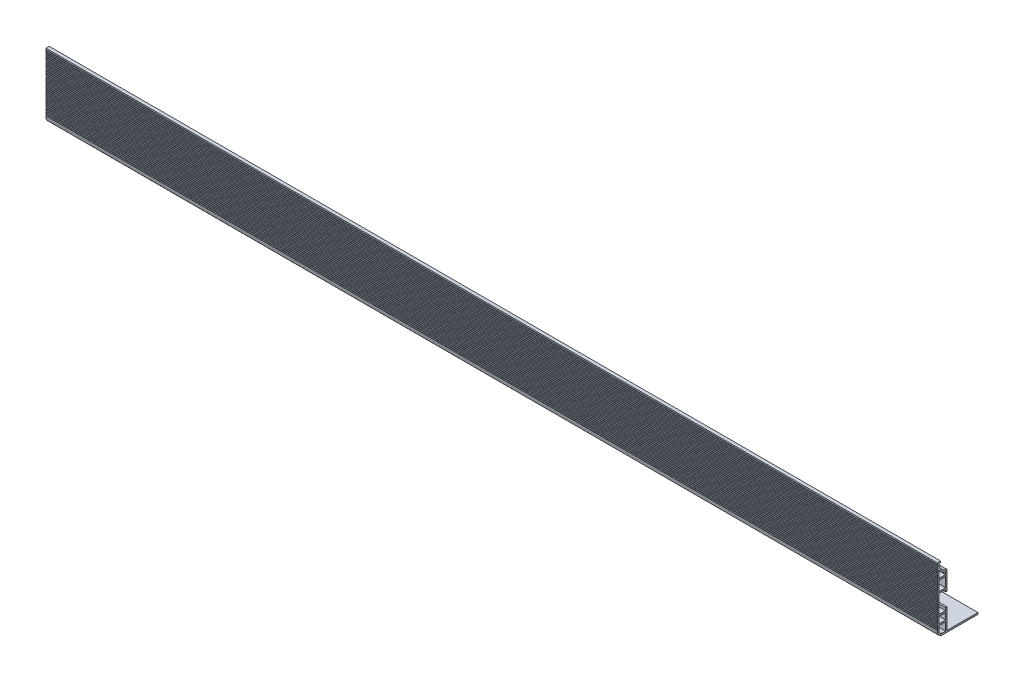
ISO-10303-21;
HEADER;
FILE_DESCRIPTION(('STEP AP214'),'2;1');
FILE_NAME('part.step','',(''),(''),'','','');
FILE_SCHEMA(('AUTOMOTIVE_DESIGN { 1 0 10303 214 1 1 1 1 }'));
ENDSEC;
DATA;
#1=APPLICATION_CONTEXT('core data for automotive mechanical design processes');
#2=APPLICATION_PROTOCOL_DEFINITION('international standard','automotive_design',2000,#1);
#3=PRODUCT_CONTEXT('',#1,'mechanical');
#4=PRODUCT('Part','Part','',(#3));
#5=PRODUCT_RELATED_PRODUCT_CATEGORY('part','',(#4));
#6=PRODUCT_DEFINITION_FORMATION('','',#4);
#7=PRODUCT_DEFINITION_CONTEXT('part definition',#1,'design');
#8=PRODUCT_DEFINITION('design','',#6,#7);
#9=PRODUCT_DEFINITION_SHAPE('','',#8);
#10=(LENGTH_UNIT() NAMED_UNIT(*) SI_UNIT(.MILLI.,.METRE.));
#11=(NAMED_UNIT(*) PLANE_ANGLE_UNIT() SI_UNIT($,.RADIAN.));
#12=(NAMED_UNIT(*) SI_UNIT($,.STERADIAN.) SOLID_ANGLE_UNIT());
#13=UNCERTAINTY_MEASURE_WITH_UNIT(LENGTH_MEASURE(1.E-05),#10,'distance_accuracy_value','');
#14=(GEOMETRIC_REPRESENTATION_CONTEXT(3) GLOBAL_UNCERTAINTY_ASSIGNED_CONTEXT((#13)) GLOBAL_UNIT_ASSIGNED_CONTEXT((#10,
#11,#12)) REPRESENTATION_CONTEXT('',''));
#15=CARTESIAN_POINT('',(0.,0.,0.));
#16=DIRECTION('',(0.,0.,1.));
#17=DIRECTION('',(1.,0.,0.));
#18=AXIS2_PLACEMENT_3D('',#15,#16,#17);
#19=CARTESIAN_POINT('',(0.,6.,0.));
#20=DIRECTION('',(0.,0.,-1.));
#21=DIRECTION('',(-1.,0.,0.));
#22=AXIS2_PLACEMENT_3D('',#19,#20,#21);
#23=PLANE('',#22);
#24=DIRECTION('',(1.,0.,0.));
#25=VECTOR('',#24,1.);
#26=CARTESIAN_POINT('',(1100.,43.7113248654,0.));
#27=LINE('',#26,#25);
#28=CARTESIAN_POINT('',(0.,43.7113248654,0.));
#29=VERTEX_POINT('',#28);
#30=CARTESIAN_POINT('',(1100.,43.7113248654,0.));
#31=VERTEX_POINT('',#30);
#32=EDGE_CURVE('E801',#29,#31,#27,.T.);
#33=ORIENTED_EDGE('',*,*,#32,.F.);
#34=DIRECTION('',(0.,1.,0.));
#35=VECTOR('',#34,1.);
#36=CARTESIAN_POINT('',(0.,0.,0.));
#37=LINE('',#36,#35);
#38=CARTESIAN_POINT('',(0.,42.2886751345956,1.09197177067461E-12));
#39=VERTEX_POINT('',#38);
#40=EDGE_CURVE('E19',#39,#29,#37,.T.);
#41=ORIENTED_EDGE('',*,*,#40,.F.);
#42=DIRECTION('',(1.,0.,0.));
#43=VECTOR('',#42,1.);
#44=CARTESIAN_POINT('',(1100.,42.2886751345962,2.18488421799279E-12));
#45=LINE('',#44,#43);
#46=CARTESIAN_POINT('',(1100.,42.2886751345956,1.09301478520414E-12));
#47=VERTEX_POINT('',#46);
#48=EDGE_CURVE('E799',#47,#39,#45,.F.);
#49=ORIENTED_EDGE('',*,*,#48,.F.);
#50=DIRECTION('',(0.,1.,0.));
#51=VECTOR('',#50,1.);
#52=CARTESIAN_POINT('',(1100.,0.,0.));
#53=LINE('',#52,#51);
#54=EDGE_CURVE('E805',#31,#47,#53,.F.);
#55=ORIENTED_EDGE('',*,*,#54,.F.);
#56=EDGE_LOOP('',(#33,#41,#49,#55));
#57=FACE_BOUND('',#56,.T.);
#58=ADVANCED_FACE('F16',(#57),#23,.F.);
#59=CARTESIAN_POINT('',(1100.,43.7113248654,0.));
#60=DIRECTION('',(0.,0.866025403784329,0.50000000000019));
#61=DIRECTION('',(0.,-0.50000000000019,0.866025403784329));
#62=AXIS2_PLACEMENT_3D('',#59,#60,#61);
#63=PLANE('',#62);
#64=DIRECTION('',(1.,0.,0.));
#65=VECTOR('',#64,1.);
#66=CARTESIAN_POINT('',(1100.,44.,-0.5));
#67=LINE('',#66,#65);
#68=CARTESIAN_POINT('',(0.,43.9999999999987,-0.500000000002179));
#69=VERTEX_POINT('',#68);
#70=CARTESIAN_POINT('',(1100.,43.9999999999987,-0.500000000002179));
#71=VERTEX_POINT('',#70);
#72=EDGE_CURVE('E820',#69,#71,#67,.T.);
#73=ORIENTED_EDGE('',*,*,#72,.F.);
#74=DIRECTION('',(0.,-0.50000000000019,0.866025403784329));
#75=VECTOR('',#74,1.);
#76=CARTESIAN_POINT('',(0.,43.7113248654,0.));
#77=LINE('',#76,#75);
#78=EDGE_CURVE('E829',#69,#29,#77,.T.);
#79=ORIENTED_EDGE('',*,*,#78,.T.);
#80=ORIENTED_EDGE('',*,*,#32,.T.);
#81=DIRECTION('',(0.,-0.50000000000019,0.866025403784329));
#82=VECTOR('',#81,1.);
#83=CARTESIAN_POINT('',(1100.,43.7113248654,0.));
#84=LINE('',#83,#82);
#85=EDGE_CURVE('E831',#31,#71,#84,.F.);
#86=ORIENTED_EDGE('',*,*,#85,.T.);
#87=EDGE_LOOP('',(#73,#79,#80,#86));
#88=FACE_BOUND('',#87,.T.);
#89=ADVANCED_FACE('F2645',(#88),#63,.T.);
#90=CARTESIAN_POINT('',(1100.,42.,-0.5));
#91=DIRECTION('',(0.,-0.866025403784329,0.50000000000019));
#92=DIRECTION('',(0.,-0.50000000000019,-0.866025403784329));
#93=AXIS2_PLACEMENT_3D('',#90,#91,#92);
#94=PLANE('',#93);
#95=ORIENTED_EDGE('',*,*,#48,.T.);
#96=DIRECTION('',(0.,-0.50000000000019,-0.866025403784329));
#97=VECTOR('',#96,1.);
#98=CARTESIAN_POINT('',(0.,42.,-0.5));
#99=LINE('',#98,#97);
#100=CARTESIAN_POINT('',(0.,41.9999999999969,-0.500000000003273));
#101=VERTEX_POINT('',#100);
#102=EDGE_CURVE('E809',#39,#101,#99,.T.);
#103=ORIENTED_EDGE('',*,*,#102,.T.);
#104=DIRECTION('',(1.,0.,0.));
#105=VECTOR('',#104,1.);
#106=CARTESIAN_POINT('',(1100.,41.9999999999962,-0.500000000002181));
#107=LINE('',#106,#105);
#108=CARTESIAN_POINT('',(1100.,41.9999999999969,-0.500000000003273));
#109=VERTEX_POINT('',#108);
#110=EDGE_CURVE('E1644',#109,#101,#107,.F.);
#111=ORIENTED_EDGE('',*,*,#110,.F.);
#112=DIRECTION('',(0.,-0.50000000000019,-0.866025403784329));
#113=VECTOR('',#112,1.);
#114=CARTESIAN_POINT('',(1100.,42.,-0.5));
#115=LINE('',#114,#113);
#116=EDGE_CURVE('E812',#109,#47,#115,.F.);
#117=ORIENTED_EDGE('',*,*,#116,.T.);
#118=EDGE_LOOP('',(#95,#103,#111,#117));
#119=FACE_BOUND('',#118,.T.);
#120=ADVANCED_FACE('F807',(#119),#94,.T.);
#121=CARTESIAN_POINT('',(1100.,44.,-0.5));
#122=DIRECTION('',(0.,-0.866025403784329,0.50000000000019));
#123=DIRECTION('',(0.,-0.50000000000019,-0.866025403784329));
#124=AXIS2_PLACEMENT_3D('',#121,#122,#123);
#125=PLANE('',#124);
#126=DIRECTION('',(-1.,0.,0.));
#127=VECTOR('',#126,1.);
#128=CARTESIAN_POINT('',(0.,44.2886751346,0.));
#129=LINE('',#128,#127);
#130=CARTESIAN_POINT('',(1100.,44.2886751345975,0.));
#131=VERTEX_POINT('',#130);
#132=CARTESIAN_POINT('',(0.,44.2886751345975,0.));
#133=VERTEX_POINT('',#132);
#134=EDGE_CURVE('E1642',#131,#133,#129,.T.);
#135=ORIENTED_EDGE('',*,*,#134,.T.);
#136=DIRECTION('',(0.,-0.50000000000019,-0.866025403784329));
#137=VECTOR('',#136,1.);
#138=CARTESIAN_POINT('',(0.,44.,-0.5));
#139=LINE('',#138,#137);
#140=EDGE_CURVE('E1646',#133,#69,#139,.T.);
#141=ORIENTED_EDGE('',*,*,#140,.T.);
#142=ORIENTED_EDGE('',*,*,#72,.T.);
#143=DIRECTION('',(0.,-0.50000000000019,-0.866025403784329));
#144=VECTOR('',#143,1.);
#145=CARTESIAN_POINT('',(1100.,44.,-0.5));
#146=LINE('',#145,#144);
#147=EDGE_CURVE('E823',#71,#131,#146,.F.);
#148=ORIENTED_EDGE('',*,*,#147,.T.);
#149=EDGE_LOOP('',(#135,#141,#142,#148));
#150=FACE_BOUND('',#149,.T.);
#151=ADVANCED_FACE('F1653',(#150),#125,.T.);
#152=CARTESIAN_POINT('',(1100.,41.7113248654,0.));
#153=DIRECTION('',(0.,0.866025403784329,0.50000000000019));
#154=DIRECTION('',(0.,-0.50000000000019,0.866025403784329));
#155=AXIS2_PLACEMENT_3D('',#152,#153,#154);
#156=PLANE('',#155);
#157=ORIENTED_EDGE('',*,*,#110,.T.);
#158=DIRECTION('',(0.,-0.50000000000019,0.866025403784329));
#159=VECTOR('',#158,1.);
#160=CARTESIAN_POINT('',(0.,41.7113248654,0.));
#161=LINE('',#160,#159);
#162=CARTESIAN_POINT('',(0.,41.7113248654,0.));
#163=VERTEX_POINT('',#162);
#164=EDGE_CURVE('E819',#101,#163,#161,.T.);
#165=ORIENTED_EDGE('',*,*,#164,.T.);
#166=DIRECTION('',(-1.,0.,0.));
#167=VECTOR('',#166,1.);
#168=CARTESIAN_POINT('',(0.,41.7113248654,0.));
#169=LINE('',#168,#167);
#170=CARTESIAN_POINT('',(1100.,41.7113248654,0.));
#171=VERTEX_POINT('',#170);
#172=EDGE_CURVE('E1634',#163,#171,#169,.F.);
#173=ORIENTED_EDGE('',*,*,#172,.T.);
#174=DIRECTION('',(0.,-0.50000000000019,0.866025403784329));
#175=VECTOR('',#174,1.);
#176=CARTESIAN_POINT('',(1100.,41.7113248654,0.));
#177=LINE('',#176,#175);
#178=EDGE_CURVE('E1645',#171,#109,#177,.F.);
#179=ORIENTED_EDGE('',*,*,#178,.T.);
#180=EDGE_LOOP('',(#157,#165,#173,#179));
#181=FACE_BOUND('',#180,.T.);
#182=ADVANCED_FACE('F1682',(#181),#156,.T.);
#183=CARTESIAN_POINT('',(0.,6.,0.));
#184=DIRECTION('',(0.,0.,-1.));
#185=DIRECTION('',(-1.,0.,0.));
#186=AXIS2_PLACEMENT_3D('',#183,#184,#185);
#187=PLANE('',#186);
#188=DIRECTION('',(1.,0.,0.));
#189=VECTOR('',#188,1.);
#190=CARTESIAN_POINT('',(1100.,45.7113248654,0.));
#191=LINE('',#190,#189);
#192=CARTESIAN_POINT('',(0.,45.7113248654,0.));
#193=VERTEX_POINT('',#192);
#194=CARTESIAN_POINT('',(1100.,45.7113248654,0.));
#195=VERTEX_POINT('',#194);
#196=EDGE_CURVE('E1630',#193,#195,#191,.T.);
#197=ORIENTED_EDGE('',*,*,#196,.F.);
#198=DIRECTION('',(0.,1.,0.));
#199=VECTOR('',#198,1.);
#200=CARTESIAN_POINT('',(0.,0.,0.));
#201=LINE('',#200,#199);
#202=EDGE_CURVE('E1640',#133,#193,#201,.T.);
#203=ORIENTED_EDGE('',*,*,#202,.F.);
#204=ORIENTED_EDGE('',*,*,#134,.F.);
#205=DIRECTION('',(0.,1.,0.));
#206=VECTOR('',#205,1.);
#207=CARTESIAN_POINT('',(1100.,0.,0.));
#208=LINE('',#207,#206);
#209=EDGE_CURVE('E1637',#195,#131,#208,.F.);
#210=ORIENTED_EDGE('',*,*,#209,.F.);
#211=EDGE_LOOP('',(#197,#203,#204,#210));
#212=FACE_BOUND('',#211,.T.);
#213=ADVANCED_FACE('F1657',(#212),#187,.F.);
#214=CARTESIAN_POINT('',(0.,6.,0.));
#215=DIRECTION('',(0.,0.,-1.));
#216=DIRECTION('',(-1.,0.,0.));
#217=AXIS2_PLACEMENT_3D('',#214,#215,#216);
#218=PLANE('',#217);
#219=ORIENTED_EDGE('',*,*,#172,.F.);
#220=DIRECTION('',(0.,1.,0.));
#221=VECTOR('',#220,1.);
#222=CARTESIAN_POINT('',(0.,0.,0.));
#223=LINE('',#222,#221);
#224=CARTESIAN_POINT('',(0.,40.2886751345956,1.0926925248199E-12));
#225=VERTEX_POINT('',#224);
#226=EDGE_CURVE('E1635',#225,#163,#223,.T.);
#227=ORIENTED_EDGE('',*,*,#226,.F.);
#228=DIRECTION('',(1.,0.,0.));
#229=VECTOR('',#228,1.);
#230=CARTESIAN_POINT('',(1100.,40.2886751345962,2.18488421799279E-12));
#231=LINE('',#230,#229);
#232=CARTESIAN_POINT('',(1100.,40.2886751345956,1.09301478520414E-12));
#233=VERTEX_POINT('',#232);
#234=EDGE_CURVE('E1622',#233,#225,#231,.F.);
#235=ORIENTED_EDGE('',*,*,#234,.F.);
#236=DIRECTION('',(0.,1.,0.));
#237=VECTOR('',#236,1.);
#238=CARTESIAN_POINT('',(1100.,0.,0.));
#239=LINE('',#238,#237);
#240=EDGE_CURVE('E1631',#171,#233,#239,.F.);
#241=ORIENTED_EDGE('',*,*,#240,.F.);
#242=EDGE_LOOP('',(#219,#227,#235,#241));
#243=FACE_BOUND('',#242,.T.);
#244=ADVANCED_FACE('F1688',(#243),#218,.F.);
#245=CARTESIAN_POINT('',(1100.,45.7113248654,0.));
#246=DIRECTION('',(0.,0.866025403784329,0.50000000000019));
#247=DIRECTION('',(0.,-0.50000000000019,0.866025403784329));
#248=AXIS2_PLACEMENT_3D('',#245,#246,#247);
#249=PLANE('',#248);
#250=DIRECTION('',(1.,0.,0.));
#251=VECTOR('',#250,1.);
#252=CARTESIAN_POINT('',(1100.,46.,-0.5));
#253=LINE('',#252,#251);
#254=CARTESIAN_POINT('',(0.,45.9999999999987,-0.500000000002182));
#255=VERTEX_POINT('',#254);
#256=CARTESIAN_POINT('',(1100.,45.9999999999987,-0.500000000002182));
#257=VERTEX_POINT('',#256);
#258=EDGE_CURVE('E1619',#255,#257,#253,.T.);
#259=ORIENTED_EDGE('',*,*,#258,.F.);
#260=DIRECTION('',(0.,-0.50000000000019,0.866025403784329));
#261=VECTOR('',#260,1.);
#262=CARTESIAN_POINT('',(0.,45.7113248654,0.));
#263=LINE('',#262,#261);
#264=EDGE_CURVE('E1625',#255,#193,#263,.T.);
#265=ORIENTED_EDGE('',*,*,#264,.T.);
#266=ORIENTED_EDGE('',*,*,#196,.T.);
#267=DIRECTION('',(0.,-0.50000000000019,0.866025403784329));
#268=VECTOR('',#267,1.);
#269=CARTESIAN_POINT('',(1100.,45.7113248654,0.));
#270=LINE('',#269,#268);
#271=EDGE_CURVE('E1628',#195,#257,#270,.F.);
#272=ORIENTED_EDGE('',*,*,#271,.T.);
#273=EDGE_LOOP('',(#259,#265,#266,#272));
#274=FACE_BOUND('',#273,.T.);
#275=ADVANCED_FACE('F1667',(#274),#249,.T.);
#276=CARTESIAN_POINT('',(1100.,40.,-0.5));
#277=DIRECTION('',(0.,-0.866025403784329,0.50000000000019));
#278=DIRECTION('',(0.,-0.50000000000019,-0.866025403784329));
#279=AXIS2_PLACEMENT_3D('',#276,#277,#278);
#280=PLANE('',#279);
#281=ORIENTED_EDGE('',*,*,#234,.T.);
#282=DIRECTION('',(0.,-0.50000000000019,-0.866025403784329));
#283=VECTOR('',#282,1.);
#284=CARTESIAN_POINT('',(0.,40.,-0.5));
#285=LINE('',#284,#283);
#286=CARTESIAN_POINT('',(0.,39.9999999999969,-0.500000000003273));
#287=VERTEX_POINT('',#286);
#288=EDGE_CURVE('E1620',#225,#287,#285,.T.);
#289=ORIENTED_EDGE('',*,*,#288,.T.);
#290=DIRECTION('',(1.,0.,0.));
#291=VECTOR('',#290,1.);
#292=CARTESIAN_POINT('',(1100.,39.9999999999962,-0.500000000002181));
#293=LINE('',#292,#291);
#294=CARTESIAN_POINT('',(1100.,39.9999999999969,-0.500000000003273));
#295=VERTEX_POINT('',#294);
#296=EDGE_CURVE('E1611',#295,#287,#293,.F.);
#297=ORIENTED_EDGE('',*,*,#296,.F.);
#298=DIRECTION('',(0.,-0.50000000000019,-0.866025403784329));
#299=VECTOR('',#298,1.);
#300=CARTESIAN_POINT('',(1100.,40.,-0.5));
#301=LINE('',#300,#299);
#302=EDGE_CURVE('E1623',#295,#233,#301,.F.);
#303=ORIENTED_EDGE('',*,*,#302,.T.);
#304=EDGE_LOOP('',(#281,#289,#297,#303));
#305=FACE_BOUND('',#304,.T.);
#306=ADVANCED_FACE('F1691',(#305),#280,.T.);
#307=CARTESIAN_POINT('',(1100.,46.,-0.5));
#308=DIRECTION('',(0.,-0.866025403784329,0.50000000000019));
#309=DIRECTION('',(0.,-0.50000000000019,-0.866025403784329));
#310=AXIS2_PLACEMENT_3D('',#307,#308,#309);
#311=PLANE('',#310);
#312=DIRECTION('',(-1.,0.,0.));
#313=VECTOR('',#312,1.);
#314=CARTESIAN_POINT('',(0.,46.2886751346,0.));
#315=LINE('',#314,#313);
#316=CARTESIAN_POINT('',(1100.,46.2886751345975,0.));
#317=VERTEX_POINT('',#316);
#318=CARTESIAN_POINT('',(0.,46.2886751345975,0.));
#319=VERTEX_POINT('',#318);
#320=EDGE_CURVE('E1608',#317,#319,#315,.T.);
#321=ORIENTED_EDGE('',*,*,#320,.T.);
#322=DIRECTION('',(0.,-0.50000000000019,-0.866025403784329));
#323=VECTOR('',#322,1.);
#324=CARTESIAN_POINT('',(0.,46.,-0.5));
#325=LINE('',#324,#323);
#326=EDGE_CURVE('E1614',#319,#255,#325,.T.);
#327=ORIENTED_EDGE('',*,*,#326,.T.);
#328=ORIENTED_EDGE('',*,*,#258,.T.);
#329=DIRECTION('',(0.,-0.50000000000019,-0.866025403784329));
#330=VECTOR('',#329,1.);
#331=CARTESIAN_POINT('',(1100.,46.,-0.5));
#332=LINE('',#331,#330);
#333=EDGE_CURVE('E1617',#257,#317,#332,.F.);
#334=ORIENTED_EDGE('',*,*,#333,.T.);
#335=EDGE_LOOP('',(#321,#327,#328,#334));
#336=FACE_BOUND('',#335,.T.);
#337=ADVANCED_FACE('F1670',(#336),#311,.T.);
#338=CARTESIAN_POINT('',(1100.,39.7113248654,0.));
#339=DIRECTION('',(0.,0.866025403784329,0.50000000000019));
#340=DIRECTION('',(0.,-0.50000000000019,0.866025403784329));
#341=AXIS2_PLACEMENT_3D('',#338,#339,#340);
#342=PLANE('',#341);
#343=ORIENTED_EDGE('',*,*,#296,.T.);
#344=DIRECTION('',(0.,-0.50000000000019,0.866025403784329));
#345=VECTOR('',#344,1.);
#346=CARTESIAN_POINT('',(0.,39.7113248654,0.));
#347=LINE('',#346,#345);
#348=CARTESIAN_POINT('',(0.,39.7113248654,0.));
#349=VERTEX_POINT('',#348);
#350=EDGE_CURVE('E1609',#287,#349,#347,.T.);
#351=ORIENTED_EDGE('',*,*,#350,.T.);
#352=DIRECTION('',(-1.,0.,0.));
#353=VECTOR('',#352,1.);
#354=CARTESIAN_POINT('',(0.,39.7113248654,0.));
#355=LINE('',#354,#353);
#356=CARTESIAN_POINT('',(1100.,39.7113248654,0.));
#357=VERTEX_POINT('',#356);
#358=EDGE_CURVE('E1599',#349,#357,#355,.F.);
#359=ORIENTED_EDGE('',*,*,#358,.T.);
#360=DIRECTION('',(0.,-0.50000000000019,0.866025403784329));
#361=VECTOR('',#360,1.);
#362=CARTESIAN_POINT('',(1100.,39.7113248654,0.));
#363=LINE('',#362,#361);
#364=EDGE_CURVE('E1612',#357,#295,#363,.F.);
#365=ORIENTED_EDGE('',*,*,#364,.T.);
#366=EDGE_LOOP('',(#343,#351,#359,#365));
#367=FACE_BOUND('',#366,.T.);
#368=ADVANCED_FACE('F1699',(#367),#342,.T.);
#369=CARTESIAN_POINT('',(0.,6.,0.));
#370=DIRECTION('',(0.,0.,-1.));
#371=DIRECTION('',(-1.,0.,0.));
#372=AXIS2_PLACEMENT_3D('',#369,#370,#371);
#373=PLANE('',#372);
#374=DIRECTION('',(1.,0.,0.));
#375=VECTOR('',#374,1.);
#376=CARTESIAN_POINT('',(1100.,47.7113248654,0.));
#377=LINE('',#376,#375);
#378=CARTESIAN_POINT('',(0.,47.7113248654,0.));
#379=VERTEX_POINT('',#378);
#380=CARTESIAN_POINT('',(1100.,47.7113248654,0.));
#381=VERTEX_POINT('',#380);
#382=EDGE_CURVE('E1595',#379,#381,#377,.T.);
#383=ORIENTED_EDGE('',*,*,#382,.F.);
#384=DIRECTION('',(0.,1.,0.));
#385=VECTOR('',#384,1.);
#386=CARTESIAN_POINT('',(0.,0.,0.));
#387=LINE('',#386,#385);
#388=EDGE_CURVE('E1606',#319,#379,#387,.T.);
#389=ORIENTED_EDGE('',*,*,#388,.F.);
#390=ORIENTED_EDGE('',*,*,#320,.F.);
#391=DIRECTION('',(0.,1.,0.));
#392=VECTOR('',#391,1.);
#393=CARTESIAN_POINT('',(1100.,0.,0.));
#394=LINE('',#393,#392);
#395=EDGE_CURVE('E1603',#381,#317,#394,.F.);
#396=ORIENTED_EDGE('',*,*,#395,.F.);
#397=EDGE_LOOP('',(#383,#389,#390,#396));
#398=FACE_BOUND('',#397,.T.);
#399=ADVANCED_FACE('F1711',(#398),#373,.F.);
#400=CARTESIAN_POINT('',(0.,6.,0.));
#401=DIRECTION('',(0.,0.,-1.));
#402=DIRECTION('',(-1.,0.,0.));
#403=AXIS2_PLACEMENT_3D('',#400,#401,#402);
#404=PLANE('',#403);
#405=ORIENTED_EDGE('',*,*,#358,.F.);
#406=DIRECTION('',(0.,1.,0.));
#407=VECTOR('',#406,1.);
#408=CARTESIAN_POINT('',(0.,0.,0.));
#409=LINE('',#408,#407);
#410=CARTESIAN_POINT('',(0.,38.2886751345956,1.09268144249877E-12));
#411=VERTEX_POINT('',#410);
#412=EDGE_CURVE('E1600',#411,#349,#409,.T.);
#413=ORIENTED_EDGE('',*,*,#412,.F.);
#414=DIRECTION('',(1.,0.,0.));
#415=VECTOR('',#414,1.);
#416=CARTESIAN_POINT('',(1100.,38.2886751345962,2.18488421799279E-12));
#417=LINE('',#416,#415);
#418=CARTESIAN_POINT('',(1100.,38.2886751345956,1.09301478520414E-12));
#419=VERTEX_POINT('',#418);
#420=EDGE_CURVE('E1587',#419,#411,#417,.F.);
#421=ORIENTED_EDGE('',*,*,#420,.F.);
#422=DIRECTION('',(0.,1.,0.));
#423=VECTOR('',#422,1.);
#424=CARTESIAN_POINT('',(1100.,0.,0.));
#425=LINE('',#424,#423);
#426=EDGE_CURVE('E1596',#357,#419,#425,.F.);
#427=ORIENTED_EDGE('',*,*,#426,.F.);
#428=EDGE_LOOP('',(#405,#413,#421,#427));
#429=FACE_BOUND('',#428,.T.);
#430=ADVANCED_FACE('F1702',(#429),#404,.F.);
#431=CARTESIAN_POINT('',(1100.,47.7113248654,0.));
#432=DIRECTION('',(0.,0.866025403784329,0.50000000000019));
#433=DIRECTION('',(0.,-0.50000000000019,0.866025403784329));
#434=AXIS2_PLACEMENT_3D('',#431,#432,#433);
#435=PLANE('',#434);
#436=DIRECTION('',(1.,0.,0.));
#437=VECTOR('',#436,1.);
#438=CARTESIAN_POINT('',(1100.,48.,-0.5));
#439=LINE('',#438,#437);
#440=CARTESIAN_POINT('',(0.,47.9999999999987,-0.500000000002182));
#441=VERTEX_POINT('',#440);
#442=CARTESIAN_POINT('',(1100.,47.9999999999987,-0.500000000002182));
#443=VERTEX_POINT('',#442);
#444=EDGE_CURVE('E1584',#441,#443,#439,.T.);
#445=ORIENTED_EDGE('',*,*,#444,.F.);
#446=DIRECTION('',(0.,-0.50000000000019,0.866025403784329));
#447=VECTOR('',#446,1.);
#448=CARTESIAN_POINT('',(0.,47.7113248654,0.));
#449=LINE('',#448,#447);
#450=EDGE_CURVE('E1590',#441,#379,#449,.T.);
#451=ORIENTED_EDGE('',*,*,#450,.T.);
#452=ORIENTED_EDGE('',*,*,#382,.T.);
#453=DIRECTION('',(0.,-0.50000000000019,0.866025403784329));
#454=VECTOR('',#453,1.);
#455=CARTESIAN_POINT('',(1100.,47.7113248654,0.));
#456=LINE('',#455,#454);
#457=EDGE_CURVE('E1593',#381,#443,#456,.F.);
#458=ORIENTED_EDGE('',*,*,#457,.T.);
#459=EDGE_LOOP('',(#445,#451,#452,#458));
#460=FACE_BOUND('',#459,.T.);
#461=ADVANCED_FACE('F1718',(#460),#435,.T.);
#462=CARTESIAN_POINT('',(1100.,38.,-0.5));
#463=DIRECTION('',(0.,-0.866025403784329,0.50000000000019));
#464=DIRECTION('',(0.,-0.50000000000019,-0.866025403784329));
#465=AXIS2_PLACEMENT_3D('',#462,#463,#464);
#466=PLANE('',#465);
#467=ORIENTED_EDGE('',*,*,#420,.T.);
#468=DIRECTION('',(0.,-0.50000000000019,-0.866025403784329));
#469=VECTOR('',#468,1.);
#470=CARTESIAN_POINT('',(0.,38.,-0.5));
#471=LINE('',#470,#469);
#472=CARTESIAN_POINT('',(0.,37.9999999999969,-0.500000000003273));
#473=VERTEX_POINT('',#472);
#474=EDGE_CURVE('E1585',#411,#473,#471,.T.);
#475=ORIENTED_EDGE('',*,*,#474,.T.);
#476=DIRECTION('',(1.,0.,0.));
#477=VECTOR('',#476,1.);
#478=CARTESIAN_POINT('',(1100.,37.9999999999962,-0.500000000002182));
#479=LINE('',#478,#477);
#480=CARTESIAN_POINT('',(1100.,37.9999999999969,-0.500000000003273));
#481=VERTEX_POINT('',#480);
#482=EDGE_CURVE('E1576',#481,#473,#479,.F.);
#483=ORIENTED_EDGE('',*,*,#482,.F.);
#484=DIRECTION('',(0.,-0.50000000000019,-0.866025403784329));
#485=VECTOR('',#484,1.);
#486=CARTESIAN_POINT('',(1100.,38.,-0.5));
#487=LINE('',#486,#485);
#488=EDGE_CURVE('E1588',#481,#419,#487,.F.);
#489=ORIENTED_EDGE('',*,*,#488,.T.);
#490=EDGE_LOOP('',(#467,#475,#483,#489));
#491=FACE_BOUND('',#490,.T.);
#492=ADVANCED_FACE('F1727',(#491),#466,.T.);
#493=CARTESIAN_POINT('',(1100.,48.,-0.5));
#494=DIRECTION('',(0.,-0.866025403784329,0.50000000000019));
#495=DIRECTION('',(0.,-0.50000000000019,-0.866025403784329));
#496=AXIS2_PLACEMENT_3D('',#493,#494,#495);
#497=PLANE('',#496);
#498=DIRECTION('',(-1.,0.,0.));
#499=VECTOR('',#498,1.);
#500=CARTESIAN_POINT('',(0.,48.2886751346,0.));
#501=LINE('',#500,#499);
#502=CARTESIAN_POINT('',(1100.,48.2886751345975,0.));
#503=VERTEX_POINT('',#502);
#504=CARTESIAN_POINT('',(0.,48.2886751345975,0.));
#505=VERTEX_POINT('',#504);
#506=EDGE_CURVE('E1573',#503,#505,#501,.T.);
#507=ORIENTED_EDGE('',*,*,#506,.T.);
#508=DIRECTION('',(0.,-0.50000000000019,-0.866025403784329));
#509=VECTOR('',#508,1.);
#510=CARTESIAN_POINT('',(0.,48.,-0.5));
#511=LINE('',#510,#509);
#512=EDGE_CURVE('E1579',#505,#441,#511,.T.);
#513=ORIENTED_EDGE('',*,*,#512,.T.);
#514=ORIENTED_EDGE('',*,*,#444,.T.);
#515=DIRECTION('',(0.,-0.50000000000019,-0.866025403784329));
#516=VECTOR('',#515,1.);
#517=CARTESIAN_POINT('',(1100.,48.,-0.5));
#518=LINE('',#517,#516);
#519=EDGE_CURVE('E1582',#443,#503,#518,.F.);
#520=ORIENTED_EDGE('',*,*,#519,.T.);
#521=EDGE_LOOP('',(#507,#513,#514,#520));
#522=FACE_BOUND('',#521,.T.);
#523=ADVANCED_FACE('F1721',(#522),#497,.T.);
#524=CARTESIAN_POINT('',(1100.,37.7113248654,0.));
#525=DIRECTION('',(0.,0.866025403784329,0.50000000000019));
#526=DIRECTION('',(0.,-0.50000000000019,0.866025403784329));
#527=AXIS2_PLACEMENT_3D('',#524,#525,#526);
#528=PLANE('',#527);
#529=ORIENTED_EDGE('',*,*,#482,.T.);
#530=DIRECTION('',(0.,-0.50000000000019,0.866025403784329));
#531=VECTOR('',#530,1.);
#532=CARTESIAN_POINT('',(0.,37.7113248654,0.));
#533=LINE('',#532,#531);
#534=CARTESIAN_POINT('',(0.,37.7113248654,0.));
#535=VERTEX_POINT('',#534);
#536=EDGE_CURVE('E1574',#473,#535,#533,.T.);
#537=ORIENTED_EDGE('',*,*,#536,.T.);
#538=DIRECTION('',(-1.,0.,0.));
#539=VECTOR('',#538,1.);
#540=CARTESIAN_POINT('',(0.,37.7113248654,0.));
#541=LINE('',#540,#539);
#542=CARTESIAN_POINT('',(1100.,37.7113248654,0.));
#543=VERTEX_POINT('',#542);
#544=EDGE_CURVE('E1564',#535,#543,#541,.F.);
#545=ORIENTED_EDGE('',*,*,#544,.T.);
#546=DIRECTION('',(0.,-0.50000000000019,0.866025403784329));
#547=VECTOR('',#546,1.);
#548=CARTESIAN_POINT('',(1100.,37.7113248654,0.));
#549=LINE('',#548,#547);
#550=EDGE_CURVE('E1577',#543,#481,#549,.F.);
#551=ORIENTED_EDGE('',*,*,#550,.T.);
#552=EDGE_LOOP('',(#529,#537,#545,#551));
#553=FACE_BOUND('',#552,.T.);
#554=ADVANCED_FACE('F1736',(#553),#528,.T.);
#555=CARTESIAN_POINT('',(0.,6.,0.));
#556=DIRECTION('',(0.,0.,-1.));
#557=DIRECTION('',(-1.,0.,0.));
#558=AXIS2_PLACEMENT_3D('',#555,#556,#557);
#559=PLANE('',#558);
#560=DIRECTION('',(1.,0.,0.));
#561=VECTOR('',#560,1.);
#562=CARTESIAN_POINT('',(1100.,49.7113248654,0.));
#563=LINE('',#562,#561);
#564=CARTESIAN_POINT('',(0.,49.7113248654,0.));
#565=VERTEX_POINT('',#564);
#566=CARTESIAN_POINT('',(1100.,49.7113248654,0.));
#567=VERTEX_POINT('',#566);
#568=EDGE_CURVE('E1560',#565,#567,#563,.T.);
#569=ORIENTED_EDGE('',*,*,#568,.F.);
#570=DIRECTION('',(0.,1.,0.));
#571=VECTOR('',#570,1.);
#572=CARTESIAN_POINT('',(0.,0.,0.));
#573=LINE('',#572,#571);
#574=EDGE_CURVE('E1571',#505,#565,#573,.T.);
#575=ORIENTED_EDGE('',*,*,#574,.F.);
#576=ORIENTED_EDGE('',*,*,#506,.F.);
#577=DIRECTION('',(0.,1.,0.));
#578=VECTOR('',#577,1.);
#579=CARTESIAN_POINT('',(1100.,0.,0.));
#580=LINE('',#579,#578);
#581=EDGE_CURVE('E1568',#567,#503,#580,.F.);
#582=ORIENTED_EDGE('',*,*,#581,.F.);
#583=EDGE_LOOP('',(#569,#575,#576,#582));
#584=FACE_BOUND('',#583,.T.);
#585=ADVANCED_FACE('F1748',(#584),#559,.F.);
#586=CARTESIAN_POINT('',(0.,6.,0.));
#587=DIRECTION('',(0.,0.,-1.));
#588=DIRECTION('',(-1.,0.,0.));
#589=AXIS2_PLACEMENT_3D('',#586,#587,#588);
#590=PLANE('',#589);
#591=ORIENTED_EDGE('',*,*,#544,.F.);
#592=DIRECTION('',(0.,1.,0.));
#593=VECTOR('',#592,1.);
#594=CARTESIAN_POINT('',(0.,0.,0.));
#595=LINE('',#594,#593);
#596=CARTESIAN_POINT('',(0.,36.2886751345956,1.09090853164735E-12));
#597=VERTEX_POINT('',#596);
#598=EDGE_CURVE('E1565',#597,#535,#595,.T.);
#599=ORIENTED_EDGE('',*,*,#598,.F.);
#600=DIRECTION('',(1.,0.,0.));
#601=VECTOR('',#600,1.);
#602=CARTESIAN_POINT('',(1100.,36.2886751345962,2.18260739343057E-12));
#603=LINE('',#602,#601);
#604=CARTESIAN_POINT('',(1100.,36.2886751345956,1.09201189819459E-12));
#605=VERTEX_POINT('',#604);
#606=EDGE_CURVE('E1552',#605,#597,#603,.F.);
#607=ORIENTED_EDGE('',*,*,#606,.F.);
#608=DIRECTION('',(0.,1.,0.));
#609=VECTOR('',#608,1.);
#610=CARTESIAN_POINT('',(1100.,0.,0.));
#611=LINE('',#610,#609);
#612=EDGE_CURVE('E1561',#543,#605,#611,.F.);
#613=ORIENTED_EDGE('',*,*,#612,.F.);
#614=EDGE_LOOP('',(#591,#599,#607,#613));
#615=FACE_BOUND('',#614,.T.);
#616=ADVANCED_FACE('F1739',(#615),#590,.F.);
#617=CARTESIAN_POINT('',(1100.,49.7113248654,0.));
#618=DIRECTION('',(0.,0.866025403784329,0.50000000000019));
#619=DIRECTION('',(0.,-0.50000000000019,0.866025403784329));
#620=AXIS2_PLACEMENT_3D('',#617,#618,#619);
#621=PLANE('',#620);
#622=DIRECTION('',(1.,0.,0.));
#623=VECTOR('',#622,1.);
#624=CARTESIAN_POINT('',(1100.,50.,-0.5));
#625=LINE('',#624,#623);
#626=CARTESIAN_POINT('',(0.,49.9999999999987,-0.500000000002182));
#627=VERTEX_POINT('',#626);
#628=CARTESIAN_POINT('',(1100.,49.9999999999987,-0.500000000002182));
#629=VERTEX_POINT('',#628);
#630=EDGE_CURVE('E1549',#627,#629,#625,.T.);
#631=ORIENTED_EDGE('',*,*,#630,.F.);
#632=DIRECTION('',(0.,-0.50000000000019,0.866025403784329));
#633=VECTOR('',#632,1.);
#634=CARTESIAN_POINT('',(0.,49.7113248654,0.));
#635=LINE('',#634,#633);
#636=EDGE_CURVE('E1555',#627,#565,#635,.T.);
#637=ORIENTED_EDGE('',*,*,#636,.T.);
#638=ORIENTED_EDGE('',*,*,#568,.T.);
#639=DIRECTION('',(0.,-0.50000000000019,0.866025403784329));
#640=VECTOR('',#639,1.);
#641=CARTESIAN_POINT('',(1100.,49.7113248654,0.));
#642=LINE('',#641,#640);
#643=EDGE_CURVE('E1558',#567,#629,#642,.F.);
#644=ORIENTED_EDGE('',*,*,#643,.T.);
#645=EDGE_LOOP('',(#631,#637,#638,#644));
#646=FACE_BOUND('',#645,.T.);
#647=ADVANCED_FACE('F1755',(#646),#621,.T.);
#648=CARTESIAN_POINT('',(1100.,36.,-0.5));
#649=DIRECTION('',(0.,-0.866025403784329,0.50000000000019));
#650=DIRECTION('',(0.,-0.50000000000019,-0.866025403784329));
#651=AXIS2_PLACEMENT_3D('',#648,#649,#650);
#652=PLANE('',#651);
#653=ORIENTED_EDGE('',*,*,#606,.T.);
#654=DIRECTION('',(0.,-0.50000000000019,-0.866025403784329));
#655=VECTOR('',#654,1.);
#656=CARTESIAN_POINT('',(0.,36.,-0.5));
#657=LINE('',#656,#655);
#658=CARTESIAN_POINT('',(0.,35.9999999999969,-0.500000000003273));
#659=VERTEX_POINT('',#658);
#660=EDGE_CURVE('E1550',#597,#659,#657,.T.);
#661=ORIENTED_EDGE('',*,*,#660,.T.);
#662=DIRECTION('',(1.,0.,0.));
#663=VECTOR('',#662,1.);
#664=CARTESIAN_POINT('',(1100.,35.9999999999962,-0.500000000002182));
#665=LINE('',#664,#663);
#666=CARTESIAN_POINT('',(1100.,35.9999999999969,-0.500000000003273));
#667=VERTEX_POINT('',#666);
#668=EDGE_CURVE('E1541',#667,#659,#665,.F.);
#669=ORIENTED_EDGE('',*,*,#668,.F.);
#670=DIRECTION('',(0.,-0.50000000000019,-0.866025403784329));
#671=VECTOR('',#670,1.);
#672=CARTESIAN_POINT('',(1100.,36.,-0.5));
#673=LINE('',#672,#671);
#674=EDGE_CURVE('E1553',#667,#605,#673,.F.);
#675=ORIENTED_EDGE('',*,*,#674,.T.);
#676=EDGE_LOOP('',(#653,#661,#669,#675));
#677=FACE_BOUND('',#676,.T.);
#678=ADVANCED_FACE('F1764',(#677),#652,.T.);
#679=CARTESIAN_POINT('',(1100.,50.,-0.5));
#680=DIRECTION('',(0.,-0.866025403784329,0.50000000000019));
#681=DIRECTION('',(0.,-0.50000000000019,-0.866025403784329));
#682=AXIS2_PLACEMENT_3D('',#679,#680,#681);
#683=PLANE('',#682);
#684=DIRECTION('',(-1.,0.,0.));
#685=VECTOR('',#684,1.);
#686=CARTESIAN_POINT('',(0.,50.2886751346,0.));
#687=LINE('',#686,#685);
#688=CARTESIAN_POINT('',(1100.,50.2886751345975,0.));
#689=VERTEX_POINT('',#688);
#690=CARTESIAN_POINT('',(0.,50.2886751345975,0.));
#691=VERTEX_POINT('',#690);
#692=EDGE_CURVE('E1538',#689,#691,#687,.T.);
#693=ORIENTED_EDGE('',*,*,#692,.T.);
#694=DIRECTION('',(0.,-0.50000000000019,-0.866025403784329));
#695=VECTOR('',#694,1.);
#696=CARTESIAN_POINT('',(0.,50.,-0.5));
#697=LINE('',#696,#695);
#698=EDGE_CURVE('E1544',#691,#627,#697,.T.);
#699=ORIENTED_EDGE('',*,*,#698,.T.);
#700=ORIENTED_EDGE('',*,*,#630,.T.);
#701=DIRECTION('',(0.,-0.50000000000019,-0.866025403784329));
#702=VECTOR('',#701,1.);
#703=CARTESIAN_POINT('',(1100.,50.,-0.5));
#704=LINE('',#703,#702);
#705=EDGE_CURVE('E1547',#629,#689,#704,.F.);
#706=ORIENTED_EDGE('',*,*,#705,.T.);
#707=EDGE_LOOP('',(#693,#699,#700,#706));
#708=FACE_BOUND('',#707,.T.);
#709=ADVANCED_FACE('F1758',(#708),#683,.T.);
#710=CARTESIAN_POINT('',(1100.,35.7113248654,0.));
#711=DIRECTION('',(0.,0.866025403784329,0.50000000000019));
#712=DIRECTION('',(0.,-0.50000000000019,0.866025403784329));
#713=AXIS2_PLACEMENT_3D('',#710,#711,#712);
#714=PLANE('',#713);
#715=ORIENTED_EDGE('',*,*,#668,.T.);
#716=DIRECTION('',(0.,-0.50000000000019,0.866025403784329));
#717=VECTOR('',#716,1.);
#718=CARTESIAN_POINT('',(0.,35.7113248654,0.));
#719=LINE('',#718,#717);
#720=CARTESIAN_POINT('',(0.,35.7113248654,0.));
#721=VERTEX_POINT('',#720);
#722=EDGE_CURVE('E1539',#659,#721,#719,.T.);
#723=ORIENTED_EDGE('',*,*,#722,.T.);
#724=DIRECTION('',(-1.,0.,0.));
#725=VECTOR('',#724,1.);
#726=CARTESIAN_POINT('',(0.,35.7113248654,0.));
#727=LINE('',#726,#725);
#728=CARTESIAN_POINT('',(1100.,35.7113248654,0.));
#729=VERTEX_POINT('',#728);
#730=EDGE_CURVE('E1529',#721,#729,#727,.F.);
#731=ORIENTED_EDGE('',*,*,#730,.T.);
#732=DIRECTION('',(0.,-0.50000000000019,0.866025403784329));
#733=VECTOR('',#732,1.);
#734=CARTESIAN_POINT('',(1100.,35.7113248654,0.));
#735=LINE('',#734,#733);
#736=EDGE_CURVE('E1542',#729,#667,#735,.F.);
#737=ORIENTED_EDGE('',*,*,#736,.T.);
#738=EDGE_LOOP('',(#715,#723,#731,#737));
#739=FACE_BOUND('',#738,.T.);
#740=ADVANCED_FACE('F1773',(#739),#714,.T.);
#741=CARTESIAN_POINT('',(0.,6.,0.));
#742=DIRECTION('',(0.,0.,-1.));
#743=DIRECTION('',(-1.,0.,0.));
#744=AXIS2_PLACEMENT_3D('',#741,#742,#743);
#745=PLANE('',#744);
#746=DIRECTION('',(1.,0.,0.));
#747=VECTOR('',#746,1.);
#748=CARTESIAN_POINT('',(1100.,51.7113248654,0.));
#749=LINE('',#748,#747);
#750=CARTESIAN_POINT('',(0.,51.7113248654,0.));
#751=VERTEX_POINT('',#750);
#752=CARTESIAN_POINT('',(1100.,51.7113248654,0.));
#753=VERTEX_POINT('',#752);
#754=EDGE_CURVE('E1525',#751,#753,#749,.T.);
#755=ORIENTED_EDGE('',*,*,#754,.F.);
#756=DIRECTION('',(0.,1.,0.));
#757=VECTOR('',#756,1.);
#758=CARTESIAN_POINT('',(0.,0.,0.));
#759=LINE('',#758,#757);
#760=EDGE_CURVE('E1536',#691,#751,#759,.T.);
#761=ORIENTED_EDGE('',*,*,#760,.F.);
#762=ORIENTED_EDGE('',*,*,#692,.F.);
#763=DIRECTION('',(0.,1.,0.));
#764=VECTOR('',#763,1.);
#765=CARTESIAN_POINT('',(1100.,0.,0.));
#766=LINE('',#765,#764);
#767=EDGE_CURVE('E1533',#753,#689,#766,.F.);
#768=ORIENTED_EDGE('',*,*,#767,.F.);
#769=EDGE_LOOP('',(#755,#761,#762,#768));
#770=FACE_BOUND('',#769,.T.);
#771=ADVANCED_FACE('F1785',(#770),#745,.F.);
#772=CARTESIAN_POINT('',(0.,6.,0.));
#773=DIRECTION('',(0.,0.,-1.));
#774=DIRECTION('',(-1.,0.,0.));
#775=AXIS2_PLACEMENT_3D('',#772,#773,#774);
#776=PLANE('',#775);
#777=ORIENTED_EDGE('',*,*,#730,.F.);
#778=DIRECTION('',(0.,1.,0.));
#779=VECTOR('',#778,1.);
#780=CARTESIAN_POINT('',(0.,0.,0.));
#781=LINE('',#780,#779);
#782=CARTESIAN_POINT('',(0.,34.2886751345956,1.09265927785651E-12));
#783=VERTEX_POINT('',#782);
#784=EDGE_CURVE('E1530',#783,#721,#781,.T.);
#785=ORIENTED_EDGE('',*,*,#784,.F.);
#786=DIRECTION('',(1.,0.,0.));
#787=VECTOR('',#786,1.);
#788=CARTESIAN_POINT('',(1100.,34.2886751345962,2.18488421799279E-12));
#789=LINE('',#788,#787);
#790=CARTESIAN_POINT('',(1100.,34.2886751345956,1.09301478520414E-12));
#791=VERTEX_POINT('',#790);
#792=EDGE_CURVE('E1517',#791,#783,#789,.F.);
#793=ORIENTED_EDGE('',*,*,#792,.F.);
#794=DIRECTION('',(0.,1.,0.));
#795=VECTOR('',#794,1.);
#796=CARTESIAN_POINT('',(1100.,0.,0.));
#797=LINE('',#796,#795);
#798=EDGE_CURVE('E1526',#729,#791,#797,.F.);
#799=ORIENTED_EDGE('',*,*,#798,.F.);
#800=EDGE_LOOP('',(#777,#785,#793,#799));
#801=FACE_BOUND('',#800,.T.);
#802=ADVANCED_FACE('F1776',(#801),#776,.F.);
#803=CARTESIAN_POINT('',(1100.,51.7113248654,0.));
#804=DIRECTION('',(0.,0.866025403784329,0.50000000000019));
#805=DIRECTION('',(0.,-0.50000000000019,0.866025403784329));
#806=AXIS2_PLACEMENT_3D('',#803,#804,#805);
#807=PLANE('',#806);
#808=DIRECTION('',(1.,0.,0.));
#809=VECTOR('',#808,1.);
#810=CARTESIAN_POINT('',(1100.,52.,-0.5));
#811=LINE('',#810,#809);
#812=CARTESIAN_POINT('',(0.,51.9999999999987,-0.500000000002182));
#813=VERTEX_POINT('',#812);
#814=CARTESIAN_POINT('',(1100.,51.9999999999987,-0.500000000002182));
#815=VERTEX_POINT('',#814);
#816=EDGE_CURVE('E1514',#813,#815,#811,.T.);
#817=ORIENTED_EDGE('',*,*,#816,.F.);
#818=DIRECTION('',(0.,-0.50000000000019,0.866025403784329));
#819=VECTOR('',#818,1.);
#820=CARTESIAN_POINT('',(0.,51.7113248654,0.));
#821=LINE('',#820,#819);
#822=EDGE_CURVE('E1520',#813,#751,#821,.T.);
#823=ORIENTED_EDGE('',*,*,#822,.T.);
#824=ORIENTED_EDGE('',*,*,#754,.T.);
#825=DIRECTION('',(0.,-0.50000000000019,0.866025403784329));
#826=VECTOR('',#825,1.);
#827=CARTESIAN_POINT('',(1100.,51.7113248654,0.));
#828=LINE('',#827,#826);
#829=EDGE_CURVE('E1523',#753,#815,#828,.F.);
#830=ORIENTED_EDGE('',*,*,#829,.T.);
#831=EDGE_LOOP('',(#817,#823,#824,#830));
#832=FACE_BOUND('',#831,.T.);
#833=ADVANCED_FACE('F1792',(#832),#807,.T.);
#834=CARTESIAN_POINT('',(1100.,34.,-0.5));
#835=DIRECTION('',(0.,-0.866025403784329,0.50000000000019));
#836=DIRECTION('',(0.,-0.50000000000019,-0.866025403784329));
#837=AXIS2_PLACEMENT_3D('',#834,#835,#836);
#838=PLANE('',#837);
#839=ORIENTED_EDGE('',*,*,#792,.T.);
#840=DIRECTION('',(0.,-0.50000000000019,-0.866025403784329));
#841=VECTOR('',#840,1.);
#842=CARTESIAN_POINT('',(0.,34.,-0.5));
#843=LINE('',#842,#841);
#844=CARTESIAN_POINT('',(0.,33.9999999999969,-0.500000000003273));
#845=VERTEX_POINT('',#844);
#846=EDGE_CURVE('E1515',#783,#845,#843,.T.);
#847=ORIENTED_EDGE('',*,*,#846,.T.);
#848=DIRECTION('',(1.,0.,0.));
#849=VECTOR('',#848,1.);
#850=CARTESIAN_POINT('',(1100.,33.9999999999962,-0.500000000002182));
#851=LINE('',#850,#849);
#852=CARTESIAN_POINT('',(1100.,33.9999999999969,-0.500000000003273));
#853=VERTEX_POINT('',#852);
#854=EDGE_CURVE('E1506',#853,#845,#851,.F.);
#855=ORIENTED_EDGE('',*,*,#854,.F.);
#856=DIRECTION('',(0.,-0.50000000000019,-0.866025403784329));
#857=VECTOR('',#856,1.);
#858=CARTESIAN_POINT('',(1100.,34.,-0.5));
#859=LINE('',#858,#857);
#860=EDGE_CURVE('E1518',#853,#791,#859,.F.);
#861=ORIENTED_EDGE('',*,*,#860,.T.);
#862=EDGE_LOOP('',(#839,#847,#855,#861));
#863=FACE_BOUND('',#862,.T.);
#864=ADVANCED_FACE('F1801',(#863),#838,.T.);
#865=CARTESIAN_POINT('',(1100.,52.,-0.5));
#866=DIRECTION('',(0.,-0.866025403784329,0.50000000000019));
#867=DIRECTION('',(0.,-0.50000000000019,-0.866025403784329));
#868=AXIS2_PLACEMENT_3D('',#865,#866,#867);
#869=PLANE('',#868);
#870=DIRECTION('',(-1.,0.,0.));
#871=VECTOR('',#870,1.);
#872=CARTESIAN_POINT('',(0.,52.2886751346,0.));
#873=LINE('',#872,#871);
#874=CARTESIAN_POINT('',(1100.,52.2886751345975,0.));
#875=VERTEX_POINT('',#874);
#876=CARTESIAN_POINT('',(0.,52.2886751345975,0.));
#877=VERTEX_POINT('',#876);
#878=EDGE_CURVE('E1503',#875,#877,#873,.T.);
#879=ORIENTED_EDGE('',*,*,#878,.T.);
#880=DIRECTION('',(0.,-0.50000000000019,-0.866025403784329));
#881=VECTOR('',#880,1.);
#882=CARTESIAN_POINT('',(0.,52.,-0.5));
#883=LINE('',#882,#881);
#884=EDGE_CURVE('E1509',#877,#813,#883,.T.);
#885=ORIENTED_EDGE('',*,*,#884,.T.);
#886=ORIENTED_EDGE('',*,*,#816,.T.);
#887=DIRECTION('',(0.,-0.50000000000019,-0.866025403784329));
#888=VECTOR('',#887,1.);
#889=CARTESIAN_POINT('',(1100.,52.,-0.5));
#890=LINE('',#889,#888);
#891=EDGE_CURVE('E1512',#815,#875,#890,.F.);
#892=ORIENTED_EDGE('',*,*,#891,.T.);
#893=EDGE_LOOP('',(#879,#885,#886,#892));
#894=FACE_BOUND('',#893,.T.);
#895=ADVANCED_FACE('F1795',(#894),#869,.T.);
#896=CARTESIAN_POINT('',(1100.,33.7113248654,0.));
#897=DIRECTION('',(0.,0.866025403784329,0.50000000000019));
#898=DIRECTION('',(0.,-0.50000000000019,0.866025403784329));
#899=AXIS2_PLACEMENT_3D('',#896,#897,#898);
#900=PLANE('',#899);
#901=ORIENTED_EDGE('',*,*,#854,.T.);
#902=DIRECTION('',(0.,-0.50000000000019,0.866025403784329));
#903=VECTOR('',#902,1.);
#904=CARTESIAN_POINT('',(0.,33.7113248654,0.));
#905=LINE('',#904,#903);
#906=CARTESIAN_POINT('',(0.,33.7113248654,0.));
#907=VERTEX_POINT('',#906);
#908=EDGE_CURVE('E1504',#845,#907,#905,.T.);
#909=ORIENTED_EDGE('',*,*,#908,.T.);
#910=DIRECTION('',(-1.,0.,0.));
#911=VECTOR('',#910,1.);
#912=CARTESIAN_POINT('',(0.,33.7113248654,0.));
#913=LINE('',#912,#911);
#914=CARTESIAN_POINT('',(1100.,33.7113248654,0.));
#915=VERTEX_POINT('',#914);
#916=EDGE_CURVE('E1494',#907,#915,#913,.F.);
#917=ORIENTED_EDGE('',*,*,#916,.T.);
#918=DIRECTION('',(0.,-0.50000000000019,0.866025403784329));
#919=VECTOR('',#918,1.);
#920=CARTESIAN_POINT('',(1100.,33.7113248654,0.));
#921=LINE('',#920,#919);
#922=EDGE_CURVE('E1507',#915,#853,#921,.F.);
#923=ORIENTED_EDGE('',*,*,#922,.T.);
#924=EDGE_LOOP('',(#901,#909,#917,#923));
#925=FACE_BOUND('',#924,.T.);
#926=ADVANCED_FACE('F1810',(#925),#900,.T.);
#927=CARTESIAN_POINT('',(0.,6.,0.));
#928=DIRECTION('',(0.,0.,-1.));
#929=DIRECTION('',(-1.,0.,0.));
#930=AXIS2_PLACEMENT_3D('',#927,#928,#929);
#931=PLANE('',#930);
#932=DIRECTION('',(1.,0.,0.));
#933=VECTOR('',#932,1.);
#934=CARTESIAN_POINT('',(1100.,53.7113248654,0.));
#935=LINE('',#934,#933);
#936=CARTESIAN_POINT('',(0.,53.7113248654,0.));
#937=VERTEX_POINT('',#936);
#938=CARTESIAN_POINT('',(1100.,53.7113248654,0.));
#939=VERTEX_POINT('',#938);
#940=EDGE_CURVE('E1490',#937,#939,#935,.T.);
#941=ORIENTED_EDGE('',*,*,#940,.F.);
#942=DIRECTION('',(0.,1.,0.));
#943=VECTOR('',#942,1.);
#944=CARTESIAN_POINT('',(0.,0.,0.));
#945=LINE('',#944,#943);
#946=EDGE_CURVE('E1501',#877,#937,#945,.T.);
#947=ORIENTED_EDGE('',*,*,#946,.F.);
#948=ORIENTED_EDGE('',*,*,#878,.F.);
#949=DIRECTION('',(0.,1.,0.));
#950=VECTOR('',#949,1.);
#951=CARTESIAN_POINT('',(1100.,0.,0.));
#952=LINE('',#951,#950);
#953=EDGE_CURVE('E1498',#939,#875,#952,.F.);
#954=ORIENTED_EDGE('',*,*,#953,.F.);
#955=EDGE_LOOP('',(#941,#947,#948,#954));
#956=FACE_BOUND('',#955,.T.);
#957=ADVANCED_FACE('F1822',(#956),#931,.F.);
#958=CARTESIAN_POINT('',(0.,6.,0.));
#959=DIRECTION('',(0.,0.,-1.));
#960=DIRECTION('',(-1.,0.,0.));
#961=AXIS2_PLACEMENT_3D('',#958,#959,#960);
#962=PLANE('',#961);
#963=ORIENTED_EDGE('',*,*,#916,.F.);
#964=DIRECTION('',(0.,1.,0.));
#965=VECTOR('',#964,1.);
#966=CARTESIAN_POINT('',(0.,0.,0.));
#967=LINE('',#966,#965);
#968=CARTESIAN_POINT('',(0.,32.2886751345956,1.09264819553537E-12));
#969=VERTEX_POINT('',#968);
#970=EDGE_CURVE('E1495',#969,#907,#967,.T.);
#971=ORIENTED_EDGE('',*,*,#970,.F.);
#972=DIRECTION('',(1.,0.,0.));
#973=VECTOR('',#972,1.);
#974=CARTESIAN_POINT('',(1100.,32.2886751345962,2.18488421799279E-12));
#975=LINE('',#974,#973);
#976=CARTESIAN_POINT('',(1100.,32.2886751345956,1.09301478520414E-12));
#977=VERTEX_POINT('',#976);
#978=EDGE_CURVE('E1482',#977,#969,#975,.F.);
#979=ORIENTED_EDGE('',*,*,#978,.F.);
#980=DIRECTION('',(0.,1.,0.));
#981=VECTOR('',#980,1.);
#982=CARTESIAN_POINT('',(1100.,0.,0.));
#983=LINE('',#982,#981);
#984=EDGE_CURVE('E1491',#915,#977,#983,.F.);
#985=ORIENTED_EDGE('',*,*,#984,.F.);
#986=EDGE_LOOP('',(#963,#971,#979,#985));
#987=FACE_BOUND('',#986,.T.);
#988=ADVANCED_FACE('F1813',(#987),#962,.F.);
#989=CARTESIAN_POINT('',(1100.,53.7113248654,0.));
#990=DIRECTION('',(0.,0.866025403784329,0.50000000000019));
#991=DIRECTION('',(0.,-0.50000000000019,0.866025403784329));
#992=AXIS2_PLACEMENT_3D('',#989,#990,#991);
#993=PLANE('',#992);
#994=DIRECTION('',(1.,0.,0.));
#995=VECTOR('',#994,1.);
#996=CARTESIAN_POINT('',(1100.,54.,-0.5));
#997=LINE('',#996,#995);
#998=CARTESIAN_POINT('',(0.,53.9999999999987,-0.500000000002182));
#999=VERTEX_POINT('',#998);
#1000=CARTESIAN_POINT('',(1100.,53.9999999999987,-0.500000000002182));
#1001=VERTEX_POINT('',#1000);
#1002=EDGE_CURVE('E1479',#999,#1001,#997,.T.);
#1003=ORIENTED_EDGE('',*,*,#1002,.F.);
#1004=DIRECTION('',(0.,-0.50000000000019,0.866025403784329));
#1005=VECTOR('',#1004,1.);
#1006=CARTESIAN_POINT('',(0.,53.7113248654,0.));
#1007=LINE('',#1006,#1005);
#1008=EDGE_CURVE('E1485',#999,#937,#1007,.T.);
#1009=ORIENTED_EDGE('',*,*,#1008,.T.);
#1010=ORIENTED_EDGE('',*,*,#940,.T.);
#1011=DIRECTION('',(0.,-0.50000000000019,0.866025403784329));
#1012=VECTOR('',#1011,1.);
#1013=CARTESIAN_POINT('',(1100.,53.7113248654,0.));
#1014=LINE('',#1013,#1012);
#1015=EDGE_CURVE('E1488',#939,#1001,#1014,.F.);
#1016=ORIENTED_EDGE('',*,*,#1015,.T.);
#1017=EDGE_LOOP('',(#1003,#1009,#1010,#1016));
#1018=FACE_BOUND('',#1017,.T.);
#1019=ADVANCED_FACE('F1829',(#1018),#993,.T.);
#1020=CARTESIAN_POINT('',(1100.,32.,-0.5));
#1021=DIRECTION('',(0.,-0.866025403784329,0.50000000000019));
#1022=DIRECTION('',(0.,-0.50000000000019,-0.866025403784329));
#1023=AXIS2_PLACEMENT_3D('',#1020,#1021,#1022);
#1024=PLANE('',#1023);
#1025=ORIENTED_EDGE('',*,*,#978,.T.);
#1026=DIRECTION('',(0.,-0.50000000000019,-0.866025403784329));
#1027=VECTOR('',#1026,1.);
#1028=CARTESIAN_POINT('',(0.,32.,-0.5));
#1029=LINE('',#1028,#1027);
#1030=CARTESIAN_POINT('',(0.,31.9999999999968,-0.500000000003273));
#1031=VERTEX_POINT('',#1030);
#1032=EDGE_CURVE('E1480',#969,#1031,#1029,.T.);
#1033=ORIENTED_EDGE('',*,*,#1032,.T.);
#1034=DIRECTION('',(1.,0.,0.));
#1035=VECTOR('',#1034,1.);
#1036=CARTESIAN_POINT('',(1100.,31.9999999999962,-0.500000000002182));
#1037=LINE('',#1036,#1035);
#1038=CARTESIAN_POINT('',(1100.,31.9999999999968,-0.500000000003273));
#1039=VERTEX_POINT('',#1038);
#1040=EDGE_CURVE('E1471',#1039,#1031,#1037,.F.);
#1041=ORIENTED_EDGE('',*,*,#1040,.F.);
#1042=DIRECTION('',(0.,-0.50000000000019,-0.866025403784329));
#1043=VECTOR('',#1042,1.);
#1044=CARTESIAN_POINT('',(1100.,32.,-0.5));
#1045=LINE('',#1044,#1043);
#1046=EDGE_CURVE('E1483',#1039,#977,#1045,.F.);
#1047=ORIENTED_EDGE('',*,*,#1046,.T.);
#1048=EDGE_LOOP('',(#1025,#1033,#1041,#1047));
#1049=FACE_BOUND('',#1048,.T.);
#1050=ADVANCED_FACE('F1838',(#1049),#1024,.T.);
#1051=CARTESIAN_POINT('',(1100.,54.,-0.5));
#1052=DIRECTION('',(0.,-0.866025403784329,0.50000000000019));
#1053=DIRECTION('',(0.,-0.50000000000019,-0.866025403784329));
#1054=AXIS2_PLACEMENT_3D('',#1051,#1052,#1053);
#1055=PLANE('',#1054);
#1056=DIRECTION('',(-1.,0.,0.));
#1057=VECTOR('',#1056,1.);
#1058=CARTESIAN_POINT('',(0.,54.2886751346,0.));
#1059=LINE('',#1058,#1057);
#1060=CARTESIAN_POINT('',(1100.,54.2886751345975,0.));
#1061=VERTEX_POINT('',#1060);
#1062=CARTESIAN_POINT('',(0.,54.2886751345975,0.));
#1063=VERTEX_POINT('',#1062);
#1064=EDGE_CURVE('E1468',#1061,#1063,#1059,.T.);
#1065=ORIENTED_EDGE('',*,*,#1064,.T.);
#1066=DIRECTION('',(0.,-0.50000000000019,-0.866025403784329));
#1067=VECTOR('',#1066,1.);
#1068=CARTESIAN_POINT('',(0.,54.,-0.5));
#1069=LINE('',#1068,#1067);
#1070=EDGE_CURVE('E1474',#1063,#999,#1069,.T.);
#1071=ORIENTED_EDGE('',*,*,#1070,.T.);
#1072=ORIENTED_EDGE('',*,*,#1002,.T.);
#1073=DIRECTION('',(0.,-0.50000000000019,-0.866025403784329));
#1074=VECTOR('',#1073,1.);
#1075=CARTESIAN_POINT('',(1100.,54.,-0.5));
#1076=LINE('',#1075,#1074);
#1077=EDGE_CURVE('E1477',#1001,#1061,#1076,.F.);
#1078=ORIENTED_EDGE('',*,*,#1077,.T.);
#1079=EDGE_LOOP('',(#1065,#1071,#1072,#1078));
#1080=FACE_BOUND('',#1079,.T.);
#1081=ADVANCED_FACE('F1832',(#1080),#1055,.T.);
#1082=CARTESIAN_POINT('',(1100.,31.7113248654,0.));
#1083=DIRECTION('',(0.,0.866025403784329,0.50000000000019));
#1084=DIRECTION('',(0.,-0.50000000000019,0.866025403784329));
#1085=AXIS2_PLACEMENT_3D('',#1082,#1083,#1084);
#1086=PLANE('',#1085);
#1087=ORIENTED_EDGE('',*,*,#1040,.T.);
#1088=DIRECTION('',(0.,-0.50000000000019,0.866025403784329));
#1089=VECTOR('',#1088,1.);
#1090=CARTESIAN_POINT('',(0.,31.7113248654,0.));
#1091=LINE('',#1090,#1089);
#1092=CARTESIAN_POINT('',(0.,31.7113248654,0.));
#1093=VERTEX_POINT('',#1092);
#1094=EDGE_CURVE('E1469',#1031,#1093,#1091,.T.);
#1095=ORIENTED_EDGE('',*,*,#1094,.T.);
#1096=DIRECTION('',(-1.,0.,0.));
#1097=VECTOR('',#1096,1.);
#1098=CARTESIAN_POINT('',(0.,31.7113248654,0.));
#1099=LINE('',#1098,#1097);
#1100=CARTESIAN_POINT('',(1100.,31.7113248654,0.));
#1101=VERTEX_POINT('',#1100);
#1102=EDGE_CURVE('E1459',#1093,#1101,#1099,.F.);
#1103=ORIENTED_EDGE('',*,*,#1102,.T.);
#1104=DIRECTION('',(0.,-0.50000000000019,0.866025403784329));
#1105=VECTOR('',#1104,1.);
#1106=CARTESIAN_POINT('',(1100.,31.7113248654,0.));
#1107=LINE('',#1106,#1105);
#1108=EDGE_CURVE('E1472',#1101,#1039,#1107,.F.);
#1109=ORIENTED_EDGE('',*,*,#1108,.T.);
#1110=EDGE_LOOP('',(#1087,#1095,#1103,#1109));
#1111=FACE_BOUND('',#1110,.T.);
#1112=ADVANCED_FACE('F1847',(#1111),#1086,.T.);
#1113=CARTESIAN_POINT('',(0.,6.,0.));
#1114=DIRECTION('',(0.,0.,-1.));
#1115=DIRECTION('',(-1.,0.,0.));
#1116=AXIS2_PLACEMENT_3D('',#1113,#1114,#1115);
#1117=PLANE('',#1116);
#1118=DIRECTION('',(1.,0.,0.));
#1119=VECTOR('',#1118,1.);
#1120=CARTESIAN_POINT('',(1100.,55.7113248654,0.));
#1121=LINE('',#1120,#1119);
#1122=CARTESIAN_POINT('',(0.,55.7113248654,0.));
#1123=VERTEX_POINT('',#1122);
#1124=CARTESIAN_POINT('',(1100.,55.7113248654,0.));
#1125=VERTEX_POINT('',#1124);
#1126=EDGE_CURVE('E1455',#1123,#1125,#1121,.T.);
#1127=ORIENTED_EDGE('',*,*,#1126,.F.);
#1128=DIRECTION('',(0.,1.,0.));
#1129=VECTOR('',#1128,1.);
#1130=CARTESIAN_POINT('',(0.,0.,0.));
#1131=LINE('',#1130,#1129);
#1132=EDGE_CURVE('E1466',#1063,#1123,#1131,.T.);
#1133=ORIENTED_EDGE('',*,*,#1132,.F.);
#1134=ORIENTED_EDGE('',*,*,#1064,.F.);
#1135=DIRECTION('',(0.,1.,0.));
#1136=VECTOR('',#1135,1.);
#1137=CARTESIAN_POINT('',(1100.,0.,0.));
#1138=LINE('',#1137,#1136);
#1139=EDGE_CURVE('E1463',#1125,#1061,#1138,.F.);
#1140=ORIENTED_EDGE('',*,*,#1139,.F.);
#1141=EDGE_LOOP('',(#1127,#1133,#1134,#1140));
#1142=FACE_BOUND('',#1141,.T.);
#1143=ADVANCED_FACE('F1859',(#1142),#1117,.F.);
#1144=CARTESIAN_POINT('',(0.,6.,0.));
#1145=DIRECTION('',(0.,0.,-1.));
#1146=DIRECTION('',(-1.,0.,0.));
#1147=AXIS2_PLACEMENT_3D('',#1144,#1145,#1146);
#1148=PLANE('',#1147);
#1149=DIRECTION('',(0.,1.,0.));
#1150=VECTOR('',#1149,1.);
#1151=CARTESIAN_POINT('',(1100.,0.,0.));
#1152=LINE('',#1151,#1150);
#1153=CARTESIAN_POINT('',(1100.,30.2886751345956,1.09399056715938E-12));
#1154=VERTEX_POINT('',#1153);
#1155=EDGE_CURVE('E1456',#1101,#1154,#1152,.F.);
#1156=ORIENTED_EDGE('',*,*,#1155,.F.);
#1157=ORIENTED_EDGE('',*,*,#1102,.F.);
#1158=DIRECTION('',(0.,1.,0.));
#1159=VECTOR('',#1158,1.);
#1160=CARTESIAN_POINT('',(0.,0.,0.));
#1161=LINE('',#1160,#1159);
#1162=CARTESIAN_POINT('',(0.,30.2886751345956,1.09358579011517E-12));
#1163=VERTEX_POINT('',#1162);
#1164=EDGE_CURVE('E1460',#1163,#1093,#1161,.T.);
#1165=ORIENTED_EDGE('',*,*,#1164,.F.);
#1166=DIRECTION('',(1.,0.,0.));
#1167=VECTOR('',#1166,1.);
#1168=CARTESIAN_POINT('',(1100.,30.2886751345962,2.18629368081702E-12));
#1169=LINE('',#1168,#1167);
#1170=EDGE_CURVE('E1447',#1154,#1163,#1169,.F.);
#1171=ORIENTED_EDGE('',*,*,#1170,.F.);
#1172=EDGE_LOOP('',(#1156,#1157,#1165,#1171));
#1173=FACE_BOUND('',#1172,.T.);
#1174=ADVANCED_FACE('F1850',(#1173),#1148,.F.);
#1175=CARTESIAN_POINT('',(1100.,55.7113248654,0.));
#1176=DIRECTION('',(0.,0.866025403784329,0.50000000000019));
#1177=DIRECTION('',(0.,-0.50000000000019,0.866025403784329));
#1178=AXIS2_PLACEMENT_3D('',#1175,#1176,#1177);
#1179=PLANE('',#1178);
#1180=DIRECTION('',(1.,0.,0.));
#1181=VECTOR('',#1180,1.);
#1182=CARTESIAN_POINT('',(1100.,56.,-0.5));
#1183=LINE('',#1182,#1181);
#1184=CARTESIAN_POINT('',(0.,55.9999999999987,-0.500000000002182));
#1185=VERTEX_POINT('',#1184);
#1186=CARTESIAN_POINT('',(1100.,55.9999999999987,-0.500000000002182));
#1187=VERTEX_POINT('',#1186);
#1188=EDGE_CURVE('E1444',#1185,#1187,#1183,.T.);
#1189=ORIENTED_EDGE('',*,*,#1188,.F.);
#1190=DIRECTION('',(0.,-0.50000000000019,0.866025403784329));
#1191=VECTOR('',#1190,1.);
#1192=CARTESIAN_POINT('',(0.,55.7113248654,0.));
#1193=LINE('',#1192,#1191);
#1194=EDGE_CURVE('E1450',#1185,#1123,#1193,.T.);
#1195=ORIENTED_EDGE('',*,*,#1194,.T.);
#1196=ORIENTED_EDGE('',*,*,#1126,.T.);
#1197=DIRECTION('',(0.,-0.50000000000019,0.866025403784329));
#1198=VECTOR('',#1197,1.);
#1199=CARTESIAN_POINT('',(1100.,55.7113248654,0.));
#1200=LINE('',#1199,#1198);
#1201=EDGE_CURVE('E1453',#1125,#1187,#1200,.F.);
#1202=ORIENTED_EDGE('',*,*,#1201,.T.);
#1203=EDGE_LOOP('',(#1189,#1195,#1196,#1202));
#1204=FACE_BOUND('',#1203,.T.);
#1205=ADVANCED_FACE('F1866',(#1204),#1179,.T.);
#1206=CARTESIAN_POINT('',(1100.,30.,-0.5));
#1207=DIRECTION('',(0.,-0.866025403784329,0.50000000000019));
#1208=DIRECTION('',(0.,-0.50000000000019,-0.866025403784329));
#1209=AXIS2_PLACEMENT_3D('',#1206,#1207,#1208);
#1210=PLANE('',#1209);
#1211=ORIENTED_EDGE('',*,*,#1170,.T.);
#1212=DIRECTION('',(0.,-0.50000000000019,-0.866025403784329));
#1213=VECTOR('',#1212,1.);
#1214=CARTESIAN_POINT('',(0.,30.,-0.5));
#1215=LINE('',#1214,#1213);
#1216=CARTESIAN_POINT('',(0.,29.9999999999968,-0.500000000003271));
#1217=VERTEX_POINT('',#1216);
#1218=EDGE_CURVE('E1445',#1163,#1217,#1215,.T.);
#1219=ORIENTED_EDGE('',*,*,#1218,.T.);
#1220=DIRECTION('',(1.,0.,0.));
#1221=VECTOR('',#1220,1.);
#1222=CARTESIAN_POINT('',(1100.,29.9999999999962,-0.50000000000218));
#1223=LINE('',#1222,#1221);
#1224=CARTESIAN_POINT('',(1100.,29.9999999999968,-0.500000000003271));
#1225=VERTEX_POINT('',#1224);
#1226=EDGE_CURVE('E1436',#1225,#1217,#1223,.F.);
#1227=ORIENTED_EDGE('',*,*,#1226,.F.);
#1228=DIRECTION('',(0.,-0.50000000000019,-0.866025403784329));
#1229=VECTOR('',#1228,1.);
#1230=CARTESIAN_POINT('',(1100.,30.,-0.5));
#1231=LINE('',#1230,#1229);
#1232=EDGE_CURVE('E1448',#1225,#1154,#1231,.F.);
#1233=ORIENTED_EDGE('',*,*,#1232,.T.);
#1234=EDGE_LOOP('',(#1211,#1219,#1227,#1233));
#1235=FACE_BOUND('',#1234,.T.);
#1236=ADVANCED_FACE('F1875',(#1235),#1210,.T.);
#1237=CARTESIAN_POINT('',(1100.,56.,-0.5));
#1238=DIRECTION('',(0.,-0.866025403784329,0.50000000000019));
#1239=DIRECTION('',(0.,-0.50000000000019,-0.866025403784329));
#1240=AXIS2_PLACEMENT_3D('',#1237,#1238,#1239);
#1241=PLANE('',#1240);
#1242=DIRECTION('',(-1.,0.,0.));
#1243=VECTOR('',#1242,1.);
#1244=CARTESIAN_POINT('',(0.,56.2886751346,0.));
#1245=LINE('',#1244,#1243);
#1246=CARTESIAN_POINT('',(1100.,56.2886751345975,0.));
#1247=VERTEX_POINT('',#1246);
#1248=CARTESIAN_POINT('',(0.,56.2886751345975,0.));
#1249=VERTEX_POINT('',#1248);
#1250=EDGE_CURVE('E1433',#1247,#1249,#1245,.T.);
#1251=ORIENTED_EDGE('',*,*,#1250,.T.);
#1252=DIRECTION('',(0.,-0.50000000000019,-0.866025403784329));
#1253=VECTOR('',#1252,1.);
#1254=CARTESIAN_POINT('',(0.,56.,-0.5));
#1255=LINE('',#1254,#1253);
#1256=EDGE_CURVE('E1439',#1249,#1185,#1255,.T.);
#1257=ORIENTED_EDGE('',*,*,#1256,.T.);
#1258=ORIENTED_EDGE('',*,*,#1188,.T.);
#1259=DIRECTION('',(0.,-0.50000000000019,-0.866025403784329));
#1260=VECTOR('',#1259,1.);
#1261=CARTESIAN_POINT('',(1100.,56.,-0.5));
#1262=LINE('',#1261,#1260);
#1263=EDGE_CURVE('E1442',#1187,#1247,#1262,.F.);
#1264=ORIENTED_EDGE('',*,*,#1263,.T.);
#1265=EDGE_LOOP('',(#1251,#1257,#1258,#1264));
#1266=FACE_BOUND('',#1265,.T.);
#1267=ADVANCED_FACE('F1869',(#1266),#1241,.T.);
#1268=CARTESIAN_POINT('',(1100.,29.7113248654,0.));
#1269=DIRECTION('',(0.,0.866025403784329,0.50000000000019));
#1270=DIRECTION('',(0.,-0.50000000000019,0.866025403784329));
#1271=AXIS2_PLACEMENT_3D('',#1268,#1269,#1270);
#1272=PLANE('',#1271);
#1273=ORIENTED_EDGE('',*,*,#1226,.T.);
#1274=DIRECTION('',(0.,-0.50000000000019,0.866025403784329));
#1275=VECTOR('',#1274,1.);
#1276=CARTESIAN_POINT('',(0.,29.7113248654,0.));
#1277=LINE('',#1276,#1275);
#1278=CARTESIAN_POINT('',(0.,29.7113248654,0.));
#1279=VERTEX_POINT('',#1278);
#1280=EDGE_CURVE('E1434',#1217,#1279,#1277,.T.);
#1281=ORIENTED_EDGE('',*,*,#1280,.T.);
#1282=DIRECTION('',(-1.,0.,0.));
#1283=VECTOR('',#1282,1.);
#1284=CARTESIAN_POINT('',(0.,29.7113248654,0.));
#1285=LINE('',#1284,#1283);
#1286=CARTESIAN_POINT('',(1100.,29.7113248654,0.));
#1287=VERTEX_POINT('',#1286);
#1288=EDGE_CURVE('E1424',#1279,#1287,#1285,.F.);
#1289=ORIENTED_EDGE('',*,*,#1288,.T.);
#1290=DIRECTION('',(0.,-0.50000000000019,0.866025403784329));
#1291=VECTOR('',#1290,1.);
#1292=CARTESIAN_POINT('',(1100.,29.7113248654,0.));
#1293=LINE('',#1292,#1291);
#1294=EDGE_CURVE('E1437',#1287,#1225,#1293,.F.);
#1295=ORIENTED_EDGE('',*,*,#1294,.T.);
#1296=EDGE_LOOP('',(#1273,#1281,#1289,#1295));
#1297=FACE_BOUND('',#1296,.T.);
#1298=ADVANCED_FACE('F1884',(#1297),#1272,.T.);
#1299=CARTESIAN_POINT('',(0.,6.,0.));
#1300=DIRECTION('',(0.,0.,-1.));
#1301=DIRECTION('',(-1.,0.,0.));
#1302=AXIS2_PLACEMENT_3D('',#1299,#1300,#1301);
#1303=PLANE('',#1302);
#1304=DIRECTION('',(1.,0.,0.));
#1305=VECTOR('',#1304,1.);
#1306=CARTESIAN_POINT('',(1100.,57.7113248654,0.));
#1307=LINE('',#1306,#1305);
#1308=CARTESIAN_POINT('',(0.,57.7113248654,0.));
#1309=VERTEX_POINT('',#1308);
#1310=CARTESIAN_POINT('',(1100.,57.7113248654,0.));
#1311=VERTEX_POINT('',#1310);
#1312=EDGE_CURVE('E1420',#1309,#1311,#1307,.T.);
#1313=ORIENTED_EDGE('',*,*,#1312,.F.);
#1314=DIRECTION('',(0.,1.,0.));
#1315=VECTOR('',#1314,1.);
#1316=CARTESIAN_POINT('',(0.,0.,0.));
#1317=LINE('',#1316,#1315);
#1318=EDGE_CURVE('E1431',#1249,#1309,#1317,.T.);
#1319=ORIENTED_EDGE('',*,*,#1318,.F.);
#1320=ORIENTED_EDGE('',*,*,#1250,.F.);
#1321=DIRECTION('',(0.,1.,0.));
#1322=VECTOR('',#1321,1.);
#1323=CARTESIAN_POINT('',(1100.,0.,0.));
#1324=LINE('',#1323,#1322);
#1325=EDGE_CURVE('E1428',#1311,#1247,#1324,.F.);
#1326=ORIENTED_EDGE('',*,*,#1325,.F.);
#1327=EDGE_LOOP('',(#1313,#1319,#1320,#1326));
#1328=FACE_BOUND('',#1327,.T.);
#1329=ADVANCED_FACE('F1896',(#1328),#1303,.F.);
#1330=CARTESIAN_POINT('',(0.,6.,0.));
#1331=DIRECTION('',(0.,0.,-1.));
#1332=DIRECTION('',(-1.,0.,0.));
#1333=AXIS2_PLACEMENT_3D('',#1330,#1331,#1332);
#1334=PLANE('',#1333);
#1335=DIRECTION('',(0.,1.,0.));
#1336=VECTOR('',#1335,1.);
#1337=CARTESIAN_POINT('',(1100.,0.,0.));
#1338=LINE('',#1337,#1336);
#1339=CARTESIAN_POINT('',(1100.,28.2886751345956,1.09399056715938E-12));
#1340=VERTEX_POINT('',#1339);
#1341=EDGE_CURVE('E1421',#1287,#1340,#1338,.F.);
#1342=ORIENTED_EDGE('',*,*,#1341,.F.);
#1343=ORIENTED_EDGE('',*,*,#1288,.F.);
#1344=DIRECTION('',(0.,1.,0.));
#1345=VECTOR('',#1344,1.);
#1346=CARTESIAN_POINT('',(0.,0.,0.));
#1347=LINE('',#1346,#1345);
#1348=CARTESIAN_POINT('',(0.,28.2886751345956,1.09395417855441E-12));
#1349=VERTEX_POINT('',#1348);
#1350=EDGE_CURVE('E1425',#1349,#1279,#1347,.T.);
#1351=ORIENTED_EDGE('',*,*,#1350,.F.);
#1352=DIRECTION('',(1.,0.,0.));
#1353=VECTOR('',#1352,1.);
#1354=CARTESIAN_POINT('',(1100.,28.2886751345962,2.18629368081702E-12));
#1355=LINE('',#1354,#1353);
#1356=EDGE_CURVE('E1412',#1340,#1349,#1355,.F.);
#1357=ORIENTED_EDGE('',*,*,#1356,.F.);
#1358=EDGE_LOOP('',(#1342,#1343,#1351,#1357));
#1359=FACE_BOUND('',#1358,.T.);
#1360=ADVANCED_FACE('F1887',(#1359),#1334,.F.);
#1361=CARTESIAN_POINT('',(1100.,57.7113248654,0.));
#1362=DIRECTION('',(0.,0.866025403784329,0.50000000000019));
#1363=DIRECTION('',(0.,-0.50000000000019,0.866025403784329));
#1364=AXIS2_PLACEMENT_3D('',#1361,#1362,#1363);
#1365=PLANE('',#1364);
#1366=DIRECTION('',(1.,0.,0.));
#1367=VECTOR('',#1366,1.);
#1368=CARTESIAN_POINT('',(1100.,58.,-0.5));
#1369=LINE('',#1368,#1367);
#1370=CARTESIAN_POINT('',(0.,57.9999999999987,-0.500000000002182));
#1371=VERTEX_POINT('',#1370);
#1372=CARTESIAN_POINT('',(1100.,57.9999999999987,-0.500000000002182));
#1373=VERTEX_POINT('',#1372);
#1374=EDGE_CURVE('E1409',#1371,#1373,#1369,.T.);
#1375=ORIENTED_EDGE('',*,*,#1374,.F.);
#1376=DIRECTION('',(0.,-0.50000000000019,0.866025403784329));
#1377=VECTOR('',#1376,1.);
#1378=CARTESIAN_POINT('',(0.,57.7113248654,0.));
#1379=LINE('',#1378,#1377);
#1380=EDGE_CURVE('E1415',#1371,#1309,#1379,.T.);
#1381=ORIENTED_EDGE('',*,*,#1380,.T.);
#1382=ORIENTED_EDGE('',*,*,#1312,.T.);
#1383=DIRECTION('',(0.,-0.50000000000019,0.866025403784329));
#1384=VECTOR('',#1383,1.);
#1385=CARTESIAN_POINT('',(1100.,57.7113248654,0.));
#1386=LINE('',#1385,#1384);
#1387=EDGE_CURVE('E1418',#1311,#1373,#1386,.F.);
#1388=ORIENTED_EDGE('',*,*,#1387,.T.);
#1389=EDGE_LOOP('',(#1375,#1381,#1382,#1388));
#1390=FACE_BOUND('',#1389,.T.);
#1391=ADVANCED_FACE('F1903',(#1390),#1365,.T.);
#1392=CARTESIAN_POINT('',(1100.,28.,-0.5));
#1393=DIRECTION('',(0.,-0.866025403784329,0.50000000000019));
#1394=DIRECTION('',(0.,-0.50000000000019,-0.866025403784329));
#1395=AXIS2_PLACEMENT_3D('',#1392,#1393,#1394);
#1396=PLANE('',#1395);
#1397=ORIENTED_EDGE('',*,*,#1356,.T.);
#1398=DIRECTION('',(0.,-0.50000000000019,-0.866025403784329));
#1399=VECTOR('',#1398,1.);
#1400=CARTESIAN_POINT('',(0.,28.,-0.5));
#1401=LINE('',#1400,#1399);
#1402=CARTESIAN_POINT('',(0.,27.9999999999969,-0.500000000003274));
#1403=VERTEX_POINT('',#1402);
#1404=EDGE_CURVE('E1410',#1349,#1403,#1401,.T.);
#1405=ORIENTED_EDGE('',*,*,#1404,.T.);
#1406=DIRECTION('',(1.,0.,0.));
#1407=VECTOR('',#1406,1.);
#1408=CARTESIAN_POINT('',(1100.,27.9999999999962,-0.500000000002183));
#1409=LINE('',#1408,#1407);
#1410=CARTESIAN_POINT('',(1100.,27.9999999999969,-0.500000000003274));
#1411=VERTEX_POINT('',#1410);
#1412=EDGE_CURVE('E1401',#1411,#1403,#1409,.F.);
#1413=ORIENTED_EDGE('',*,*,#1412,.F.);
#1414=DIRECTION('',(0.,-0.50000000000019,-0.866025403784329));
#1415=VECTOR('',#1414,1.);
#1416=CARTESIAN_POINT('',(1100.,28.,-0.5));
#1417=LINE('',#1416,#1415);
#1418=EDGE_CURVE('E1413',#1411,#1340,#1417,.F.);
#1419=ORIENTED_EDGE('',*,*,#1418,.T.);
#1420=EDGE_LOOP('',(#1397,#1405,#1413,#1419));
#1421=FACE_BOUND('',#1420,.T.);
#1422=ADVANCED_FACE('F1912',(#1421),#1396,.T.);
#1423=CARTESIAN_POINT('',(1100.,58.,-0.5));
#1424=DIRECTION('',(0.,-0.866025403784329,0.50000000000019));
#1425=DIRECTION('',(0.,-0.50000000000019,-0.866025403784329));
#1426=AXIS2_PLACEMENT_3D('',#1423,#1424,#1425);
#1427=PLANE('',#1426);
#1428=DIRECTION('',(-1.,0.,0.));
#1429=VECTOR('',#1428,1.);
#1430=CARTESIAN_POINT('',(0.,58.2886751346,0.));
#1431=LINE('',#1430,#1429);
#1432=CARTESIAN_POINT('',(1100.,58.2886751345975,0.));
#1433=VERTEX_POINT('',#1432);
#1434=CARTESIAN_POINT('',(0.,58.2886751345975,0.));
#1435=VERTEX_POINT('',#1434);
#1436=EDGE_CURVE('E1395',#1433,#1435,#1431,.T.);
#1437=ORIENTED_EDGE('',*,*,#1436,.T.);
#1438=DIRECTION('',(0.,-0.50000000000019,-0.866025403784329));
#1439=VECTOR('',#1438,1.);
#1440=CARTESIAN_POINT('',(0.,58.,-0.5));
#1441=LINE('',#1440,#1439);
#1442=EDGE_CURVE('E1404',#1435,#1371,#1441,.T.);
#1443=ORIENTED_EDGE('',*,*,#1442,.T.);
#1444=ORIENTED_EDGE('',*,*,#1374,.T.);
#1445=DIRECTION('',(0.,-0.50000000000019,-0.866025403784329));
#1446=VECTOR('',#1445,1.);
#1447=CARTESIAN_POINT('',(1100.,58.,-0.5));
#1448=LINE('',#1447,#1446);
#1449=EDGE_CURVE('E1407',#1373,#1433,#1448,.F.);
#1450=ORIENTED_EDGE('',*,*,#1449,.T.);
#1451=EDGE_LOOP('',(#1437,#1443,#1444,#1450));
#1452=FACE_BOUND('',#1451,.T.);
#1453=ADVANCED_FACE('F1906',(#1452),#1427,.T.);
#1454=CARTESIAN_POINT('',(1100.,27.7113248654,0.));
#1455=DIRECTION('',(0.,0.866025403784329,0.50000000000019));
#1456=DIRECTION('',(0.,-0.50000000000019,0.866025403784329));
#1457=AXIS2_PLACEMENT_3D('',#1454,#1455,#1456);
#1458=PLANE('',#1457);
#1459=ORIENTED_EDGE('',*,*,#1412,.T.);
#1460=DIRECTION('',(0.,-0.50000000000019,0.866025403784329));
#1461=VECTOR('',#1460,1.);
#1462=CARTESIAN_POINT('',(0.,27.7113248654,0.));
#1463=LINE('',#1462,#1461);
#1464=CARTESIAN_POINT('',(0.,27.7113248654,0.));
#1465=VERTEX_POINT('',#1464);
#1466=EDGE_CURVE('E1399',#1403,#1465,#1463,.T.);
#1467=ORIENTED_EDGE('',*,*,#1466,.T.);
#1468=DIRECTION('',(-1.,0.,0.));
#1469=VECTOR('',#1468,1.);
#1470=CARTESIAN_POINT('',(0.,27.7113248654,0.));
#1471=LINE('',#1470,#1469);
#1472=CARTESIAN_POINT('',(1100.,27.7113248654,0.));
#1473=VERTEX_POINT('',#1472);
#1474=EDGE_CURVE('E1389',#1465,#1473,#1471,.F.);
#1475=ORIENTED_EDGE('',*,*,#1474,.T.);
#1476=DIRECTION('',(0.,-0.50000000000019,0.866025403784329));
#1477=VECTOR('',#1476,1.);
#1478=CARTESIAN_POINT('',(1100.,27.7113248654,0.));
#1479=LINE('',#1478,#1477);
#1480=EDGE_CURVE('E1402',#1473,#1411,#1479,.F.);
#1481=ORIENTED_EDGE('',*,*,#1480,.T.);
#1482=EDGE_LOOP('',(#1459,#1467,#1475,#1481));
#1483=FACE_BOUND('',#1482,.T.);
#1484=ADVANCED_FACE('F1921',(#1483),#1458,.T.);
#1485=CARTESIAN_POINT('',(0.,6.,0.));
#1486=DIRECTION('',(0.,0.,-1.));
#1487=DIRECTION('',(-1.,0.,0.));
#1488=AXIS2_PLACEMENT_3D('',#1485,#1486,#1487);
#1489=PLANE('',#1488);
#1490=DIRECTION('',(0.,1.,0.));
#1491=VECTOR('',#1490,1.);
#1492=CARTESIAN_POINT('',(0.,0.,0.));
#1493=LINE('',#1492,#1491);
#1494=CARTESIAN_POINT('',(0.,59.7113248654,0.));
#1495=VERTEX_POINT('',#1494);
#1496=EDGE_CURVE('E1393',#1435,#1495,#1493,.T.);
#1497=ORIENTED_EDGE('',*,*,#1496,.F.);
#1498=ORIENTED_EDGE('',*,*,#1436,.F.);
#1499=DIRECTION('',(0.,1.,0.));
#1500=VECTOR('',#1499,1.);
#1501=CARTESIAN_POINT('',(1100.,0.,0.));
#1502=LINE('',#1501,#1500);
#1503=CARTESIAN_POINT('',(1100.,59.7113248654,0.));
#1504=VERTEX_POINT('',#1503);
#1505=EDGE_CURVE('E1396',#1504,#1433,#1502,.F.);
#1506=ORIENTED_EDGE('',*,*,#1505,.F.);
#1507=DIRECTION('',(1.,0.,0.));
#1508=VECTOR('',#1507,1.);
#1509=CARTESIAN_POINT('',(1100.,59.7113248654,0.));
#1510=LINE('',#1509,#1508);
#1511=EDGE_CURVE('E1385',#1495,#1504,#1510,.T.);
#1512=ORIENTED_EDGE('',*,*,#1511,.F.);
#1513=EDGE_LOOP('',(#1497,#1498,#1506,#1512));
#1514=FACE_BOUND('',#1513,.T.);
#1515=ADVANCED_FACE('F1932',(#1514),#1489,.F.);
#1516=CARTESIAN_POINT('',(0.,6.,0.));
#1517=DIRECTION('',(0.,0.,-1.));
#1518=DIRECTION('',(-1.,0.,0.));
#1519=AXIS2_PLACEMENT_3D('',#1516,#1517,#1518);
#1520=PLANE('',#1519);
#1521=DIRECTION('',(0.,1.,0.));
#1522=VECTOR('',#1521,1.);
#1523=CARTESIAN_POINT('',(1100.,0.,0.));
#1524=LINE('',#1523,#1522);
#1525=CARTESIAN_POINT('',(1100.,26.2886751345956,1.09352978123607E-12));
#1526=VERTEX_POINT('',#1525);
#1527=EDGE_CURVE('E1386',#1473,#1526,#1524,.F.);
#1528=ORIENTED_EDGE('',*,*,#1527,.F.);
#1529=ORIENTED_EDGE('',*,*,#1474,.F.);
#1530=DIRECTION('',(0.,1.,0.));
#1531=VECTOR('',#1530,1.);
#1532=CARTESIAN_POINT('',(0.,0.,0.));
#1533=LINE('',#1532,#1531);
#1534=CARTESIAN_POINT('',(0.,26.2886751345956,1.09345520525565E-12));
#1535=VERTEX_POINT('',#1534);
#1536=EDGE_CURVE('E1390',#1535,#1465,#1533,.T.);
#1537=ORIENTED_EDGE('',*,*,#1536,.F.);
#1538=DIRECTION('',(1.,0.,0.));
#1539=VECTOR('',#1538,1.);
#1540=CARTESIAN_POINT('',(1100.,26.2886751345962,2.18520947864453E-12));
#1541=LINE('',#1540,#1539);
#1542=EDGE_CURVE('E1377',#1526,#1535,#1541,.F.);
#1543=ORIENTED_EDGE('',*,*,#1542,.F.);
#1544=EDGE_LOOP('',(#1528,#1529,#1537,#1543));
#1545=FACE_BOUND('',#1544,.T.);
#1546=ADVANCED_FACE('F1924',(#1545),#1520,.F.);
#1547=CARTESIAN_POINT('',(1100.,59.7113248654,0.));
#1548=DIRECTION('',(0.,0.866025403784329,0.50000000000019));
#1549=DIRECTION('',(0.,-0.50000000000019,0.866025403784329));
#1550=AXIS2_PLACEMENT_3D('',#1547,#1548,#1549);
#1551=PLANE('',#1550);
#1552=DIRECTION('',(1.,0.,0.));
#1553=VECTOR('',#1552,1.);
#1554=CARTESIAN_POINT('',(1100.,60.,-0.5));
#1555=LINE('',#1554,#1553);
#1556=CARTESIAN_POINT('',(0.,59.9999999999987,-0.500000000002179));
#1557=VERTEX_POINT('',#1556);
#1558=CARTESIAN_POINT('',(1100.,59.9999999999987,-0.500000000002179));
#1559=VERTEX_POINT('',#1558);
#1560=EDGE_CURVE('E1374',#1557,#1559,#1555,.T.);
#1561=ORIENTED_EDGE('',*,*,#1560,.F.);
#1562=DIRECTION('',(0.,-0.50000000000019,0.866025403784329));
#1563=VECTOR('',#1562,1.);
#1564=CARTESIAN_POINT('',(0.,59.7113248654,0.));
#1565=LINE('',#1564,#1563);
#1566=EDGE_CURVE('E1380',#1557,#1495,#1565,.T.);
#1567=ORIENTED_EDGE('',*,*,#1566,.T.);
#1568=ORIENTED_EDGE('',*,*,#1511,.T.);
#1569=DIRECTION('',(0.,-0.50000000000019,0.866025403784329));
#1570=VECTOR('',#1569,1.);
#1571=CARTESIAN_POINT('',(1100.,59.7113248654,0.));
#1572=LINE('',#1571,#1570);
#1573=EDGE_CURVE('E1383',#1504,#1559,#1572,.F.);
#1574=ORIENTED_EDGE('',*,*,#1573,.T.);
#1575=EDGE_LOOP('',(#1561,#1567,#1568,#1574));
#1576=FACE_BOUND('',#1575,.T.);
#1577=ADVANCED_FACE('F1940',(#1576),#1551,.T.);
#1578=CARTESIAN_POINT('',(1100.,26.,-0.5));
#1579=DIRECTION('',(0.,-0.866025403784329,0.50000000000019));
#1580=DIRECTION('',(0.,-0.50000000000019,-0.866025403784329));
#1581=AXIS2_PLACEMENT_3D('',#1578,#1579,#1580);
#1582=PLANE('',#1581);
#1583=ORIENTED_EDGE('',*,*,#1542,.T.);
#1584=DIRECTION('',(0.,-0.50000000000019,-0.866025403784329));
#1585=VECTOR('',#1584,1.);
#1586=CARTESIAN_POINT('',(0.,26.,-0.5));
#1587=LINE('',#1586,#1585);
#1588=CARTESIAN_POINT('',(0.,25.9999999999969,-0.500000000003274));
#1589=VERTEX_POINT('',#1588);
#1590=EDGE_CURVE('E1375',#1535,#1589,#1587,.T.);
#1591=ORIENTED_EDGE('',*,*,#1590,.T.);
#1592=DIRECTION('',(1.,0.,0.));
#1593=VECTOR('',#1592,1.);
#1594=CARTESIAN_POINT('',(1100.,25.9999999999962,-0.500000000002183));
#1595=LINE('',#1594,#1593);
#1596=CARTESIAN_POINT('',(1100.,25.9999999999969,-0.500000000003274));
#1597=VERTEX_POINT('',#1596);
#1598=EDGE_CURVE('E1366',#1597,#1589,#1595,.F.);
#1599=ORIENTED_EDGE('',*,*,#1598,.F.);
#1600=DIRECTION('',(0.,-0.50000000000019,-0.866025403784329));
#1601=VECTOR('',#1600,1.);
#1602=CARTESIAN_POINT('',(1100.,26.,-0.5));
#1603=LINE('',#1602,#1601);
#1604=EDGE_CURVE('E1378',#1597,#1526,#1603,.F.);
#1605=ORIENTED_EDGE('',*,*,#1604,.T.);
#1606=EDGE_LOOP('',(#1583,#1591,#1599,#1605));
#1607=FACE_BOUND('',#1606,.T.);
#1608=ADVANCED_FACE('F1949',(#1607),#1582,.T.);
#1609=CARTESIAN_POINT('',(1100.,60.,-0.5));
#1610=DIRECTION('',(0.,-0.866025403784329,0.50000000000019));
#1611=DIRECTION('',(0.,-0.50000000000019,-0.866025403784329));
#1612=AXIS2_PLACEMENT_3D('',#1609,#1610,#1611);
#1613=PLANE('',#1612);
#1614=DIRECTION('',(-1.,0.,0.));
#1615=VECTOR('',#1614,1.);
#1616=CARTESIAN_POINT('',(0.,60.2886751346,0.));
#1617=LINE('',#1616,#1615);
#1618=CARTESIAN_POINT('',(1100.,60.2886751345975,0.));
#1619=VERTEX_POINT('',#1618);
#1620=CARTESIAN_POINT('',(0.,60.2886751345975,0.));
#1621=VERTEX_POINT('',#1620);
#1622=EDGE_CURVE('E1360',#1619,#1621,#1617,.T.);
#1623=ORIENTED_EDGE('',*,*,#1622,.T.);
#1624=DIRECTION('',(0.,-0.50000000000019,-0.866025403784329));
#1625=VECTOR('',#1624,1.);
#1626=CARTESIAN_POINT('',(0.,60.,-0.5));
#1627=LINE('',#1626,#1625);
#1628=EDGE_CURVE('E1369',#1621,#1557,#1627,.T.);
#1629=ORIENTED_EDGE('',*,*,#1628,.T.);
#1630=ORIENTED_EDGE('',*,*,#1560,.T.);
#1631=DIRECTION('',(0.,-0.50000000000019,-0.866025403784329));
#1632=VECTOR('',#1631,1.);
#1633=CARTESIAN_POINT('',(1100.,60.,-0.5));
#1634=LINE('',#1633,#1632);
#1635=EDGE_CURVE('E1372',#1559,#1619,#1634,.F.);
#1636=ORIENTED_EDGE('',*,*,#1635,.T.);
#1637=EDGE_LOOP('',(#1623,#1629,#1630,#1636));
#1638=FACE_BOUND('',#1637,.T.);
#1639=ADVANCED_FACE('F1943',(#1638),#1613,.T.);
#1640=CARTESIAN_POINT('',(1100.,25.7113248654,0.));
#1641=DIRECTION('',(0.,0.866025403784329,0.50000000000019));
#1642=DIRECTION('',(0.,-0.50000000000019,0.866025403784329));
#1643=AXIS2_PLACEMENT_3D('',#1640,#1641,#1642);
#1644=PLANE('',#1643);
#1645=ORIENTED_EDGE('',*,*,#1598,.T.);
#1646=DIRECTION('',(0.,-0.50000000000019,0.866025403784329));
#1647=VECTOR('',#1646,1.);
#1648=CARTESIAN_POINT('',(0.,25.7113248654,0.));
#1649=LINE('',#1648,#1647);
#1650=CARTESIAN_POINT('',(0.,25.7113248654,0.));
#1651=VERTEX_POINT('',#1650);
#1652=EDGE_CURVE('E1364',#1589,#1651,#1649,.T.);
#1653=ORIENTED_EDGE('',*,*,#1652,.T.);
#1654=DIRECTION('',(-1.,0.,0.));
#1655=VECTOR('',#1654,1.);
#1656=CARTESIAN_POINT('',(0.,25.7113248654,0.));
#1657=LINE('',#1656,#1655);
#1658=CARTESIAN_POINT('',(1100.,25.7113248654,0.));
#1659=VERTEX_POINT('',#1658);
#1660=EDGE_CURVE('E1354',#1651,#1659,#1657,.F.);
#1661=ORIENTED_EDGE('',*,*,#1660,.T.);
#1662=DIRECTION('',(0.,-0.50000000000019,0.866025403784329));
#1663=VECTOR('',#1662,1.);
#1664=CARTESIAN_POINT('',(1100.,25.7113248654,0.));
#1665=LINE('',#1664,#1663);
#1666=EDGE_CURVE('E1367',#1659,#1597,#1665,.F.);
#1667=ORIENTED_EDGE('',*,*,#1666,.T.);
#1668=EDGE_LOOP('',(#1645,#1653,#1661,#1667));
#1669=FACE_BOUND('',#1668,.T.);
#1670=ADVANCED_FACE('F1958',(#1669),#1644,.T.);
#1671=CARTESIAN_POINT('',(0.,6.,0.));
#1672=DIRECTION('',(0.,0.,-1.));
#1673=DIRECTION('',(-1.,0.,0.));
#1674=AXIS2_PLACEMENT_3D('',#1671,#1672,#1673);
#1675=PLANE('',#1674);
#1676=DIRECTION('',(0.,1.,0.));
#1677=VECTOR('',#1676,1.);
#1678=CARTESIAN_POINT('',(0.,0.,0.));
#1679=LINE('',#1678,#1677);
#1680=CARTESIAN_POINT('',(0.,61.7113248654,0.));
#1681=VERTEX_POINT('',#1680);
#1682=EDGE_CURVE('E1358',#1621,#1681,#1679,.T.);
#1683=ORIENTED_EDGE('',*,*,#1682,.F.);
#1684=ORIENTED_EDGE('',*,*,#1622,.F.);
#1685=DIRECTION('',(0.,1.,0.));
#1686=VECTOR('',#1685,1.);
#1687=CARTESIAN_POINT('',(1100.,0.,0.));
#1688=LINE('',#1687,#1686);
#1689=CARTESIAN_POINT('',(1100.,61.7113248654,0.));
#1690=VERTEX_POINT('',#1689);
#1691=EDGE_CURVE('E1361',#1690,#1619,#1688,.F.);
#1692=ORIENTED_EDGE('',*,*,#1691,.F.);
#1693=DIRECTION('',(1.,0.,0.));
#1694=VECTOR('',#1693,1.);
#1695=CARTESIAN_POINT('',(1100.,61.7113248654,0.));
#1696=LINE('',#1695,#1694);
#1697=EDGE_CURVE('E1350',#1681,#1690,#1696,.T.);
#1698=ORIENTED_EDGE('',*,*,#1697,.F.);
#1699=EDGE_LOOP('',(#1683,#1684,#1692,#1698));
#1700=FACE_BOUND('',#1699,.T.);
#1701=ADVANCED_FACE('F1969',(#1700),#1675,.F.);
#1702=CARTESIAN_POINT('',(0.,6.,0.));
#1703=DIRECTION('',(0.,0.,-1.));
#1704=DIRECTION('',(-1.,0.,0.));
#1705=AXIS2_PLACEMENT_3D('',#1702,#1703,#1704);
#1706=PLANE('',#1705);
#1707=DIRECTION('',(0.,1.,0.));
#1708=VECTOR('',#1707,1.);
#1709=CARTESIAN_POINT('',(1100.,0.,0.));
#1710=LINE('',#1709,#1708);
#1711=CARTESIAN_POINT('',(1100.,24.2886751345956,1.09399056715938E-12));
#1712=VERTEX_POINT('',#1711);
#1713=EDGE_CURVE('E1351',#1659,#1712,#1710,.F.);
#1714=ORIENTED_EDGE('',*,*,#1713,.F.);
#1715=ORIENTED_EDGE('',*,*,#1660,.F.);
#1716=DIRECTION('',(0.,1.,0.));
#1717=VECTOR('',#1716,1.);
#1718=CARTESIAN_POINT('',(0.,0.,0.));
#1719=LINE('',#1718,#1717);
#1720=CARTESIAN_POINT('',(0.,24.2886751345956,1.09352543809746E-12));
#1721=VERTEX_POINT('',#1720);
#1722=EDGE_CURVE('E1355',#1721,#1651,#1719,.T.);
#1723=ORIENTED_EDGE('',*,*,#1722,.F.);
#1724=DIRECTION('',(1.,0.,0.));
#1725=VECTOR('',#1724,1.);
#1726=CARTESIAN_POINT('',(1100.,24.2886751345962,2.18629368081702E-12));
#1727=LINE('',#1726,#1725);
#1728=EDGE_CURVE('E1342',#1712,#1721,#1727,.F.);
#1729=ORIENTED_EDGE('',*,*,#1728,.F.);
#1730=EDGE_LOOP('',(#1714,#1715,#1723,#1729));
#1731=FACE_BOUND('',#1730,.T.);
#1732=ADVANCED_FACE('F1961',(#1731),#1706,.F.);
#1733=CARTESIAN_POINT('',(1100.,61.7113248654,0.));
#1734=DIRECTION('',(0.,0.866025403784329,0.50000000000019));
#1735=DIRECTION('',(0.,-0.50000000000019,0.866025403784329));
#1736=AXIS2_PLACEMENT_3D('',#1733,#1734,#1735);
#1737=PLANE('',#1736);
#1738=DIRECTION('',(1.,0.,0.));
#1739=VECTOR('',#1738,1.);
#1740=CARTESIAN_POINT('',(1100.,62.,-0.5));
#1741=LINE('',#1740,#1739);
#1742=CARTESIAN_POINT('',(0.,61.9999999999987,-0.500000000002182));
#1743=VERTEX_POINT('',#1742);
#1744=CARTESIAN_POINT('',(1100.,61.9999999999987,-0.500000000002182));
#1745=VERTEX_POINT('',#1744);
#1746=EDGE_CURVE('E1339',#1743,#1745,#1741,.T.);
#1747=ORIENTED_EDGE('',*,*,#1746,.F.);
#1748=DIRECTION('',(0.,-0.50000000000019,0.866025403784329));
#1749=VECTOR('',#1748,1.);
#1750=CARTESIAN_POINT('',(0.,61.7113248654,0.));
#1751=LINE('',#1750,#1749);
#1752=EDGE_CURVE('E1345',#1743,#1681,#1751,.T.);
#1753=ORIENTED_EDGE('',*,*,#1752,.T.);
#1754=ORIENTED_EDGE('',*,*,#1697,.T.);
#1755=DIRECTION('',(0.,-0.50000000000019,0.866025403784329));
#1756=VECTOR('',#1755,1.);
#1757=CARTESIAN_POINT('',(1100.,61.7113248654,0.));
#1758=LINE('',#1757,#1756);
#1759=EDGE_CURVE('E1348',#1690,#1745,#1758,.F.);
#1760=ORIENTED_EDGE('',*,*,#1759,.T.);
#1761=EDGE_LOOP('',(#1747,#1753,#1754,#1760));
#1762=FACE_BOUND('',#1761,.T.);
#1763=ADVANCED_FACE('F1977',(#1762),#1737,.T.);
#1764=CARTESIAN_POINT('',(1100.,24.,-0.5));
#1765=DIRECTION('',(0.,-0.866025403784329,0.50000000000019));
#1766=DIRECTION('',(0.,-0.50000000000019,-0.866025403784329));
#1767=AXIS2_PLACEMENT_3D('',#1764,#1765,#1766);
#1768=PLANE('',#1767);
#1769=ORIENTED_EDGE('',*,*,#1728,.T.);
#1770=DIRECTION('',(0.,-0.50000000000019,-0.866025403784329));
#1771=VECTOR('',#1770,1.);
#1772=CARTESIAN_POINT('',(0.,24.,-0.5));
#1773=LINE('',#1772,#1771);
#1774=CARTESIAN_POINT('',(0.,23.9999999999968,-0.500000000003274));
#1775=VERTEX_POINT('',#1774);
#1776=EDGE_CURVE('E1340',#1721,#1775,#1773,.T.);
#1777=ORIENTED_EDGE('',*,*,#1776,.T.);
#1778=DIRECTION('',(1.,0.,0.));
#1779=VECTOR('',#1778,1.);
#1780=CARTESIAN_POINT('',(1100.,23.9999999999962,-0.500000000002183));
#1781=LINE('',#1780,#1779);
#1782=CARTESIAN_POINT('',(1100.,23.9999999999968,-0.500000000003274));
#1783=VERTEX_POINT('',#1782);
#1784=EDGE_CURVE('E1331',#1783,#1775,#1781,.F.);
#1785=ORIENTED_EDGE('',*,*,#1784,.F.);
#1786=DIRECTION('',(0.,-0.50000000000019,-0.866025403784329));
#1787=VECTOR('',#1786,1.);
#1788=CARTESIAN_POINT('',(1100.,24.,-0.5));
#1789=LINE('',#1788,#1787);
#1790=EDGE_CURVE('E1343',#1783,#1712,#1789,.F.);
#1791=ORIENTED_EDGE('',*,*,#1790,.T.);
#1792=EDGE_LOOP('',(#1769,#1777,#1785,#1791));
#1793=FACE_BOUND('',#1792,.T.);
#1794=ADVANCED_FACE('F1986',(#1793),#1768,.T.);
#1795=CARTESIAN_POINT('',(1100.,62.,-0.5));
#1796=DIRECTION('',(0.,-0.866025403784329,0.50000000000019));
#1797=DIRECTION('',(0.,-0.50000000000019,-0.866025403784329));
#1798=AXIS2_PLACEMENT_3D('',#1795,#1796,#1797);
#1799=PLANE('',#1798);
#1800=DIRECTION('',(-1.,0.,0.));
#1801=VECTOR('',#1800,1.);
#1802=CARTESIAN_POINT('',(0.,62.2886751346,0.));
#1803=LINE('',#1802,#1801);
#1804=CARTESIAN_POINT('',(1100.,62.2886751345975,0.));
#1805=VERTEX_POINT('',#1804);
#1806=CARTESIAN_POINT('',(0.,62.2886751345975,0.));
#1807=VERTEX_POINT('',#1806);
#1808=EDGE_CURVE('E1325',#1805,#1807,#1803,.T.);
#1809=ORIENTED_EDGE('',*,*,#1808,.T.);
#1810=DIRECTION('',(0.,-0.50000000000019,-0.866025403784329));
#1811=VECTOR('',#1810,1.);
#1812=CARTESIAN_POINT('',(0.,62.,-0.5));
#1813=LINE('',#1812,#1811);
#1814=EDGE_CURVE('E1334',#1807,#1743,#1813,.T.);
#1815=ORIENTED_EDGE('',*,*,#1814,.T.);
#1816=ORIENTED_EDGE('',*,*,#1746,.T.);
#1817=DIRECTION('',(0.,-0.50000000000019,-0.866025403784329));
#1818=VECTOR('',#1817,1.);
#1819=CARTESIAN_POINT('',(1100.,62.,-0.5));
#1820=LINE('',#1819,#1818);
#1821=EDGE_CURVE('E1337',#1745,#1805,#1820,.F.);
#1822=ORIENTED_EDGE('',*,*,#1821,.T.);
#1823=EDGE_LOOP('',(#1809,#1815,#1816,#1822));
#1824=FACE_BOUND('',#1823,.T.);
#1825=ADVANCED_FACE('F1980',(#1824),#1799,.T.);
#1826=CARTESIAN_POINT('',(1100.,23.7113248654,0.));
#1827=DIRECTION('',(0.,0.866025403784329,0.50000000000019));
#1828=DIRECTION('',(0.,-0.50000000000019,0.866025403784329));
#1829=AXIS2_PLACEMENT_3D('',#1826,#1827,#1828);
#1830=PLANE('',#1829);
#1831=ORIENTED_EDGE('',*,*,#1784,.T.);
#1832=DIRECTION('',(0.,-0.50000000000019,0.866025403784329));
#1833=VECTOR('',#1832,1.);
#1834=CARTESIAN_POINT('',(0.,23.7113248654,0.));
#1835=LINE('',#1834,#1833);
#1836=CARTESIAN_POINT('',(0.,23.7113248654,0.));
#1837=VERTEX_POINT('',#1836);
#1838=EDGE_CURVE('E1329',#1775,#1837,#1835,.T.);
#1839=ORIENTED_EDGE('',*,*,#1838,.T.);
#1840=DIRECTION('',(-1.,0.,0.));
#1841=VECTOR('',#1840,1.);
#1842=CARTESIAN_POINT('',(0.,23.7113248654,0.));
#1843=LINE('',#1842,#1841);
#1844=CARTESIAN_POINT('',(1100.,23.7113248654,0.));
#1845=VERTEX_POINT('',#1844);
#1846=EDGE_CURVE('E1319',#1837,#1845,#1843,.F.);
#1847=ORIENTED_EDGE('',*,*,#1846,.T.);
#1848=DIRECTION('',(0.,-0.50000000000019,0.866025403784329));
#1849=VECTOR('',#1848,1.);
#1850=CARTESIAN_POINT('',(1100.,23.7113248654,0.));
#1851=LINE('',#1850,#1849);
#1852=EDGE_CURVE('E1332',#1845,#1783,#1851,.F.);
#1853=ORIENTED_EDGE('',*,*,#1852,.T.);
#1854=EDGE_LOOP('',(#1831,#1839,#1847,#1853));
#1855=FACE_BOUND('',#1854,.T.);
#1856=ADVANCED_FACE('F1995',(#1855),#1830,.T.);
#1857=CARTESIAN_POINT('',(0.,6.,0.));
#1858=DIRECTION('',(0.,0.,-1.));
#1859=DIRECTION('',(-1.,0.,0.));
#1860=AXIS2_PLACEMENT_3D('',#1857,#1858,#1859);
#1861=PLANE('',#1860);
#1862=DIRECTION('',(0.,1.,0.));
#1863=VECTOR('',#1862,1.);
#1864=CARTESIAN_POINT('',(0.,0.,0.));
#1865=LINE('',#1864,#1863);
#1866=CARTESIAN_POINT('',(0.,63.7113248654,0.));
#1867=VERTEX_POINT('',#1866);
#1868=EDGE_CURVE('E1323',#1807,#1867,#1865,.T.);
#1869=ORIENTED_EDGE('',*,*,#1868,.F.);
#1870=ORIENTED_EDGE('',*,*,#1808,.F.);
#1871=DIRECTION('',(0.,1.,0.));
#1872=VECTOR('',#1871,1.);
#1873=CARTESIAN_POINT('',(1100.,0.,0.));
#1874=LINE('',#1873,#1872);
#1875=CARTESIAN_POINT('',(1100.,63.7113248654,0.));
#1876=VERTEX_POINT('',#1875);
#1877=EDGE_CURVE('E1326',#1876,#1805,#1874,.F.);
#1878=ORIENTED_EDGE('',*,*,#1877,.F.);
#1879=DIRECTION('',(1.,0.,0.));
#1880=VECTOR('',#1879,1.);
#1881=CARTESIAN_POINT('',(1100.,63.7113248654,0.));
#1882=LINE('',#1881,#1880);
#1883=EDGE_CURVE('E1315',#1867,#1876,#1882,.T.);
#1884=ORIENTED_EDGE('',*,*,#1883,.F.);
#1885=EDGE_LOOP('',(#1869,#1870,#1878,#1884));
#1886=FACE_BOUND('',#1885,.T.);
#1887=ADVANCED_FACE('F2006',(#1886),#1861,.F.);
#1888=CARTESIAN_POINT('',(0.,6.,0.));
#1889=DIRECTION('',(0.,0.,-1.));
#1890=DIRECTION('',(-1.,0.,0.));
#1891=AXIS2_PLACEMENT_3D('',#1888,#1889,#1890);
#1892=PLANE('',#1891);
#1893=DIRECTION('',(0.,1.,0.));
#1894=VECTOR('',#1893,1.);
#1895=CARTESIAN_POINT('',(1100.,0.,0.));
#1896=LINE('',#1895,#1894);
#1897=CARTESIAN_POINT('',(1100.,22.2886751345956,1.09399056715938E-12));
#1898=VERTEX_POINT('',#1897);
#1899=EDGE_CURVE('E1316',#1845,#1898,#1896,.F.);
#1900=ORIENTED_EDGE('',*,*,#1899,.F.);
#1901=ORIENTED_EDGE('',*,*,#1846,.F.);
#1902=DIRECTION('',(0.,1.,0.));
#1903=VECTOR('',#1902,1.);
#1904=CARTESIAN_POINT('',(0.,0.,0.));
#1905=LINE('',#1904,#1903);
#1906=CARTESIAN_POINT('',(0.,22.2886751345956,1.0938938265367E-12));
#1907=VERTEX_POINT('',#1906);
#1908=EDGE_CURVE('E1320',#1907,#1837,#1905,.T.);
#1909=ORIENTED_EDGE('',*,*,#1908,.F.);
#1910=DIRECTION('',(1.,0.,0.));
#1911=VECTOR('',#1910,1.);
#1912=CARTESIAN_POINT('',(1100.,22.2886751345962,2.18629368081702E-12));
#1913=LINE('',#1912,#1911);
#1914=EDGE_CURVE('E1307',#1898,#1907,#1913,.F.);
#1915=ORIENTED_EDGE('',*,*,#1914,.F.);
#1916=EDGE_LOOP('',(#1900,#1901,#1909,#1915));
#1917=FACE_BOUND('',#1916,.T.);
#1918=ADVANCED_FACE('F1998',(#1917),#1892,.F.);
#1919=CARTESIAN_POINT('',(1100.,63.7113248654,0.));
#1920=DIRECTION('',(0.,0.866025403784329,0.50000000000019));
#1921=DIRECTION('',(0.,-0.50000000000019,0.866025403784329));
#1922=AXIS2_PLACEMENT_3D('',#1919,#1920,#1921);
#1923=PLANE('',#1922);
#1924=DIRECTION('',(1.,0.,0.));
#1925=VECTOR('',#1924,1.);
#1926=CARTESIAN_POINT('',(1100.,64.,-0.5));
#1927=LINE('',#1926,#1925);
#1928=CARTESIAN_POINT('',(0.,63.9999999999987,-0.500000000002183));
#1929=VERTEX_POINT('',#1928);
#1930=CARTESIAN_POINT('',(1100.,63.9999999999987,-0.500000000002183));
#1931=VERTEX_POINT('',#1930);
#1932=EDGE_CURVE('E1304',#1929,#1931,#1927,.T.);
#1933=ORIENTED_EDGE('',*,*,#1932,.F.);
#1934=DIRECTION('',(0.,-0.50000000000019,0.866025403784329));
#1935=VECTOR('',#1934,1.);
#1936=CARTESIAN_POINT('',(0.,63.7113248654,0.));
#1937=LINE('',#1936,#1935);
#1938=EDGE_CURVE('E1310',#1929,#1867,#1937,.T.);
#1939=ORIENTED_EDGE('',*,*,#1938,.T.);
#1940=ORIENTED_EDGE('',*,*,#1883,.T.);
#1941=DIRECTION('',(0.,-0.50000000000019,0.866025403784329));
#1942=VECTOR('',#1941,1.);
#1943=CARTESIAN_POINT('',(1100.,63.7113248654,0.));
#1944=LINE('',#1943,#1942);
#1945=EDGE_CURVE('E1313',#1876,#1931,#1944,.F.);
#1946=ORIENTED_EDGE('',*,*,#1945,.T.);
#1947=EDGE_LOOP('',(#1933,#1939,#1940,#1946));
#1948=FACE_BOUND('',#1947,.T.);
#1949=ADVANCED_FACE('F2014',(#1948),#1923,.T.);
#1950=CARTESIAN_POINT('',(1100.,22.,-0.5));
#1951=DIRECTION('',(0.,-0.866025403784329,0.50000000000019));
#1952=DIRECTION('',(0.,-0.50000000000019,-0.866025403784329));
#1953=AXIS2_PLACEMENT_3D('',#1950,#1951,#1952);
#1954=PLANE('',#1953);
#1955=ORIENTED_EDGE('',*,*,#1914,.T.);
#1956=DIRECTION('',(0.,-0.50000000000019,-0.866025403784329));
#1957=VECTOR('',#1956,1.);
#1958=CARTESIAN_POINT('',(0.,22.,-0.5));
#1959=LINE('',#1958,#1957);
#1960=CARTESIAN_POINT('',(0.,21.9999999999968,-0.500000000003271));
#1961=VERTEX_POINT('',#1960);
#1962=EDGE_CURVE('E1305',#1907,#1961,#1959,.T.);
#1963=ORIENTED_EDGE('',*,*,#1962,.T.);
#1964=DIRECTION('',(1.,0.,0.));
#1965=VECTOR('',#1964,1.);
#1966=CARTESIAN_POINT('',(1100.,21.9999999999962,-0.500000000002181));
#1967=LINE('',#1966,#1965);
#1968=CARTESIAN_POINT('',(1100.,21.9999999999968,-0.500000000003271));
#1969=VERTEX_POINT('',#1968);
#1970=EDGE_CURVE('E1296',#1969,#1961,#1967,.F.);
#1971=ORIENTED_EDGE('',*,*,#1970,.F.);
#1972=DIRECTION('',(0.,-0.50000000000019,-0.866025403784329));
#1973=VECTOR('',#1972,1.);
#1974=CARTESIAN_POINT('',(1100.,22.,-0.5));
#1975=LINE('',#1974,#1973);
#1976=EDGE_CURVE('E1308',#1969,#1898,#1975,.F.);
#1977=ORIENTED_EDGE('',*,*,#1976,.T.);
#1978=EDGE_LOOP('',(#1955,#1963,#1971,#1977));
#1979=FACE_BOUND('',#1978,.T.);
#1980=ADVANCED_FACE('F2024',(#1979),#1954,.T.);
#1981=CARTESIAN_POINT('',(1100.,64.,-0.5));
#1982=DIRECTION('',(0.,-0.866025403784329,0.50000000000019));
#1983=DIRECTION('',(0.,-0.50000000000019,-0.866025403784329));
#1984=AXIS2_PLACEMENT_3D('',#1981,#1982,#1983);
#1985=PLANE('',#1984);
#1986=DIRECTION('',(-1.,0.,0.));
#1987=VECTOR('',#1986,1.);
#1988=CARTESIAN_POINT('',(0.,64.2886751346,0.));
#1989=LINE('',#1988,#1987);
#1990=CARTESIAN_POINT('',(1100.,64.2886751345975,0.));
#1991=VERTEX_POINT('',#1990);
#1992=CARTESIAN_POINT('',(0.,64.2886751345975,0.));
#1993=VERTEX_POINT('',#1992);
#1994=EDGE_CURVE('E1288',#1991,#1993,#1989,.T.);
#1995=ORIENTED_EDGE('',*,*,#1994,.T.);
#1996=DIRECTION('',(0.,-0.50000000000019,-0.866025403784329));
#1997=VECTOR('',#1996,1.);
#1998=CARTESIAN_POINT('',(0.,64.,-0.5));
#1999=LINE('',#1998,#1997);
#2000=EDGE_CURVE('E1299',#1993,#1929,#1999,.T.);
#2001=ORIENTED_EDGE('',*,*,#2000,.T.);
#2002=ORIENTED_EDGE('',*,*,#1932,.T.);
#2003=DIRECTION('',(0.,-0.50000000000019,-0.866025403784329));
#2004=VECTOR('',#2003,1.);
#2005=CARTESIAN_POINT('',(1100.,64.,-0.5));
#2006=LINE('',#2005,#2004);
#2007=EDGE_CURVE('E1302',#1931,#1991,#2006,.F.);
#2008=ORIENTED_EDGE('',*,*,#2007,.T.);
#2009=EDGE_LOOP('',(#1995,#2001,#2002,#2008));
#2010=FACE_BOUND('',#2009,.T.);
#2011=ADVANCED_FACE('F2017',(#2010),#1985,.T.);
#2012=CARTESIAN_POINT('',(1100.,21.7113248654,0.));
#2013=DIRECTION('',(0.,0.866025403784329,0.50000000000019));
#2014=DIRECTION('',(0.,-0.50000000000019,0.866025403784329));
#2015=AXIS2_PLACEMENT_3D('',#2012,#2013,#2014);
#2016=PLANE('',#2015);
#2017=ORIENTED_EDGE('',*,*,#1970,.T.);
#2018=DIRECTION('',(0.,-0.50000000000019,0.866025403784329));
#2019=VECTOR('',#2018,1.);
#2020=CARTESIAN_POINT('',(0.,21.7113248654,0.));
#2021=LINE('',#2020,#2019);
#2022=CARTESIAN_POINT('',(0.,21.7113248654,0.));
#2023=VERTEX_POINT('',#2022);
#2024=EDGE_CURVE('E1294',#1961,#2023,#2021,.T.);
#2025=ORIENTED_EDGE('',*,*,#2024,.T.);
#2026=DIRECTION('',(-1.,0.,0.));
#2027=VECTOR('',#2026,1.);
#2028=CARTESIAN_POINT('',(0.,21.7113248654,0.));
#2029=LINE('',#2028,#2027);
#2030=CARTESIAN_POINT('',(1100.,21.7113248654,0.));
#2031=VERTEX_POINT('',#2030);
#2032=EDGE_CURVE('E1284',#2023,#2031,#2029,.F.);
#2033=ORIENTED_EDGE('',*,*,#2032,.T.);
#2034=DIRECTION('',(0.,-0.50000000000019,0.866025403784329));
#2035=VECTOR('',#2034,1.);
#2036=CARTESIAN_POINT('',(1100.,21.7113248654,0.));
#2037=LINE('',#2036,#2035);
#2038=EDGE_CURVE('E1297',#2031,#1969,#2037,.F.);
#2039=ORIENTED_EDGE('',*,*,#2038,.T.);
#2040=EDGE_LOOP('',(#2017,#2025,#2033,#2039));
#2041=FACE_BOUND('',#2040,.T.);
#2042=ADVANCED_FACE('F2033',(#2041),#2016,.T.);
#2043=CARTESIAN_POINT('',(0.,6.,0.));
#2044=DIRECTION('',(0.,0.,-1.));
#2045=DIRECTION('',(-1.,0.,0.));
#2046=AXIS2_PLACEMENT_3D('',#2043,#2044,#2045);
#2047=PLANE('',#2046);
#2048=DIRECTION('',(0.,1.,0.));
#2049=VECTOR('',#2048,1.);
#2050=CARTESIAN_POINT('',(1100.,0.,0.));
#2051=LINE('',#2050,#2049);
#2052=CARTESIAN_POINT('',(1100.,65.7113248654,0.));
#2053=VERTEX_POINT('',#2052);
#2054=EDGE_CURVE('E1289',#2053,#1991,#2051,.F.);
#2055=ORIENTED_EDGE('',*,*,#2054,.F.);
#2056=DIRECTION('',(1.,0.,0.));
#2057=VECTOR('',#2056,1.);
#2058=CARTESIAN_POINT('',(1100.,65.7113248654,0.));
#2059=LINE('',#2058,#2057);
#2060=CARTESIAN_POINT('',(0.,65.7113248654,0.));
#2061=VERTEX_POINT('',#2060);
#2062=EDGE_CURVE('E1280',#2061,#2053,#2059,.T.);
#2063=ORIENTED_EDGE('',*,*,#2062,.F.);
#2064=DIRECTION('',(0.,1.,0.));
#2065=VECTOR('',#2064,1.);
#2066=CARTESIAN_POINT('',(0.,0.,0.));
#2067=LINE('',#2066,#2065);
#2068=EDGE_CURVE('E1292',#1993,#2061,#2067,.T.);
#2069=ORIENTED_EDGE('',*,*,#2068,.F.);
#2070=ORIENTED_EDGE('',*,*,#1994,.F.);
#2071=EDGE_LOOP('',(#2055,#2063,#2069,#2070));
#2072=FACE_BOUND('',#2071,.T.);
#2073=ADVANCED_FACE('F2043',(#2072),#2047,.F.);
#2074=CARTESIAN_POINT('',(0.,6.,0.));
#2075=DIRECTION('',(0.,0.,-1.));
#2076=DIRECTION('',(-1.,0.,0.));
#2077=AXIS2_PLACEMENT_3D('',#2074,#2075,#2076);
#2078=PLANE('',#2077);
#2079=DIRECTION('',(0.,1.,0.));
#2080=VECTOR('',#2079,1.);
#2081=CARTESIAN_POINT('',(1100.,0.,0.));
#2082=LINE('',#2081,#2080);
#2083=CARTESIAN_POINT('',(1100.,20.2886751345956,1.09399056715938E-12));
#2084=VERTEX_POINT('',#2083);
#2085=EDGE_CURVE('E1281',#2031,#2084,#2082,.F.);
#2086=ORIENTED_EDGE('',*,*,#2085,.F.);
#2087=ORIENTED_EDGE('',*,*,#2032,.F.);
#2088=DIRECTION('',(0.,1.,0.));
#2089=VECTOR('',#2088,1.);
#2090=CARTESIAN_POINT('',(0.,0.,0.));
#2091=LINE('',#2090,#2089);
#2092=CARTESIAN_POINT('',(0.,20.2886751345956,1.09385563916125E-12));
#2093=VERTEX_POINT('',#2092);
#2094=EDGE_CURVE('E1285',#2093,#2023,#2091,.T.);
#2095=ORIENTED_EDGE('',*,*,#2094,.F.);
#2096=DIRECTION('',(1.,0.,0.));
#2097=VECTOR('',#2096,1.);
#2098=CARTESIAN_POINT('',(1100.,20.2886751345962,2.18629368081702E-12));
#2099=LINE('',#2098,#2097);
#2100=EDGE_CURVE('E1272',#2084,#2093,#2099,.F.);
#2101=ORIENTED_EDGE('',*,*,#2100,.F.);
#2102=EDGE_LOOP('',(#2086,#2087,#2095,#2101));
#2103=FACE_BOUND('',#2102,.T.);
#2104=ADVANCED_FACE('F2036',(#2103),#2078,.F.);
#2105=CARTESIAN_POINT('',(1100.,65.7113248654,0.));
#2106=DIRECTION('',(0.,0.866025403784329,0.50000000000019));
#2107=DIRECTION('',(0.,-0.50000000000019,0.866025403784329));
#2108=AXIS2_PLACEMENT_3D('',#2105,#2106,#2107);
#2109=PLANE('',#2108);
#2110=DIRECTION('',(1.,0.,0.));
#2111=VECTOR('',#2110,1.);
#2112=CARTESIAN_POINT('',(1100.,66.,-0.5));
#2113=LINE('',#2112,#2111);
#2114=CARTESIAN_POINT('',(0.,65.9999999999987,-0.500000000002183));
#2115=VERTEX_POINT('',#2114);
#2116=CARTESIAN_POINT('',(1100.,65.9999999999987,-0.500000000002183));
#2117=VERTEX_POINT('',#2116);
#2118=EDGE_CURVE('E1269',#2115,#2117,#2113,.T.);
#2119=ORIENTED_EDGE('',*,*,#2118,.F.);
#2120=DIRECTION('',(0.,-0.50000000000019,0.866025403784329));
#2121=VECTOR('',#2120,1.);
#2122=CARTESIAN_POINT('',(0.,65.7113248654,0.));
#2123=LINE('',#2122,#2121);
#2124=EDGE_CURVE('E1275',#2115,#2061,#2123,.T.);
#2125=ORIENTED_EDGE('',*,*,#2124,.T.);
#2126=ORIENTED_EDGE('',*,*,#2062,.T.);
#2127=DIRECTION('',(0.,-0.50000000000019,0.866025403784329));
#2128=VECTOR('',#2127,1.);
#2129=CARTESIAN_POINT('',(1100.,65.7113248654,0.));
#2130=LINE('',#2129,#2128);
#2131=EDGE_CURVE('E1278',#2053,#2117,#2130,.F.);
#2132=ORIENTED_EDGE('',*,*,#2131,.T.);
#2133=EDGE_LOOP('',(#2119,#2125,#2126,#2132));
#2134=FACE_BOUND('',#2133,.T.);
#2135=ADVANCED_FACE('F2051',(#2134),#2109,.T.);
#2136=CARTESIAN_POINT('',(1100.,20.,-0.5));
#2137=DIRECTION('',(0.,-0.866025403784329,0.50000000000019));
#2138=DIRECTION('',(0.,-0.50000000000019,-0.866025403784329));
#2139=AXIS2_PLACEMENT_3D('',#2136,#2137,#2138);
#2140=PLANE('',#2139);
#2141=ORIENTED_EDGE('',*,*,#2100,.T.);
#2142=DIRECTION('',(0.,-0.50000000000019,-0.866025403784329));
#2143=VECTOR('',#2142,1.);
#2144=CARTESIAN_POINT('',(0.,20.,-0.5));
#2145=LINE('',#2144,#2143);
#2146=CARTESIAN_POINT('',(0.,19.9999999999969,-0.500000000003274));
#2147=VERTEX_POINT('',#2146);
#2148=EDGE_CURVE('E1270',#2093,#2147,#2145,.T.);
#2149=ORIENTED_EDGE('',*,*,#2148,.T.);
#2150=DIRECTION('',(1.,0.,0.));
#2151=VECTOR('',#2150,1.);
#2152=CARTESIAN_POINT('',(1100.,19.9999999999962,-0.500000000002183));
#2153=LINE('',#2152,#2151);
#2154=CARTESIAN_POINT('',(1100.,19.9999999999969,-0.500000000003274));
#2155=VERTEX_POINT('',#2154);
#2156=EDGE_CURVE('E1261',#2155,#2147,#2153,.F.);
#2157=ORIENTED_EDGE('',*,*,#2156,.F.);
#2158=DIRECTION('',(0.,-0.50000000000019,-0.866025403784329));
#2159=VECTOR('',#2158,1.);
#2160=CARTESIAN_POINT('',(1100.,20.,-0.5));
#2161=LINE('',#2160,#2159);
#2162=EDGE_CURVE('E1273',#2155,#2084,#2161,.F.);
#2163=ORIENTED_EDGE('',*,*,#2162,.T.);
#2164=EDGE_LOOP('',(#2141,#2149,#2157,#2163));
#2165=FACE_BOUND('',#2164,.T.);
#2166=ADVANCED_FACE('F2061',(#2165),#2140,.T.);
#2167=CARTESIAN_POINT('',(1100.,66.,-0.5));
#2168=DIRECTION('',(0.,-0.866025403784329,0.50000000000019));
#2169=DIRECTION('',(0.,-0.50000000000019,-0.866025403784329));
#2170=AXIS2_PLACEMENT_3D('',#2167,#2168,#2169);
#2171=PLANE('',#2170);
#2172=DIRECTION('',(-1.,0.,0.));
#2173=VECTOR('',#2172,1.);
#2174=CARTESIAN_POINT('',(0.,66.2886751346,0.));
#2175=LINE('',#2174,#2173);
#2176=CARTESIAN_POINT('',(1100.,66.2886751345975,0.));
#2177=VERTEX_POINT('',#2176);
#2178=CARTESIAN_POINT('',(0.,66.2886751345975,0.));
#2179=VERTEX_POINT('',#2178);
#2180=EDGE_CURVE('E1253',#2177,#2179,#2175,.T.);
#2181=ORIENTED_EDGE('',*,*,#2180,.T.);
#2182=DIRECTION('',(0.,-0.50000000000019,-0.866025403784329));
#2183=VECTOR('',#2182,1.);
#2184=CARTESIAN_POINT('',(0.,66.,-0.5));
#2185=LINE('',#2184,#2183);
#2186=EDGE_CURVE('E1264',#2179,#2115,#2185,.T.);
#2187=ORIENTED_EDGE('',*,*,#2186,.T.);
#2188=ORIENTED_EDGE('',*,*,#2118,.T.);
#2189=DIRECTION('',(0.,-0.50000000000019,-0.866025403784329));
#2190=VECTOR('',#2189,1.);
#2191=CARTESIAN_POINT('',(1100.,66.,-0.5));
#2192=LINE('',#2191,#2190);
#2193=EDGE_CURVE('E1267',#2117,#2177,#2192,.F.);
#2194=ORIENTED_EDGE('',*,*,#2193,.T.);
#2195=EDGE_LOOP('',(#2181,#2187,#2188,#2194));
#2196=FACE_BOUND('',#2195,.T.);
#2197=ADVANCED_FACE('F2054',(#2196),#2171,.T.);
#2198=CARTESIAN_POINT('',(1100.,19.7113248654,0.));
#2199=DIRECTION('',(0.,0.866025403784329,0.50000000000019));
#2200=DIRECTION('',(0.,-0.50000000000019,0.866025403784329));
#2201=AXIS2_PLACEMENT_3D('',#2198,#2199,#2200);
#2202=PLANE('',#2201);
#2203=ORIENTED_EDGE('',*,*,#2156,.T.);
#2204=DIRECTION('',(0.,-0.50000000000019,0.866025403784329));
#2205=VECTOR('',#2204,1.);
#2206=CARTESIAN_POINT('',(0.,19.7113248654,0.));
#2207=LINE('',#2206,#2205);
#2208=CARTESIAN_POINT('',(0.,19.7113248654,0.));
#2209=VERTEX_POINT('',#2208);
#2210=EDGE_CURVE('E1259',#2147,#2209,#2207,.T.);
#2211=ORIENTED_EDGE('',*,*,#2210,.T.);
#2212=DIRECTION('',(-1.,0.,0.));
#2213=VECTOR('',#2212,1.);
#2214=CARTESIAN_POINT('',(0.,19.7113248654,0.));
#2215=LINE('',#2214,#2213);
#2216=CARTESIAN_POINT('',(1100.,19.7113248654,0.));
#2217=VERTEX_POINT('',#2216);
#2218=EDGE_CURVE('E1249',#2209,#2217,#2215,.F.);
#2219=ORIENTED_EDGE('',*,*,#2218,.T.);
#2220=DIRECTION('',(0.,-0.50000000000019,0.866025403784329));
#2221=VECTOR('',#2220,1.);
#2222=CARTESIAN_POINT('',(1100.,19.7113248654,0.));
#2223=LINE('',#2222,#2221);
#2224=EDGE_CURVE('E1262',#2217,#2155,#2223,.F.);
#2225=ORIENTED_EDGE('',*,*,#2224,.T.);
#2226=EDGE_LOOP('',(#2203,#2211,#2219,#2225));
#2227=FACE_BOUND('',#2226,.T.);
#2228=ADVANCED_FACE('F2070',(#2227),#2202,.T.);
#2229=CARTESIAN_POINT('',(0.,6.,0.));
#2230=DIRECTION('',(0.,0.,-1.));
#2231=DIRECTION('',(-1.,0.,0.));
#2232=AXIS2_PLACEMENT_3D('',#2229,#2230,#2231);
#2233=PLANE('',#2232);
#2234=DIRECTION('',(0.,1.,0.));
#2235=VECTOR('',#2234,1.);
#2236=CARTESIAN_POINT('',(1100.,0.,0.));
#2237=LINE('',#2236,#2235);
#2238=CARTESIAN_POINT('',(1100.,67.7113248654,0.));
#2239=VERTEX_POINT('',#2238);
#2240=EDGE_CURVE('E1254',#2239,#2177,#2237,.F.);
#2241=ORIENTED_EDGE('',*,*,#2240,.F.);
#2242=DIRECTION('',(1.,0.,0.));
#2243=VECTOR('',#2242,1.);
#2244=CARTESIAN_POINT('',(1100.,67.7113248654,0.));
#2245=LINE('',#2244,#2243);
#2246=CARTESIAN_POINT('',(0.,67.7113248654,0.));
#2247=VERTEX_POINT('',#2246);
#2248=EDGE_CURVE('E1245',#2247,#2239,#2245,.T.);
#2249=ORIENTED_EDGE('',*,*,#2248,.F.);
#2250=DIRECTION('',(0.,1.,0.));
#2251=VECTOR('',#2250,1.);
#2252=CARTESIAN_POINT('',(0.,0.,0.));
#2253=LINE('',#2252,#2251);
#2254=EDGE_CURVE('E1257',#2179,#2247,#2253,.T.);
#2255=ORIENTED_EDGE('',*,*,#2254,.F.);
#2256=ORIENTED_EDGE('',*,*,#2180,.F.);
#2257=EDGE_LOOP('',(#2241,#2249,#2255,#2256));
#2258=FACE_BOUND('',#2257,.T.);
#2259=ADVANCED_FACE('F2080',(#2258),#2233,.F.);
#2260=CARTESIAN_POINT('',(0.,6.,0.));
#2261=DIRECTION('',(0.,0.,-1.));
#2262=DIRECTION('',(-1.,0.,0.));
#2263=AXIS2_PLACEMENT_3D('',#2260,#2261,#2262);
#2264=PLANE('',#2263);
#2265=DIRECTION('',(0.,1.,0.));
#2266=VECTOR('',#2265,1.);
#2267=CARTESIAN_POINT('',(1100.,0.,0.));
#2268=LINE('',#2267,#2266);
#2269=CARTESIAN_POINT('',(1100.,18.2886751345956,1.09350267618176E-12));
#2270=VERTEX_POINT('',#2269);
#2271=EDGE_CURVE('E1246',#2217,#2270,#2268,.F.);
#2272=ORIENTED_EDGE('',*,*,#2271,.F.);
#2273=ORIENTED_EDGE('',*,*,#2218,.F.);
#2274=DIRECTION('',(0.,1.,0.));
#2275=VECTOR('',#2274,1.);
#2276=CARTESIAN_POINT('',(0.,0.,0.));
#2277=LINE('',#2276,#2275);
#2278=CARTESIAN_POINT('',(0.,18.2886751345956,1.09300430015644E-12));
#2279=VERTEX_POINT('',#2278);
#2280=EDGE_CURVE('E1250',#2279,#2209,#2277,.T.);
#2281=ORIENTED_EDGE('',*,*,#2280,.F.);
#2282=DIRECTION('',(1.,0.,0.));
#2283=VECTOR('',#2282,1.);
#2284=CARTESIAN_POINT('',(1100.,18.2886751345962,2.18510105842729E-12));
#2285=LINE('',#2284,#2283);
#2286=EDGE_CURVE('E1237',#2270,#2279,#2285,.F.);
#2287=ORIENTED_EDGE('',*,*,#2286,.F.);
#2288=EDGE_LOOP('',(#2272,#2273,#2281,#2287));
#2289=FACE_BOUND('',#2288,.T.);
#2290=ADVANCED_FACE('F2073',(#2289),#2264,.F.);
#2291=CARTESIAN_POINT('',(1100.,67.7113248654,0.));
#2292=DIRECTION('',(0.,0.866025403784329,0.50000000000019));
#2293=DIRECTION('',(0.,-0.50000000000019,0.866025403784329));
#2294=AXIS2_PLACEMENT_3D('',#2291,#2292,#2293);
#2295=PLANE('',#2294);
#2296=DIRECTION('',(1.,0.,0.));
#2297=VECTOR('',#2296,1.);
#2298=CARTESIAN_POINT('',(1100.,68.,-0.5));
#2299=LINE('',#2298,#2297);
#2300=CARTESIAN_POINT('',(0.,67.9999999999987,-0.500000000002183));
#2301=VERTEX_POINT('',#2300);
#2302=CARTESIAN_POINT('',(1100.,67.9999999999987,-0.500000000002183));
#2303=VERTEX_POINT('',#2302);
#2304=EDGE_CURVE('E1234',#2301,#2303,#2299,.T.);
#2305=ORIENTED_EDGE('',*,*,#2304,.F.);
#2306=DIRECTION('',(0.,-0.50000000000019,0.866025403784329));
#2307=VECTOR('',#2306,1.);
#2308=CARTESIAN_POINT('',(0.,67.7113248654,0.));
#2309=LINE('',#2308,#2307);
#2310=EDGE_CURVE('E1240',#2301,#2247,#2309,.T.);
#2311=ORIENTED_EDGE('',*,*,#2310,.T.);
#2312=ORIENTED_EDGE('',*,*,#2248,.T.);
#2313=DIRECTION('',(0.,-0.50000000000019,0.866025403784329));
#2314=VECTOR('',#2313,1.);
#2315=CARTESIAN_POINT('',(1100.,67.7113248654,0.));
#2316=LINE('',#2315,#2314);
#2317=EDGE_CURVE('E1243',#2239,#2303,#2316,.F.);
#2318=ORIENTED_EDGE('',*,*,#2317,.T.);
#2319=EDGE_LOOP('',(#2305,#2311,#2312,#2318));
#2320=FACE_BOUND('',#2319,.T.);
#2321=ADVANCED_FACE('F2088',(#2320),#2295,.T.);
#2322=CARTESIAN_POINT('',(1100.,18.,-0.5));
#2323=DIRECTION('',(0.,-0.866025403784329,0.50000000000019));
#2324=DIRECTION('',(0.,-0.50000000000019,-0.866025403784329));
#2325=AXIS2_PLACEMENT_3D('',#2322,#2323,#2324);
#2326=PLANE('',#2325);
#2327=ORIENTED_EDGE('',*,*,#2286,.T.);
#2328=DIRECTION('',(0.,-0.50000000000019,-0.866025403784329));
#2329=VECTOR('',#2328,1.);
#2330=CARTESIAN_POINT('',(0.,18.,-0.5));
#2331=LINE('',#2330,#2329);
#2332=CARTESIAN_POINT('',(0.,17.9999999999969,-0.500000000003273));
#2333=VERTEX_POINT('',#2332);
#2334=EDGE_CURVE('E1235',#2279,#2333,#2331,.T.);
#2335=ORIENTED_EDGE('',*,*,#2334,.T.);
#2336=DIRECTION('',(1.,0.,0.));
#2337=VECTOR('',#2336,1.);
#2338=CARTESIAN_POINT('',(1100.,17.9999999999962,-0.500000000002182));
#2339=LINE('',#2338,#2337);
#2340=CARTESIAN_POINT('',(1100.,17.9999999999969,-0.500000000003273));
#2341=VERTEX_POINT('',#2340);
#2342=EDGE_CURVE('E1226',#2341,#2333,#2339,.F.);
#2343=ORIENTED_EDGE('',*,*,#2342,.F.);
#2344=DIRECTION('',(0.,-0.50000000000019,-0.866025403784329));
#2345=VECTOR('',#2344,1.);
#2346=CARTESIAN_POINT('',(1100.,18.,-0.5));
#2347=LINE('',#2346,#2345);
#2348=EDGE_CURVE('E1238',#2341,#2270,#2347,.F.);
#2349=ORIENTED_EDGE('',*,*,#2348,.T.);
#2350=EDGE_LOOP('',(#2327,#2335,#2343,#2349));
#2351=FACE_BOUND('',#2350,.T.);
#2352=ADVANCED_FACE('F2098',(#2351),#2326,.T.);
#2353=CARTESIAN_POINT('',(1100.,68.,-0.5));
#2354=DIRECTION('',(0.,-0.866025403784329,0.50000000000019));
#2355=DIRECTION('',(0.,-0.50000000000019,-0.866025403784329));
#2356=AXIS2_PLACEMENT_3D('',#2353,#2354,#2355);
#2357=PLANE('',#2356);
#2358=DIRECTION('',(-1.,0.,0.));
#2359=VECTOR('',#2358,1.);
#2360=CARTESIAN_POINT('',(0.,68.2886751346,0.));
#2361=LINE('',#2360,#2359);
#2362=CARTESIAN_POINT('',(1100.,68.2886751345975,0.));
#2363=VERTEX_POINT('',#2362);
#2364=CARTESIAN_POINT('',(0.,68.2886751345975,0.));
#2365=VERTEX_POINT('',#2364);
#2366=EDGE_CURVE('E1218',#2363,#2365,#2361,.T.);
#2367=ORIENTED_EDGE('',*,*,#2366,.T.);
#2368=DIRECTION('',(0.,-0.50000000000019,-0.866025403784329));
#2369=VECTOR('',#2368,1.);
#2370=CARTESIAN_POINT('',(0.,68.,-0.5));
#2371=LINE('',#2370,#2369);
#2372=EDGE_CURVE('E1229',#2365,#2301,#2371,.T.);
#2373=ORIENTED_EDGE('',*,*,#2372,.T.);
#2374=ORIENTED_EDGE('',*,*,#2304,.T.);
#2375=DIRECTION('',(0.,-0.50000000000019,-0.866025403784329));
#2376=VECTOR('',#2375,1.);
#2377=CARTESIAN_POINT('',(1100.,68.,-0.5));
#2378=LINE('',#2377,#2376);
#2379=EDGE_CURVE('E1232',#2303,#2363,#2378,.F.);
#2380=ORIENTED_EDGE('',*,*,#2379,.T.);
#2381=EDGE_LOOP('',(#2367,#2373,#2374,#2380));
#2382=FACE_BOUND('',#2381,.T.);
#2383=ADVANCED_FACE('F2091',(#2382),#2357,.T.);
#2384=CARTESIAN_POINT('',(1100.,17.7113248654,0.));
#2385=DIRECTION('',(0.,0.866025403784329,0.50000000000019));
#2386=DIRECTION('',(0.,-0.50000000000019,0.866025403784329));
#2387=AXIS2_PLACEMENT_3D('',#2384,#2385,#2386);
#2388=PLANE('',#2387);
#2389=ORIENTED_EDGE('',*,*,#2342,.T.);
#2390=DIRECTION('',(0.,-0.50000000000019,0.866025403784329));
#2391=VECTOR('',#2390,1.);
#2392=CARTESIAN_POINT('',(0.,17.7113248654,0.));
#2393=LINE('',#2392,#2391);
#2394=CARTESIAN_POINT('',(0.,17.7113248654,0.));
#2395=VERTEX_POINT('',#2394);
#2396=EDGE_CURVE('E1224',#2333,#2395,#2393,.T.);
#2397=ORIENTED_EDGE('',*,*,#2396,.T.);
#2398=DIRECTION('',(-1.,0.,0.));
#2399=VECTOR('',#2398,1.);
#2400=CARTESIAN_POINT('',(0.,17.7113248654,0.));
#2401=LINE('',#2400,#2399);
#2402=CARTESIAN_POINT('',(1100.,17.7113248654,0.));
#2403=VERTEX_POINT('',#2402);
#2404=EDGE_CURVE('E1214',#2395,#2403,#2401,.F.);
#2405=ORIENTED_EDGE('',*,*,#2404,.T.);
#2406=DIRECTION('',(0.,-0.50000000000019,0.866025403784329));
#2407=VECTOR('',#2406,1.);
#2408=CARTESIAN_POINT('',(1100.,17.7113248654,0.));
#2409=LINE('',#2408,#2407);
#2410=EDGE_CURVE('E1227',#2403,#2341,#2409,.F.);
#2411=ORIENTED_EDGE('',*,*,#2410,.T.);
#2412=EDGE_LOOP('',(#2389,#2397,#2405,#2411));
#2413=FACE_BOUND('',#2412,.T.);
#2414=ADVANCED_FACE('F2107',(#2413),#2388,.T.);
#2415=CARTESIAN_POINT('',(0.,6.,0.));
#2416=DIRECTION('',(0.,0.,-1.));
#2417=DIRECTION('',(-1.,0.,0.));
#2418=AXIS2_PLACEMENT_3D('',#2415,#2416,#2417);
#2419=PLANE('',#2418);
#2420=DIRECTION('',(0.,1.,0.));
#2421=VECTOR('',#2420,1.);
#2422=CARTESIAN_POINT('',(1100.,0.,0.));
#2423=LINE('',#2422,#2421);
#2424=CARTESIAN_POINT('',(1100.,69.7113248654,0.));
#2425=VERTEX_POINT('',#2424);
#2426=EDGE_CURVE('E1219',#2425,#2363,#2423,.F.);
#2427=ORIENTED_EDGE('',*,*,#2426,.F.);
#2428=DIRECTION('',(1.,0.,0.));
#2429=VECTOR('',#2428,1.);
#2430=CARTESIAN_POINT('',(1100.,69.7113248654,0.));
#2431=LINE('',#2430,#2429);
#2432=CARTESIAN_POINT('',(0.,69.7113248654,0.));
#2433=VERTEX_POINT('',#2432);
#2434=EDGE_CURVE('E1210',#2433,#2425,#2431,.T.);
#2435=ORIENTED_EDGE('',*,*,#2434,.F.);
#2436=DIRECTION('',(0.,1.,0.));
#2437=VECTOR('',#2436,1.);
#2438=CARTESIAN_POINT('',(0.,0.,0.));
#2439=LINE('',#2438,#2437);
#2440=EDGE_CURVE('E1222',#2365,#2433,#2439,.T.);
#2441=ORIENTED_EDGE('',*,*,#2440,.F.);
#2442=ORIENTED_EDGE('',*,*,#2366,.F.);
#2443=EDGE_LOOP('',(#2427,#2435,#2441,#2442));
#2444=FACE_BOUND('',#2443,.T.);
#2445=ADVANCED_FACE('F2117',(#2444),#2419,.F.);
#2446=CARTESIAN_POINT('',(0.,6.,0.));
#2447=DIRECTION('',(0.,0.,-1.));
#2448=DIRECTION('',(-1.,0.,0.));
#2449=AXIS2_PLACEMENT_3D('',#2446,#2447,#2448);
#2450=PLANE('',#2449);
#2451=DIRECTION('',(0.,1.,0.));
#2452=VECTOR('',#2451,1.);
#2453=CARTESIAN_POINT('',(1100.,0.,0.));
#2454=LINE('',#2453,#2452);
#2455=CARTESIAN_POINT('',(1100.,16.2886751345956,1.09396346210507E-12));
#2456=VERTEX_POINT('',#2455);
#2457=EDGE_CURVE('E1211',#2403,#2456,#2454,.F.);
#2458=ORIENTED_EDGE('',*,*,#2457,.F.);
#2459=ORIENTED_EDGE('',*,*,#2404,.F.);
#2460=DIRECTION('',(0.,1.,0.));
#2461=VECTOR('',#2460,1.);
#2462=CARTESIAN_POINT('',(0.,0.,0.));
#2463=LINE('',#2462,#2461);
#2464=CARTESIAN_POINT('',(0.,16.2886751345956,1.09380636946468E-12));
#2465=VERTEX_POINT('',#2464);
#2466=EDGE_CURVE('E1215',#2465,#2395,#2463,.T.);
#2467=ORIENTED_EDGE('',*,*,#2466,.F.);
#2468=DIRECTION('',(1.,0.,0.));
#2469=VECTOR('',#2468,1.);
#2470=CARTESIAN_POINT('',(1100.,16.2886751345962,2.18618526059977E-12));
#2471=LINE('',#2470,#2469);
#2472=EDGE_CURVE('E1202',#2456,#2465,#2471,.F.);
#2473=ORIENTED_EDGE('',*,*,#2472,.F.);
#2474=EDGE_LOOP('',(#2458,#2459,#2467,#2473));
#2475=FACE_BOUND('',#2474,.T.);
#2476=ADVANCED_FACE('F2110',(#2475),#2450,.F.);
#2477=CARTESIAN_POINT('',(1100.,69.7113248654,0.));
#2478=DIRECTION('',(0.,0.866025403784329,0.50000000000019));
#2479=DIRECTION('',(0.,-0.50000000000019,0.866025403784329));
#2480=AXIS2_PLACEMENT_3D('',#2477,#2478,#2479);
#2481=PLANE('',#2480);
#2482=DIRECTION('',(1.,0.,0.));
#2483=VECTOR('',#2482,1.);
#2484=CARTESIAN_POINT('',(1100.,70.,-0.5));
#2485=LINE('',#2484,#2483);
#2486=CARTESIAN_POINT('',(0.,69.9999999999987,-0.500000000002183));
#2487=VERTEX_POINT('',#2486);
#2488=CARTESIAN_POINT('',(1100.,69.9999999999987,-0.500000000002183));
#2489=VERTEX_POINT('',#2488);
#2490=EDGE_CURVE('E1199',#2487,#2489,#2485,.T.);
#2491=ORIENTED_EDGE('',*,*,#2490,.F.);
#2492=DIRECTION('',(0.,-0.50000000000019,0.866025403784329));
#2493=VECTOR('',#2492,1.);
#2494=CARTESIAN_POINT('',(0.,69.7113248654,0.));
#2495=LINE('',#2494,#2493);
#2496=EDGE_CURVE('E1205',#2487,#2433,#2495,.T.);
#2497=ORIENTED_EDGE('',*,*,#2496,.T.);
#2498=ORIENTED_EDGE('',*,*,#2434,.T.);
#2499=DIRECTION('',(0.,-0.50000000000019,0.866025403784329));
#2500=VECTOR('',#2499,1.);
#2501=CARTESIAN_POINT('',(1100.,69.7113248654,0.));
#2502=LINE('',#2501,#2500);
#2503=EDGE_CURVE('E1208',#2425,#2489,#2502,.F.);
#2504=ORIENTED_EDGE('',*,*,#2503,.T.);
#2505=EDGE_LOOP('',(#2491,#2497,#2498,#2504));
#2506=FACE_BOUND('',#2505,.T.);
#2507=ADVANCED_FACE('F2125',(#2506),#2481,.T.);
#2508=CARTESIAN_POINT('',(1100.,16.,-0.5));
#2509=DIRECTION('',(0.,-0.866025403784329,0.50000000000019));
#2510=DIRECTION('',(0.,-0.50000000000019,-0.866025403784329));
#2511=AXIS2_PLACEMENT_3D('',#2508,#2509,#2510);
#2512=PLANE('',#2511);
#2513=ORIENTED_EDGE('',*,*,#2472,.T.);
#2514=DIRECTION('',(0.,-0.50000000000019,-0.866025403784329));
#2515=VECTOR('',#2514,1.);
#2516=CARTESIAN_POINT('',(0.,16.,-0.5));
#2517=LINE('',#2516,#2515);
#2518=CARTESIAN_POINT('',(0.,15.9999999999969,-0.500000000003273));
#2519=VERTEX_POINT('',#2518);
#2520=EDGE_CURVE('E1200',#2465,#2519,#2517,.T.);
#2521=ORIENTED_EDGE('',*,*,#2520,.T.);
#2522=DIRECTION('',(1.,0.,0.));
#2523=VECTOR('',#2522,1.);
#2524=CARTESIAN_POINT('',(1100.,15.9999999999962,-0.500000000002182));
#2525=LINE('',#2524,#2523);
#2526=CARTESIAN_POINT('',(1100.,15.9999999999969,-0.500000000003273));
#2527=VERTEX_POINT('',#2526);
#2528=EDGE_CURVE('E1191',#2527,#2519,#2525,.F.);
#2529=ORIENTED_EDGE('',*,*,#2528,.F.);
#2530=DIRECTION('',(0.,-0.50000000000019,-0.866025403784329));
#2531=VECTOR('',#2530,1.);
#2532=CARTESIAN_POINT('',(1100.,16.,-0.5));
#2533=LINE('',#2532,#2531);
#2534=EDGE_CURVE('E1203',#2527,#2456,#2533,.F.);
#2535=ORIENTED_EDGE('',*,*,#2534,.T.);
#2536=EDGE_LOOP('',(#2513,#2521,#2529,#2535));
#2537=FACE_BOUND('',#2536,.T.);
#2538=ADVANCED_FACE('F2134',(#2537),#2512,.T.);
#2539=CARTESIAN_POINT('',(1100.,70.,-0.5));
#2540=DIRECTION('',(0.,-0.866025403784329,0.50000000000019));
#2541=DIRECTION('',(0.,-0.50000000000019,-0.866025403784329));
#2542=AXIS2_PLACEMENT_3D('',#2539,#2540,#2541);
#2543=PLANE('',#2542);
#2544=DIRECTION('',(-1.,0.,0.));
#2545=VECTOR('',#2544,1.);
#2546=CARTESIAN_POINT('',(0.,70.2886751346,0.));
#2547=LINE('',#2546,#2545);
#2548=CARTESIAN_POINT('',(1100.,70.2886751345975,0.));
#2549=VERTEX_POINT('',#2548);
#2550=CARTESIAN_POINT('',(0.,70.2886751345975,0.));
#2551=VERTEX_POINT('',#2550);
#2552=EDGE_CURVE('E1188',#2549,#2551,#2547,.T.);
#2553=ORIENTED_EDGE('',*,*,#2552,.T.);
#2554=DIRECTION('',(0.,-0.50000000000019,-0.866025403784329));
#2555=VECTOR('',#2554,1.);
#2556=CARTESIAN_POINT('',(0.,70.,-0.5));
#2557=LINE('',#2556,#2555);
#2558=EDGE_CURVE('E1194',#2551,#2487,#2557,.T.);
#2559=ORIENTED_EDGE('',*,*,#2558,.T.);
#2560=ORIENTED_EDGE('',*,*,#2490,.T.);
#2561=DIRECTION('',(0.,-0.50000000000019,-0.866025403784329));
#2562=VECTOR('',#2561,1.);
#2563=CARTESIAN_POINT('',(1100.,70.,-0.5));
#2564=LINE('',#2563,#2562);
#2565=EDGE_CURVE('E1197',#2489,#2549,#2564,.F.);
#2566=ORIENTED_EDGE('',*,*,#2565,.T.);
#2567=EDGE_LOOP('',(#2553,#2559,#2560,#2566));
#2568=FACE_BOUND('',#2567,.T.);
#2569=ADVANCED_FACE('F2128',(#2568),#2543,.T.);
#2570=CARTESIAN_POINT('',(1100.,15.7113248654,0.));
#2571=DIRECTION('',(0.,0.866025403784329,0.50000000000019));
#2572=DIRECTION('',(0.,-0.50000000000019,0.866025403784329));
#2573=AXIS2_PLACEMENT_3D('',#2570,#2571,#2572);
#2574=PLANE('',#2573);
#2575=ORIENTED_EDGE('',*,*,#2528,.T.);
#2576=DIRECTION('',(0.,-0.50000000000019,0.866025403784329));
#2577=VECTOR('',#2576,1.);
#2578=CARTESIAN_POINT('',(0.,15.7113248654,0.));
#2579=LINE('',#2578,#2577);
#2580=CARTESIAN_POINT('',(0.,15.7113248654,0.));
#2581=VERTEX_POINT('',#2580);
#2582=EDGE_CURVE('E1189',#2519,#2581,#2579,.T.);
#2583=ORIENTED_EDGE('',*,*,#2582,.T.);
#2584=DIRECTION('',(-1.,0.,0.));
#2585=VECTOR('',#2584,1.);
#2586=CARTESIAN_POINT('',(0.,15.7113248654,0.));
#2587=LINE('',#2586,#2585);
#2588=CARTESIAN_POINT('',(1100.,15.7113248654,0.));
#2589=VERTEX_POINT('',#2588);
#2590=EDGE_CURVE('E1179',#2581,#2589,#2587,.F.);
#2591=ORIENTED_EDGE('',*,*,#2590,.T.);
#2592=DIRECTION('',(0.,-0.50000000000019,0.866025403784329));
#2593=VECTOR('',#2592,1.);
#2594=CARTESIAN_POINT('',(1100.,15.7113248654,0.));
#2595=LINE('',#2594,#2593);
#2596=EDGE_CURVE('E1192',#2589,#2527,#2595,.F.);
#2597=ORIENTED_EDGE('',*,*,#2596,.T.);
#2598=EDGE_LOOP('',(#2575,#2583,#2591,#2597));
#2599=FACE_BOUND('',#2598,.T.);
#2600=ADVANCED_FACE('F2143',(#2599),#2574,.T.);
#2601=CARTESIAN_POINT('',(0.,6.,0.));
#2602=DIRECTION('',(0.,0.,-1.));
#2603=DIRECTION('',(-1.,0.,0.));
#2604=AXIS2_PLACEMENT_3D('',#2601,#2602,#2603);
#2605=PLANE('',#2604);
#2606=DIRECTION('',(1.,0.,0.));
#2607=VECTOR('',#2606,1.);
#2608=CARTESIAN_POINT('',(1100.,71.7113248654,0.));
#2609=LINE('',#2608,#2607);
#2610=CARTESIAN_POINT('',(0.,71.7113248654,0.));
#2611=VERTEX_POINT('',#2610);
#2612=CARTESIAN_POINT('',(1100.,71.7113248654,0.));
#2613=VERTEX_POINT('',#2612);
#2614=EDGE_CURVE('E1175',#2611,#2613,#2609,.T.);
#2615=ORIENTED_EDGE('',*,*,#2614,.F.);
#2616=DIRECTION('',(0.,1.,0.));
#2617=VECTOR('',#2616,1.);
#2618=CARTESIAN_POINT('',(0.,0.,0.));
#2619=LINE('',#2618,#2617);
#2620=EDGE_CURVE('E1186',#2551,#2611,#2619,.T.);
#2621=ORIENTED_EDGE('',*,*,#2620,.F.);
#2622=ORIENTED_EDGE('',*,*,#2552,.F.);
#2623=DIRECTION('',(0.,1.,0.));
#2624=VECTOR('',#2623,1.);
#2625=CARTESIAN_POINT('',(1100.,0.,0.));
#2626=LINE('',#2625,#2624);
#2627=EDGE_CURVE('E1183',#2613,#2549,#2626,.F.);
#2628=ORIENTED_EDGE('',*,*,#2627,.F.);
#2629=EDGE_LOOP('',(#2615,#2621,#2622,#2628));
#2630=FACE_BOUND('',#2629,.T.);
#2631=ADVANCED_FACE('F2156',(#2630),#2605,.F.);
#2632=CARTESIAN_POINT('',(0.,6.,0.));
#2633=DIRECTION('',(0.,0.,-1.));
#2634=DIRECTION('',(-1.,0.,0.));
#2635=AXIS2_PLACEMENT_3D('',#2632,#2633,#2634);
#2636=PLANE('',#2635);
#2637=DIRECTION('',(0.,1.,0.));
#2638=VECTOR('',#2637,1.);
#2639=CARTESIAN_POINT('',(0.,0.,0.));
#2640=LINE('',#2639,#2638);
#2641=CARTESIAN_POINT('',(0.,14.2886751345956,1.09360555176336E-12));
#2642=VERTEX_POINT('',#2641);
#2643=EDGE_CURVE('E1176',#2642,#2581,#2640,.T.);
#2644=ORIENTED_EDGE('',*,*,#2643,.F.);
#2645=DIRECTION('',(1.,0.,0.));
#2646=VECTOR('',#2645,1.);
#2647=CARTESIAN_POINT('',(1100.,14.2886751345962,2.18618526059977E-12));
#2648=LINE('',#2647,#2646);
#2649=CARTESIAN_POINT('',(1100.,14.2886751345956,1.09396346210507E-12));
#2650=VERTEX_POINT('',#2649);
#2651=EDGE_CURVE('E1167',#2650,#2642,#2648,.F.);
#2652=ORIENTED_EDGE('',*,*,#2651,.F.);
#2653=DIRECTION('',(0.,1.,0.));
#2654=VECTOR('',#2653,1.);
#2655=CARTESIAN_POINT('',(1100.,0.,0.));
#2656=LINE('',#2655,#2654);
#2657=EDGE_CURVE('E1180',#2589,#2650,#2656,.F.);
#2658=ORIENTED_EDGE('',*,*,#2657,.F.);
#2659=ORIENTED_EDGE('',*,*,#2590,.F.);
#2660=EDGE_LOOP('',(#2644,#2652,#2658,#2659));
#2661=FACE_BOUND('',#2660,.T.);
#2662=ADVANCED_FACE('F2145',(#2661),#2636,.F.);
#2663=CARTESIAN_POINT('',(1100.,71.7113248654,0.));
#2664=DIRECTION('',(0.,0.866025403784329,0.50000000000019));
#2665=DIRECTION('',(0.,-0.50000000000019,0.866025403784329));
#2666=AXIS2_PLACEMENT_3D('',#2663,#2664,#2665);
#2667=PLANE('',#2666);
#2668=DIRECTION('',(1.,0.,0.));
#2669=VECTOR('',#2668,1.);
#2670=CARTESIAN_POINT('',(1100.,72.,-0.5));
#2671=LINE('',#2670,#2669);
#2672=CARTESIAN_POINT('',(0.,71.9999999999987,-0.500000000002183));
#2673=VERTEX_POINT('',#2672);
#2674=CARTESIAN_POINT('',(1100.,71.9999999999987,-0.500000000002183));
#2675=VERTEX_POINT('',#2674);
#2676=EDGE_CURVE('E1164',#2673,#2675,#2671,.T.);
#2677=ORIENTED_EDGE('',*,*,#2676,.F.);
#2678=DIRECTION('',(0.,-0.50000000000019,0.866025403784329));
#2679=VECTOR('',#2678,1.);
#2680=CARTESIAN_POINT('',(0.,71.7113248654,0.));
#2681=LINE('',#2680,#2679);
#2682=EDGE_CURVE('E1170',#2673,#2611,#2681,.T.);
#2683=ORIENTED_EDGE('',*,*,#2682,.T.);
#2684=ORIENTED_EDGE('',*,*,#2614,.T.);
#2685=DIRECTION('',(0.,-0.50000000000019,0.866025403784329));
#2686=VECTOR('',#2685,1.);
#2687=CARTESIAN_POINT('',(1100.,71.7113248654,0.));
#2688=LINE('',#2687,#2686);
#2689=EDGE_CURVE('E1173',#2613,#2675,#2688,.F.);
#2690=ORIENTED_EDGE('',*,*,#2689,.T.);
#2691=EDGE_LOOP('',(#2677,#2683,#2684,#2690));
#2692=FACE_BOUND('',#2691,.T.);
#2693=ADVANCED_FACE('F2162',(#2692),#2667,.T.);
#2694=CARTESIAN_POINT('',(1100.,14.,-0.5));
#2695=DIRECTION('',(0.,-0.866025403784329,0.50000000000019));
#2696=DIRECTION('',(0.,-0.50000000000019,-0.866025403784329));
#2697=AXIS2_PLACEMENT_3D('',#2694,#2695,#2696);
#2698=PLANE('',#2697);
#2699=ORIENTED_EDGE('',*,*,#2651,.T.);
#2700=DIRECTION('',(0.,-0.50000000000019,-0.866025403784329));
#2701=VECTOR('',#2700,1.);
#2702=CARTESIAN_POINT('',(0.,14.,-0.5));
#2703=LINE('',#2702,#2701);
#2704=CARTESIAN_POINT('',(0.,13.9999999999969,-0.500000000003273));
#2705=VERTEX_POINT('',#2704);
#2706=EDGE_CURVE('E1165',#2642,#2705,#2703,.T.);
#2707=ORIENTED_EDGE('',*,*,#2706,.T.);
#2708=DIRECTION('',(1.,0.,0.));
#2709=VECTOR('',#2708,1.);
#2710=CARTESIAN_POINT('',(1100.,13.9999999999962,-0.500000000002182));
#2711=LINE('',#2710,#2709);
#2712=CARTESIAN_POINT('',(1100.,13.9999999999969,-0.500000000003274));
#2713=VERTEX_POINT('',#2712);
#2714=EDGE_CURVE('E1156',#2713,#2705,#2711,.F.);
#2715=ORIENTED_EDGE('',*,*,#2714,.F.);
#2716=DIRECTION('',(0.,-0.50000000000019,-0.866025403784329));
#2717=VECTOR('',#2716,1.);
#2718=CARTESIAN_POINT('',(1100.,14.,-0.5));
#2719=LINE('',#2718,#2717);
#2720=EDGE_CURVE('E1168',#2713,#2650,#2719,.F.);
#2721=ORIENTED_EDGE('',*,*,#2720,.T.);
#2722=EDGE_LOOP('',(#2699,#2707,#2715,#2721));
#2723=FACE_BOUND('',#2722,.T.);
#2724=ADVANCED_FACE('F2171',(#2723),#2698,.T.);
#2725=CARTESIAN_POINT('',(1100.,72.,-0.5));
#2726=DIRECTION('',(0.,-0.866025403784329,0.50000000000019));
#2727=DIRECTION('',(0.,-0.50000000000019,-0.866025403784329));
#2728=AXIS2_PLACEMENT_3D('',#2725,#2726,#2727);
#2729=PLANE('',#2728);
#2730=DIRECTION('',(-1.,0.,0.));
#2731=VECTOR('',#2730,1.);
#2732=CARTESIAN_POINT('',(0.,72.2886751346,0.));
#2733=LINE('',#2732,#2731);
#2734=CARTESIAN_POINT('',(1100.,72.2886751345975,0.));
#2735=VERTEX_POINT('',#2734);
#2736=CARTESIAN_POINT('',(0.,72.2886751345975,0.));
#2737=VERTEX_POINT('',#2736);
#2738=EDGE_CURVE('E1153',#2735,#2737,#2733,.T.);
#2739=ORIENTED_EDGE('',*,*,#2738,.T.);
#2740=DIRECTION('',(0.,-0.50000000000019,-0.866025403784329));
#2741=VECTOR('',#2740,1.);
#2742=CARTESIAN_POINT('',(0.,72.,-0.5));
#2743=LINE('',#2742,#2741);
#2744=EDGE_CURVE('E1159',#2737,#2673,#2743,.T.);
#2745=ORIENTED_EDGE('',*,*,#2744,.T.);
#2746=ORIENTED_EDGE('',*,*,#2676,.T.);
#2747=DIRECTION('',(0.,-0.50000000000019,-0.866025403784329));
#2748=VECTOR('',#2747,1.);
#2749=CARTESIAN_POINT('',(1100.,72.,-0.5));
#2750=LINE('',#2749,#2748);
#2751=EDGE_CURVE('E1162',#2675,#2735,#2750,.F.);
#2752=ORIENTED_EDGE('',*,*,#2751,.T.);
#2753=EDGE_LOOP('',(#2739,#2745,#2746,#2752));
#2754=FACE_BOUND('',#2753,.T.);
#2755=ADVANCED_FACE('F2165',(#2754),#2729,.T.);
#2756=CARTESIAN_POINT('',(1100.,13.7113248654,0.));
#2757=DIRECTION('',(0.,0.866025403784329,0.50000000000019));
#2758=DIRECTION('',(0.,-0.50000000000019,0.866025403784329));
#2759=AXIS2_PLACEMENT_3D('',#2756,#2757,#2758);
#2760=PLANE('',#2759);
#2761=ORIENTED_EDGE('',*,*,#2714,.T.);
#2762=DIRECTION('',(0.,-0.50000000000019,0.866025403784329));
#2763=VECTOR('',#2762,1.);
#2764=CARTESIAN_POINT('',(0.,13.7113248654,0.));
#2765=LINE('',#2764,#2763);
#2766=CARTESIAN_POINT('',(0.,13.7113248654,0.));
#2767=VERTEX_POINT('',#2766);
#2768=EDGE_CURVE('E1154',#2705,#2767,#2765,.T.);
#2769=ORIENTED_EDGE('',*,*,#2768,.T.);
#2770=DIRECTION('',(-1.,0.,0.));
#2771=VECTOR('',#2770,1.);
#2772=CARTESIAN_POINT('',(0.,13.7113248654,0.));
#2773=LINE('',#2772,#2771);
#2774=CARTESIAN_POINT('',(1100.,13.7113248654,0.));
#2775=VERTEX_POINT('',#2774);
#2776=EDGE_CURVE('E1144',#2767,#2775,#2773,.F.);
#2777=ORIENTED_EDGE('',*,*,#2776,.T.);
#2778=DIRECTION('',(0.,-0.50000000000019,0.866025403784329));
#2779=VECTOR('',#2778,1.);
#2780=CARTESIAN_POINT('',(1100.,13.7113248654,0.));
#2781=LINE('',#2780,#2779);
#2782=EDGE_CURVE('E1157',#2775,#2713,#2781,.F.);
#2783=ORIENTED_EDGE('',*,*,#2782,.T.);
#2784=EDGE_LOOP('',(#2761,#2769,#2777,#2783));
#2785=FACE_BOUND('',#2784,.T.);
#2786=ADVANCED_FACE('F2180',(#2785),#2760,.T.);
#2787=CARTESIAN_POINT('',(0.,6.,0.));
#2788=DIRECTION('',(0.,0.,-1.));
#2789=DIRECTION('',(-1.,0.,0.));
#2790=AXIS2_PLACEMENT_3D('',#2787,#2788,#2789);
#2791=PLANE('',#2790);
#2792=DIRECTION('',(1.,0.,0.));
#2793=VECTOR('',#2792,1.);
#2794=CARTESIAN_POINT('',(1100.,73.7113248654,0.));
#2795=LINE('',#2794,#2793);
#2796=CARTESIAN_POINT('',(0.,73.7113248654,0.));
#2797=VERTEX_POINT('',#2796);
#2798=CARTESIAN_POINT('',(1100.,73.7113248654,0.));
#2799=VERTEX_POINT('',#2798);
#2800=EDGE_CURVE('E1140',#2797,#2799,#2795,.T.);
#2801=ORIENTED_EDGE('',*,*,#2800,.F.);
#2802=DIRECTION('',(0.,1.,0.));
#2803=VECTOR('',#2802,1.);
#2804=CARTESIAN_POINT('',(0.,0.,0.));
#2805=LINE('',#2804,#2803);
#2806=EDGE_CURVE('E1151',#2737,#2797,#2805,.T.);
#2807=ORIENTED_EDGE('',*,*,#2806,.F.);
#2808=ORIENTED_EDGE('',*,*,#2738,.F.);
#2809=DIRECTION('',(0.,1.,0.));
#2810=VECTOR('',#2809,1.);
#2811=CARTESIAN_POINT('',(1100.,0.,0.));
#2812=LINE('',#2811,#2810);
#2813=EDGE_CURVE('E1148',#2799,#2735,#2812,.F.);
#2814=ORIENTED_EDGE('',*,*,#2813,.F.);
#2815=EDGE_LOOP('',(#2801,#2807,#2808,#2814));
#2816=FACE_BOUND('',#2815,.T.);
#2817=ADVANCED_FACE('F2192',(#2816),#2791,.F.);
#2818=CARTESIAN_POINT('',(0.,6.,0.));
#2819=DIRECTION('',(0.,0.,-1.));
#2820=DIRECTION('',(-1.,0.,0.));
#2821=AXIS2_PLACEMENT_3D('',#2818,#2819,#2820);
#2822=PLANE('',#2821);
#2823=ORIENTED_EDGE('',*,*,#2776,.F.);
#2824=DIRECTION('',(0.,1.,0.));
#2825=VECTOR('',#2824,1.);
#2826=CARTESIAN_POINT('',(0.,0.,0.));
#2827=LINE('',#2826,#2825);
#2828=CARTESIAN_POINT('',(0.,12.2886751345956,1.09372999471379E-12));
#2829=VERTEX_POINT('',#2828);
#2830=EDGE_CURVE('E1145',#2829,#2767,#2827,.T.);
#2831=ORIENTED_EDGE('',*,*,#2830,.F.);
#2832=DIRECTION('',(1.,0.,0.));
#2833=VECTOR('',#2832,1.);
#2834=CARTESIAN_POINT('',(1100.,12.2886751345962,2.18607684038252E-12));
#2835=LINE('',#2834,#2833);
#2836=CARTESIAN_POINT('',(1100.,12.2886751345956,1.09390925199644E-12));
#2837=VERTEX_POINT('',#2836);
#2838=EDGE_CURVE('E1132',#2837,#2829,#2835,.F.);
#2839=ORIENTED_EDGE('',*,*,#2838,.F.);
#2840=DIRECTION('',(0.,1.,0.));
#2841=VECTOR('',#2840,1.);
#2842=CARTESIAN_POINT('',(1100.,0.,0.));
#2843=LINE('',#2842,#2841);
#2844=EDGE_CURVE('E1141',#2775,#2837,#2843,.F.);
#2845=ORIENTED_EDGE('',*,*,#2844,.F.);
#2846=EDGE_LOOP('',(#2823,#2831,#2839,#2845));
#2847=FACE_BOUND('',#2846,.T.);
#2848=ADVANCED_FACE('F2183',(#2847),#2822,.F.);
#2849=CARTESIAN_POINT('',(1100.,73.7113248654,0.));
#2850=DIRECTION('',(0.,0.866025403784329,0.50000000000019));
#2851=DIRECTION('',(0.,-0.50000000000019,0.866025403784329));
#2852=AXIS2_PLACEMENT_3D('',#2849,#2850,#2851);
#2853=PLANE('',#2852);
#2854=DIRECTION('',(1.,0.,0.));
#2855=VECTOR('',#2854,1.);
#2856=CARTESIAN_POINT('',(1100.,74.,-0.5));
#2857=LINE('',#2856,#2855);
#2858=CARTESIAN_POINT('',(0.,73.9999999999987,-0.500000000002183));
#2859=VERTEX_POINT('',#2858);
#2860=CARTESIAN_POINT('',(1100.,73.9999999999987,-0.500000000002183));
#2861=VERTEX_POINT('',#2860);
#2862=EDGE_CURVE('E1129',#2859,#2861,#2857,.T.);
#2863=ORIENTED_EDGE('',*,*,#2862,.F.);
#2864=DIRECTION('',(0.,-0.50000000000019,0.866025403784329));
#2865=VECTOR('',#2864,1.);
#2866=CARTESIAN_POINT('',(0.,73.7113248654,0.));
#2867=LINE('',#2866,#2865);
#2868=EDGE_CURVE('E1135',#2859,#2797,#2867,.T.);
#2869=ORIENTED_EDGE('',*,*,#2868,.T.);
#2870=ORIENTED_EDGE('',*,*,#2800,.T.);
#2871=DIRECTION('',(0.,-0.50000000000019,0.866025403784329));
#2872=VECTOR('',#2871,1.);
#2873=CARTESIAN_POINT('',(1100.,73.7113248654,0.));
#2874=LINE('',#2873,#2872);
#2875=EDGE_CURVE('E1138',#2799,#2861,#2874,.F.);
#2876=ORIENTED_EDGE('',*,*,#2875,.T.);
#2877=EDGE_LOOP('',(#2863,#2869,#2870,#2876));
#2878=FACE_BOUND('',#2877,.T.);
#2879=ADVANCED_FACE('F2199',(#2878),#2853,.T.);
#2880=CARTESIAN_POINT('',(1100.,12.,-0.5));
#2881=DIRECTION('',(0.,-0.866025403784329,0.50000000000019));
#2882=DIRECTION('',(0.,-0.50000000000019,-0.866025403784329));
#2883=AXIS2_PLACEMENT_3D('',#2880,#2881,#2882);
#2884=PLANE('',#2883);
#2885=ORIENTED_EDGE('',*,*,#2838,.T.);
#2886=DIRECTION('',(0.,-0.50000000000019,-0.866025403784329));
#2887=VECTOR('',#2886,1.);
#2888=CARTESIAN_POINT('',(0.,12.,-0.5));
#2889=LINE('',#2888,#2887);
#2890=CARTESIAN_POINT('',(0.,11.9999999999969,-0.500000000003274));
#2891=VERTEX_POINT('',#2890);
#2892=EDGE_CURVE('E1130',#2829,#2891,#2889,.T.);
#2893=ORIENTED_EDGE('',*,*,#2892,.T.);
#2894=DIRECTION('',(1.,0.,0.));
#2895=VECTOR('',#2894,1.);
#2896=CARTESIAN_POINT('',(1100.,11.9999999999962,-0.500000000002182));
#2897=LINE('',#2896,#2895);
#2898=CARTESIAN_POINT('',(1100.,11.9999999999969,-0.500000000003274));
#2899=VERTEX_POINT('',#2898);
#2900=EDGE_CURVE('E1121',#2899,#2891,#2897,.F.);
#2901=ORIENTED_EDGE('',*,*,#2900,.F.);
#2902=DIRECTION('',(0.,-0.50000000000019,-0.866025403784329));
#2903=VECTOR('',#2902,1.);
#2904=CARTESIAN_POINT('',(1100.,12.,-0.5));
#2905=LINE('',#2904,#2903);
#2906=EDGE_CURVE('E1133',#2899,#2837,#2905,.F.);
#2907=ORIENTED_EDGE('',*,*,#2906,.T.);
#2908=EDGE_LOOP('',(#2885,#2893,#2901,#2907));
#2909=FACE_BOUND('',#2908,.T.);
#2910=ADVANCED_FACE('F2208',(#2909),#2884,.T.);
#2911=CARTESIAN_POINT('',(1100.,74.,-0.5));
#2912=DIRECTION('',(0.,-0.866025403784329,0.50000000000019));
#2913=DIRECTION('',(0.,-0.50000000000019,-0.866025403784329));
#2914=AXIS2_PLACEMENT_3D('',#2911,#2912,#2913);
#2915=PLANE('',#2914);
#2916=DIRECTION('',(-1.,0.,0.));
#2917=VECTOR('',#2916,1.);
#2918=CARTESIAN_POINT('',(0.,74.2886751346,0.));
#2919=LINE('',#2918,#2917);
#2920=CARTESIAN_POINT('',(1100.,74.2886751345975,0.));
#2921=VERTEX_POINT('',#2920);
#2922=CARTESIAN_POINT('',(0.,74.2886751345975,0.));
#2923=VERTEX_POINT('',#2922);
#2924=EDGE_CURVE('E1115',#2921,#2923,#2919,.T.);
#2925=ORIENTED_EDGE('',*,*,#2924,.T.);
#2926=DIRECTION('',(0.,-0.50000000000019,-0.866025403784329));
#2927=VECTOR('',#2926,1.);
#2928=CARTESIAN_POINT('',(0.,74.,-0.5));
#2929=LINE('',#2928,#2927);
#2930=EDGE_CURVE('E1124',#2923,#2859,#2929,.T.);
#2931=ORIENTED_EDGE('',*,*,#2930,.T.);
#2932=ORIENTED_EDGE('',*,*,#2862,.T.);
#2933=DIRECTION('',(0.,-0.50000000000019,-0.866025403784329));
#2934=VECTOR('',#2933,1.);
#2935=CARTESIAN_POINT('',(1100.,74.,-0.5));
#2936=LINE('',#2935,#2934);
#2937=EDGE_CURVE('E1127',#2861,#2921,#2936,.F.);
#2938=ORIENTED_EDGE('',*,*,#2937,.T.);
#2939=EDGE_LOOP('',(#2925,#2931,#2932,#2938));
#2940=FACE_BOUND('',#2939,.T.);
#2941=ADVANCED_FACE('F2202',(#2940),#2915,.T.);
#2942=CARTESIAN_POINT('',(1100.,11.7113248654,0.));
#2943=DIRECTION('',(0.,0.866025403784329,0.50000000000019));
#2944=DIRECTION('',(0.,-0.50000000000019,0.866025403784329));
#2945=AXIS2_PLACEMENT_3D('',#2942,#2943,#2944);
#2946=PLANE('',#2945);
#2947=ORIENTED_EDGE('',*,*,#2900,.T.);
#2948=DIRECTION('',(0.,-0.50000000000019,0.866025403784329));
#2949=VECTOR('',#2948,1.);
#2950=CARTESIAN_POINT('',(0.,11.7113248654,0.));
#2951=LINE('',#2950,#2949);
#2952=CARTESIAN_POINT('',(0.,11.7113248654,0.));
#2953=VERTEX_POINT('',#2952);
#2954=EDGE_CURVE('E1119',#2891,#2953,#2951,.T.);
#2955=ORIENTED_EDGE('',*,*,#2954,.T.);
#2956=DIRECTION('',(-1.,0.,0.));
#2957=VECTOR('',#2956,1.);
#2958=CARTESIAN_POINT('',(0.,11.7113248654,0.));
#2959=LINE('',#2958,#2957);
#2960=CARTESIAN_POINT('',(1100.,11.7113248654,0.));
#2961=VERTEX_POINT('',#2960);
#2962=EDGE_CURVE('E1109',#2953,#2961,#2959,.F.);
#2963=ORIENTED_EDGE('',*,*,#2962,.T.);
#2964=DIRECTION('',(0.,-0.50000000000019,0.866025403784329));
#2965=VECTOR('',#2964,1.);
#2966=CARTESIAN_POINT('',(1100.,11.7113248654,0.));
#2967=LINE('',#2966,#2965);
#2968=EDGE_CURVE('E1122',#2961,#2899,#2967,.F.);
#2969=ORIENTED_EDGE('',*,*,#2968,.T.);
#2970=EDGE_LOOP('',(#2947,#2955,#2963,#2969));
#2971=FACE_BOUND('',#2970,.T.);
#2972=ADVANCED_FACE('F2217',(#2971),#2946,.T.);
#2973=CARTESIAN_POINT('',(0.,6.,0.));
#2974=DIRECTION('',(0.,0.,-1.));
#2975=DIRECTION('',(-1.,0.,0.));
#2976=AXIS2_PLACEMENT_3D('',#2973,#2974,#2975);
#2977=PLANE('',#2976);
#2978=DIRECTION('',(0.,1.,0.));
#2979=VECTOR('',#2978,1.);
#2980=CARTESIAN_POINT('',(0.,0.,0.));
#2981=LINE('',#2980,#2979);
#2982=CARTESIAN_POINT('',(0.,75.7113248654,0.));
#2983=VERTEX_POINT('',#2982);
#2984=EDGE_CURVE('E1113',#2923,#2983,#2981,.T.);
#2985=ORIENTED_EDGE('',*,*,#2984,.F.);
#2986=ORIENTED_EDGE('',*,*,#2924,.F.);
#2987=DIRECTION('',(0.,1.,0.));
#2988=VECTOR('',#2987,1.);
#2989=CARTESIAN_POINT('',(1100.,0.,0.));
#2990=LINE('',#2989,#2988);
#2991=CARTESIAN_POINT('',(1100.,75.7113248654,0.));
#2992=VERTEX_POINT('',#2991);
#2993=EDGE_CURVE('E1116',#2992,#2921,#2990,.F.);
#2994=ORIENTED_EDGE('',*,*,#2993,.F.);
#2995=DIRECTION('',(1.,0.,0.));
#2996=VECTOR('',#2995,1.);
#2997=CARTESIAN_POINT('',(1100.,75.7113248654,0.));
#2998=LINE('',#2997,#2996);
#2999=EDGE_CURVE('E1105',#2983,#2992,#2998,.T.);
#3000=ORIENTED_EDGE('',*,*,#2999,.F.);
#3001=EDGE_LOOP('',(#2985,#2986,#2994,#3000));
#3002=FACE_BOUND('',#3001,.T.);
#3003=ADVANCED_FACE('F2228',(#3002),#2977,.F.);
#3004=CARTESIAN_POINT('',(0.,6.,0.));
#3005=DIRECTION('',(0.,0.,-1.));
#3006=DIRECTION('',(-1.,0.,0.));
#3007=AXIS2_PLACEMENT_3D('',#3004,#3005,#3006);
#3008=PLANE('',#3007);
#3009=DIRECTION('',(0.,1.,0.));
#3010=VECTOR('',#3009,1.);
#3011=CARTESIAN_POINT('',(1100.,0.,0.));
#3012=LINE('',#3011,#3010);
#3013=CARTESIAN_POINT('',(1100.,10.2886751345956,1.09390925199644E-12));
#3014=VERTEX_POINT('',#3013);
#3015=EDGE_CURVE('E1106',#2961,#3014,#3012,.F.);
#3016=ORIENTED_EDGE('',*,*,#3015,.F.);
#3017=ORIENTED_EDGE('',*,*,#2962,.F.);
#3018=DIRECTION('',(0.,1.,0.));
#3019=VECTOR('',#3018,1.);
#3020=CARTESIAN_POINT('',(0.,0.,0.));
#3021=LINE('',#3020,#3019);
#3022=CARTESIAN_POINT('',(0.,10.2886751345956,1.09369180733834E-12));
#3023=VERTEX_POINT('',#3022);
#3024=EDGE_CURVE('E1110',#3023,#2953,#3021,.T.);
#3025=ORIENTED_EDGE('',*,*,#3024,.F.);
#3026=DIRECTION('',(1.,0.,0.));
#3027=VECTOR('',#3026,1.);
#3028=CARTESIAN_POINT('',(1100.,10.2886751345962,2.18607684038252E-12));
#3029=LINE('',#3028,#3027);
#3030=EDGE_CURVE('E1097',#3014,#3023,#3029,.F.);
#3031=ORIENTED_EDGE('',*,*,#3030,.F.);
#3032=EDGE_LOOP('',(#3016,#3017,#3025,#3031));
#3033=FACE_BOUND('',#3032,.T.);
#3034=ADVANCED_FACE('F2220',(#3033),#3008,.F.);
#3035=CARTESIAN_POINT('',(1100.,75.7113248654,0.));
#3036=DIRECTION('',(0.,0.866025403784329,0.50000000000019));
#3037=DIRECTION('',(0.,-0.50000000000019,0.866025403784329));
#3038=AXIS2_PLACEMENT_3D('',#3035,#3036,#3037);
#3039=PLANE('',#3038);
#3040=DIRECTION('',(1.,0.,0.));
#3041=VECTOR('',#3040,1.);
#3042=CARTESIAN_POINT('',(1100.,76.,-0.5));
#3043=LINE('',#3042,#3041);
#3044=CARTESIAN_POINT('',(0.,75.9999999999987,-0.500000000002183));
#3045=VERTEX_POINT('',#3044);
#3046=CARTESIAN_POINT('',(1100.,75.9999999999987,-0.500000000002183));
#3047=VERTEX_POINT('',#3046);
#3048=EDGE_CURVE('E1094',#3045,#3047,#3043,.T.);
#3049=ORIENTED_EDGE('',*,*,#3048,.F.);
#3050=DIRECTION('',(0.,-0.50000000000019,0.866025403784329));
#3051=VECTOR('',#3050,1.);
#3052=CARTESIAN_POINT('',(0.,75.7113248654,0.));
#3053=LINE('',#3052,#3051);
#3054=EDGE_CURVE('E1100',#3045,#2983,#3053,.T.);
#3055=ORIENTED_EDGE('',*,*,#3054,.T.);
#3056=ORIENTED_EDGE('',*,*,#2999,.T.);
#3057=DIRECTION('',(0.,-0.50000000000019,0.866025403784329));
#3058=VECTOR('',#3057,1.);
#3059=CARTESIAN_POINT('',(1100.,75.7113248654,0.));
#3060=LINE('',#3059,#3058);
#3061=EDGE_CURVE('E1103',#2992,#3047,#3060,.F.);
#3062=ORIENTED_EDGE('',*,*,#3061,.T.);
#3063=EDGE_LOOP('',(#3049,#3055,#3056,#3062));
#3064=FACE_BOUND('',#3063,.T.);
#3065=ADVANCED_FACE('F2236',(#3064),#3039,.T.);
#3066=CARTESIAN_POINT('',(1100.,10.,-0.5));
#3067=DIRECTION('',(0.,-0.866025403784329,0.50000000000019));
#3068=DIRECTION('',(0.,-0.50000000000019,-0.866025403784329));
#3069=AXIS2_PLACEMENT_3D('',#3066,#3067,#3068);
#3070=PLANE('',#3069);
#3071=ORIENTED_EDGE('',*,*,#3030,.T.);
#3072=DIRECTION('',(0.,-0.50000000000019,-0.866025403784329));
#3073=VECTOR('',#3072,1.);
#3074=CARTESIAN_POINT('',(0.,10.,-0.5));
#3075=LINE('',#3074,#3073);
#3076=CARTESIAN_POINT('',(0.,10.0000000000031,-0.499999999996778));
#3077=VERTEX_POINT('',#3076);
#3078=EDGE_CURVE('E1095',#3023,#3077,#3075,.T.);
#3079=ORIENTED_EDGE('',*,*,#3078,.T.);
#3080=DIRECTION('',(1.,0.,0.));
#3081=VECTOR('',#3080,1.);
#3082=CARTESIAN_POINT('',(1100.,10.0000000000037,-0.499999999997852));
#3083=LINE('',#3082,#3081);
#3084=CARTESIAN_POINT('',(1100.,10.0000000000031,-0.499999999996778));
#3085=VERTEX_POINT('',#3084);
#3086=EDGE_CURVE('E1086',#3085,#3077,#3083,.F.);
#3087=ORIENTED_EDGE('',*,*,#3086,.F.);
#3088=DIRECTION('',(0.,-0.50000000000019,-0.866025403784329));
#3089=VECTOR('',#3088,1.);
#3090=CARTESIAN_POINT('',(1100.,10.,-0.5));
#3091=LINE('',#3090,#3089);
#3092=EDGE_CURVE('E1098',#3085,#3014,#3091,.F.);
#3093=ORIENTED_EDGE('',*,*,#3092,.T.);
#3094=EDGE_LOOP('',(#3071,#3079,#3087,#3093));
#3095=FACE_BOUND('',#3094,.T.);
#3096=ADVANCED_FACE('F2245',(#3095),#3070,.T.);
#3097=CARTESIAN_POINT('',(1100.,76.,-0.5));
#3098=DIRECTION('',(0.,-0.866025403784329,0.50000000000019));
#3099=DIRECTION('',(0.,-0.50000000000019,-0.866025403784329));
#3100=AXIS2_PLACEMENT_3D('',#3097,#3098,#3099);
#3101=PLANE('',#3100);
#3102=DIRECTION('',(-1.,0.,0.));
#3103=VECTOR('',#3102,1.);
#3104=CARTESIAN_POINT('',(0.,76.2886751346,0.));
#3105=LINE('',#3104,#3103);
#3106=CARTESIAN_POINT('',(1100.,76.2886751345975,0.));
#3107=VERTEX_POINT('',#3106);
#3108=CARTESIAN_POINT('',(0.,76.2886751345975,0.));
#3109=VERTEX_POINT('',#3108);
#3110=EDGE_CURVE('E1083',#3107,#3109,#3105,.T.);
#3111=ORIENTED_EDGE('',*,*,#3110,.T.);
#3112=DIRECTION('',(0.,-0.50000000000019,-0.866025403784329));
#3113=VECTOR('',#3112,1.);
#3114=CARTESIAN_POINT('',(0.,76.,-0.5));
#3115=LINE('',#3114,#3113);
#3116=EDGE_CURVE('E1089',#3109,#3045,#3115,.T.);
#3117=ORIENTED_EDGE('',*,*,#3116,.T.);
#3118=ORIENTED_EDGE('',*,*,#3048,.T.);
#3119=DIRECTION('',(0.,-0.50000000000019,-0.866025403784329));
#3120=VECTOR('',#3119,1.);
#3121=CARTESIAN_POINT('',(1100.,76.,-0.5));
#3122=LINE('',#3121,#3120);
#3123=EDGE_CURVE('E1092',#3047,#3107,#3122,.F.);
#3124=ORIENTED_EDGE('',*,*,#3123,.T.);
#3125=EDGE_LOOP('',(#3111,#3117,#3118,#3124));
#3126=FACE_BOUND('',#3125,.T.);
#3127=ADVANCED_FACE('F2239',(#3126),#3101,.T.);
#3128=CARTESIAN_POINT('',(1100.,9.71132486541,0.));
#3129=DIRECTION('',(0.,0.866025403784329,0.50000000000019));
#3130=DIRECTION('',(0.,-0.50000000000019,0.866025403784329));
#3131=AXIS2_PLACEMENT_3D('',#3128,#3129,#3130);
#3132=PLANE('',#3131);
#3133=ORIENTED_EDGE('',*,*,#3086,.T.);
#3134=DIRECTION('',(0.,-0.50000000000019,0.866025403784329));
#3135=VECTOR('',#3134,1.);
#3136=CARTESIAN_POINT('',(0.,9.71132486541,0.));
#3137=LINE('',#3136,#3135);
#3138=CARTESIAN_POINT('',(0.,9.71132486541,0.));
#3139=VERTEX_POINT('',#3138);
#3140=EDGE_CURVE('E1084',#3077,#3139,#3137,.T.);
#3141=ORIENTED_EDGE('',*,*,#3140,.T.);
#3142=DIRECTION('',(-1.,0.,0.));
#3143=VECTOR('',#3142,1.);
#3144=CARTESIAN_POINT('',(0.,9.71132486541,0.));
#3145=LINE('',#3144,#3143);
#3146=CARTESIAN_POINT('',(1100.,9.71132486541,0.));
#3147=VERTEX_POINT('',#3146);
#3148=EDGE_CURVE('E1074',#3139,#3147,#3145,.F.);
#3149=ORIENTED_EDGE('',*,*,#3148,.T.);
#3150=DIRECTION('',(0.,-0.50000000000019,0.866025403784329));
#3151=VECTOR('',#3150,1.);
#3152=CARTESIAN_POINT('',(1100.,9.71132486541,0.));
#3153=LINE('',#3152,#3151);
#3154=EDGE_CURVE('E1087',#3147,#3085,#3153,.F.);
#3155=ORIENTED_EDGE('',*,*,#3154,.T.);
#3156=EDGE_LOOP('',(#3133,#3141,#3149,#3155));
#3157=FACE_BOUND('',#3156,.T.);
#3158=ADVANCED_FACE('F2254',(#3157),#3132,.T.);
#3159=CARTESIAN_POINT('',(0.,6.,0.));
#3160=DIRECTION('',(0.,0.,-1.));
#3161=DIRECTION('',(-1.,0.,0.));
#3162=AXIS2_PLACEMENT_3D('',#3159,#3160,#3161);
#3163=PLANE('',#3162);
#3164=DIRECTION('',(1.,0.,0.));
#3165=VECTOR('',#3164,1.);
#3166=CARTESIAN_POINT('',(1100.,77.7113248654,0.));
#3167=LINE('',#3166,#3165);
#3168=CARTESIAN_POINT('',(0.,77.7113248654,0.));
#3169=VERTEX_POINT('',#3168);
#3170=CARTESIAN_POINT('',(1100.,77.7113248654,0.));
#3171=VERTEX_POINT('',#3170);
#3172=EDGE_CURVE('E1070',#3169,#3171,#3167,.T.);
#3173=ORIENTED_EDGE('',*,*,#3172,.F.);
#3174=DIRECTION('',(0.,1.,0.));
#3175=VECTOR('',#3174,1.);
#3176=CARTESIAN_POINT('',(0.,0.,0.));
#3177=LINE('',#3176,#3175);
#3178=EDGE_CURVE('E1081',#3109,#3169,#3177,.T.);
#3179=ORIENTED_EDGE('',*,*,#3178,.F.);
#3180=ORIENTED_EDGE('',*,*,#3110,.F.);
#3181=DIRECTION('',(0.,1.,0.));
#3182=VECTOR('',#3181,1.);
#3183=CARTESIAN_POINT('',(1100.,0.,0.));
#3184=LINE('',#3183,#3182);
#3185=EDGE_CURVE('E1078',#3171,#3107,#3184,.F.);
#3186=ORIENTED_EDGE('',*,*,#3185,.F.);
#3187=EDGE_LOOP('',(#3173,#3179,#3180,#3186));
#3188=FACE_BOUND('',#3187,.T.);
#3189=ADVANCED_FACE('F2267',(#3188),#3163,.F.);
#3190=CARTESIAN_POINT('',(0.,6.,0.));
#3191=DIRECTION('',(0.,0.,-1.));
#3192=DIRECTION('',(-1.,0.,0.));
#3193=AXIS2_PLACEMENT_3D('',#3190,#3191,#3192);
#3194=PLANE('',#3193);
#3195=DIRECTION('',(0.,1.,0.));
#3196=VECTOR('',#3195,1.);
#3197=CARTESIAN_POINT('',(0.,0.,0.));
#3198=LINE('',#3197,#3196);
#3199=CARTESIAN_POINT('',(0.,8.28867513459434,-1.07252811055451E-12));
#3200=VERTEX_POINT('',#3199);
#3201=EDGE_CURVE('E1071',#3200,#3139,#3198,.T.);
#3202=ORIENTED_EDGE('',*,*,#3201,.F.);
#3203=DIRECTION('',(1.,0.,0.));
#3204=VECTOR('',#3203,1.);
#3205=CARTESIAN_POINT('',(1100.,8.28867513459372,-2.1462866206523E-12));
#3206=LINE('',#3205,#3204);
#3207=CARTESIAN_POINT('',(1100.,8.28867513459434,-1.07229958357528E-12));
#3208=VERTEX_POINT('',#3207);
#3209=EDGE_CURVE('E1062',#3208,#3200,#3206,.F.);
#3210=ORIENTED_EDGE('',*,*,#3209,.F.);
#3211=DIRECTION('',(0.,1.,0.));
#3212=VECTOR('',#3211,1.);
#3213=CARTESIAN_POINT('',(1100.,0.,0.));
#3214=LINE('',#3213,#3212);
#3215=EDGE_CURVE('E1075',#3147,#3208,#3214,.F.);
#3216=ORIENTED_EDGE('',*,*,#3215,.F.);
#3217=ORIENTED_EDGE('',*,*,#3148,.F.);
#3218=EDGE_LOOP('',(#3202,#3210,#3216,#3217));
#3219=FACE_BOUND('',#3218,.T.);
#3220=ADVANCED_FACE('F2256',(#3219),#3194,.F.);
#3221=CARTESIAN_POINT('',(1100.,77.7113248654,0.));
#3222=DIRECTION('',(0.,0.866025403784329,0.50000000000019));
#3223=DIRECTION('',(0.,-0.50000000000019,0.866025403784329));
#3224=AXIS2_PLACEMENT_3D('',#3221,#3222,#3223);
#3225=PLANE('',#3224);
#3226=DIRECTION('',(1.,0.,0.));
#3227=VECTOR('',#3226,1.);
#3228=CARTESIAN_POINT('',(1100.,78.,-0.5));
#3229=LINE('',#3228,#3227);
#3230=CARTESIAN_POINT('',(0.,77.9999999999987,-0.500000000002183));
#3231=VERTEX_POINT('',#3230);
#3232=CARTESIAN_POINT('',(1100.,77.9999999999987,-0.500000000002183));
#3233=VERTEX_POINT('',#3232);
#3234=EDGE_CURVE('E1059',#3231,#3233,#3229,.T.);
#3235=ORIENTED_EDGE('',*,*,#3234,.F.);
#3236=DIRECTION('',(0.,-0.50000000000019,0.866025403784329));
#3237=VECTOR('',#3236,1.);
#3238=CARTESIAN_POINT('',(0.,77.7113248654,0.));
#3239=LINE('',#3238,#3237);
#3240=EDGE_CURVE('E1065',#3231,#3169,#3239,.T.);
#3241=ORIENTED_EDGE('',*,*,#3240,.T.);
#3242=ORIENTED_EDGE('',*,*,#3172,.T.);
#3243=DIRECTION('',(0.,-0.50000000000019,0.866025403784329));
#3244=VECTOR('',#3243,1.);
#3245=CARTESIAN_POINT('',(1100.,77.7113248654,0.));
#3246=LINE('',#3245,#3244);
#3247=EDGE_CURVE('E1068',#3171,#3233,#3246,.F.);
#3248=ORIENTED_EDGE('',*,*,#3247,.T.);
#3249=EDGE_LOOP('',(#3235,#3241,#3242,#3248));
#3250=FACE_BOUND('',#3249,.T.);
#3251=ADVANCED_FACE('F2272',(#3250),#3225,.T.);
#3252=CARTESIAN_POINT('',(1100.,8.,-0.5));
#3253=DIRECTION('',(0.,-0.866025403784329,0.50000000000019));
#3254=DIRECTION('',(0.,-0.50000000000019,-0.866025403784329));
#3255=AXIS2_PLACEMENT_3D('',#3252,#3253,#3254);
#3256=PLANE('',#3255);
#3257=ORIENTED_EDGE('',*,*,#3209,.T.);
#3258=DIRECTION('',(0.,-0.50000000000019,-0.866025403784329));
#3259=VECTOR('',#3258,1.);
#3260=CARTESIAN_POINT('',(0.,8.,-0.5));
#3261=LINE('',#3260,#3259);
#3262=CARTESIAN_POINT('',(0.,8.0000000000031,-0.499999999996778));
#3263=VERTEX_POINT('',#3262);
#3264=EDGE_CURVE('E1060',#3200,#3263,#3261,.T.);
#3265=ORIENTED_EDGE('',*,*,#3264,.T.);
#3266=DIRECTION('',(1.,0.,0.));
#3267=VECTOR('',#3266,1.);
#3268=CARTESIAN_POINT('',(1100.,8.00000000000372,-0.499999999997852));
#3269=LINE('',#3268,#3267);
#3270=CARTESIAN_POINT('',(1100.,8.0000000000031,-0.499999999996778));
#3271=VERTEX_POINT('',#3270);
#3272=EDGE_CURVE('E1051',#3271,#3263,#3269,.F.);
#3273=ORIENTED_EDGE('',*,*,#3272,.F.);
#3274=DIRECTION('',(0.,-0.50000000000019,-0.866025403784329));
#3275=VECTOR('',#3274,1.);
#3276=CARTESIAN_POINT('',(1100.,8.,-0.5));
#3277=LINE('',#3276,#3275);
#3278=EDGE_CURVE('E1063',#3271,#3208,#3277,.F.);
#3279=ORIENTED_EDGE('',*,*,#3278,.T.);
#3280=EDGE_LOOP('',(#3257,#3265,#3273,#3279));
#3281=FACE_BOUND('',#3280,.T.);
#3282=ADVANCED_FACE('F2281',(#3281),#3256,.T.);
#3283=CARTESIAN_POINT('',(1100.,78.,-0.5));
#3284=DIRECTION('',(0.,-0.866025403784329,0.50000000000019));
#3285=DIRECTION('',(0.,-0.50000000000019,-0.866025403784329));
#3286=AXIS2_PLACEMENT_3D('',#3283,#3284,#3285);
#3287=PLANE('',#3286);
#3288=DIRECTION('',(-1.,0.,0.));
#3289=VECTOR('',#3288,1.);
#3290=CARTESIAN_POINT('',(0.,78.2886751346,0.));
#3291=LINE('',#3290,#3289);
#3292=CARTESIAN_POINT('',(1100.,78.2886751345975,0.));
#3293=VERTEX_POINT('',#3292);
#3294=CARTESIAN_POINT('',(0.,78.2886751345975,0.));
#3295=VERTEX_POINT('',#3294);
#3296=EDGE_CURVE('E1043',#3293,#3295,#3291,.T.);
#3297=ORIENTED_EDGE('',*,*,#3296,.T.);
#3298=DIRECTION('',(0.,-0.50000000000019,-0.866025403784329));
#3299=VECTOR('',#3298,1.);
#3300=CARTESIAN_POINT('',(0.,78.,-0.5));
#3301=LINE('',#3300,#3299);
#3302=EDGE_CURVE('E1054',#3295,#3231,#3301,.T.);
#3303=ORIENTED_EDGE('',*,*,#3302,.T.);
#3304=ORIENTED_EDGE('',*,*,#3234,.T.);
#3305=DIRECTION('',(0.,-0.50000000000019,-0.866025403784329));
#3306=VECTOR('',#3305,1.);
#3307=CARTESIAN_POINT('',(1100.,78.,-0.5));
#3308=LINE('',#3307,#3306);
#3309=EDGE_CURVE('E1057',#3233,#3293,#3308,.F.);
#3310=ORIENTED_EDGE('',*,*,#3309,.T.);
#3311=EDGE_LOOP('',(#3297,#3303,#3304,#3310));
#3312=FACE_BOUND('',#3311,.T.);
#3313=ADVANCED_FACE('F2275',(#3312),#3287,.T.);
#3314=CARTESIAN_POINT('',(1100.,7.71132486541,0.));
#3315=DIRECTION('',(0.,0.866025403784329,0.50000000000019));
#3316=DIRECTION('',(0.,-0.50000000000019,0.866025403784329));
#3317=AXIS2_PLACEMENT_3D('',#3314,#3315,#3316);
#3318=PLANE('',#3317);
#3319=ORIENTED_EDGE('',*,*,#3272,.T.);
#3320=DIRECTION('',(0.,-0.50000000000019,0.866025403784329));
#3321=VECTOR('',#3320,1.);
#3322=CARTESIAN_POINT('',(0.,7.71132486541,0.));
#3323=LINE('',#3322,#3321);
#3324=CARTESIAN_POINT('',(0.,7.71132486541,0.));
#3325=VERTEX_POINT('',#3324);
#3326=EDGE_CURVE('E1049',#3263,#3325,#3323,.T.);
#3327=ORIENTED_EDGE('',*,*,#3326,.T.);
#3328=DIRECTION('',(-1.,0.,0.));
#3329=VECTOR('',#3328,1.);
#3330=CARTESIAN_POINT('',(0.,7.71132486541,0.));
#3331=LINE('',#3330,#3329);
#3332=CARTESIAN_POINT('',(1100.,7.71132486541,0.));
#3333=VERTEX_POINT('',#3332);
#3334=EDGE_CURVE('E1042',#3325,#3333,#3331,.F.);
#3335=ORIENTED_EDGE('',*,*,#3334,.T.);
#3336=DIRECTION('',(0.,-0.50000000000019,0.866025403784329));
#3337=VECTOR('',#3336,1.);
#3338=CARTESIAN_POINT('',(1100.,7.71132486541,0.));
#3339=LINE('',#3338,#3337);
#3340=EDGE_CURVE('E1052',#3333,#3271,#3339,.F.);
#3341=ORIENTED_EDGE('',*,*,#3340,.T.);
#3342=EDGE_LOOP('',(#3319,#3327,#3335,#3341));
#3343=FACE_BOUND('',#3342,.T.);
#3344=ADVANCED_FACE('F2291',(#3343),#3318,.T.);
#3345=CARTESIAN_POINT('',(0.,6.,0.));
#3346=DIRECTION('',(0.,0.,-1.));
#3347=DIRECTION('',(-1.,0.,0.));
#3348=AXIS2_PLACEMENT_3D('',#3345,#3346,#3347);
#3349=PLANE('',#3348);
#3350=DIRECTION('',(0.,1.,0.));
#3351=VECTOR('',#3350,1.);
#3352=CARTESIAN_POINT('',(1100.,0.,0.));
#3353=LINE('',#3352,#3351);
#3354=CARTESIAN_POINT('',(1100.,80.,0.));
#3355=VERTEX_POINT('',#3354);
#3356=EDGE_CURVE('E1044',#3355,#3293,#3353,.F.);
#3357=ORIENTED_EDGE('',*,*,#3356,.F.);
#3358=DIRECTION('',(1.,0.,0.));
#3359=VECTOR('',#3358,1.);
#3360=CARTESIAN_POINT('',(0.,80.,0.));
#3361=LINE('',#3360,#3359);
#3362=CARTESIAN_POINT('',(0.,80.,0.));
#3363=VERTEX_POINT('',#3362);
#3364=EDGE_CURVE('E2314',#3355,#3363,#3361,.F.);
#3365=ORIENTED_EDGE('',*,*,#3364,.T.);
#3366=DIRECTION('',(0.,1.,0.));
#3367=VECTOR('',#3366,1.);
#3368=CARTESIAN_POINT('',(0.,0.,0.));
#3369=LINE('',#3368,#3367);
#3370=EDGE_CURVE('E1047',#3295,#3363,#3369,.T.);
#3371=ORIENTED_EDGE('',*,*,#3370,.F.);
#3372=ORIENTED_EDGE('',*,*,#3296,.F.);
#3373=EDGE_LOOP('',(#3357,#3365,#3371,#3372));
#3374=FACE_BOUND('',#3373,.T.);
#3375=ADVANCED_FACE('F2304',(#3374),#3349,.F.);
#3376=CARTESIAN_POINT('',(0.,6.,0.));
#3377=DIRECTION('',(0.,0.,-1.));
#3378=DIRECTION('',(-1.,0.,0.));
#3379=AXIS2_PLACEMENT_3D('',#3376,#3377,#3378);
#3380=PLANE('',#3379);
#3381=DIRECTION('',(0.,1.,0.));
#3382=VECTOR('',#3381,1.);
#3383=CARTESIAN_POINT('',(0.,6.,0.));
#3384=LINE('',#3383,#3382);
#3385=CARTESIAN_POINT('',(0.,6.,0.));
#3386=VERTEX_POINT('',#3385);
#3387=EDGE_CURVE('E1036',#3325,#3386,#3384,.F.);
#3388=ORIENTED_EDGE('',*,*,#3387,.T.);
#3389=DIRECTION('',(1.,0.,0.));
#3390=VECTOR('',#3389,1.);
#3391=CARTESIAN_POINT('',(550.,6.,0.));
#3392=LINE('',#3391,#3390);
#3393=CARTESIAN_POINT('',(1100.,6.,0.));
#3394=VERTEX_POINT('',#3393);
#3395=EDGE_CURVE('E939',#3394,#3386,#3392,.F.);
#3396=ORIENTED_EDGE('',*,*,#3395,.F.);
#3397=DIRECTION('',(0.,1.,0.));
#3398=VECTOR('',#3397,1.);
#3399=CARTESIAN_POINT('',(1100.,0.,0.));
#3400=LINE('',#3399,#3398);
#3401=EDGE_CURVE('E1040',#3333,#3394,#3400,.F.);
#3402=ORIENTED_EDGE('',*,*,#3401,.F.);
#3403=ORIENTED_EDGE('',*,*,#3334,.F.);
#3404=EDGE_LOOP('',(#3388,#3396,#3402,#3403));
#3405=FACE_BOUND('',#3404,.T.);
#3406=ADVANCED_FACE('F2293',(#3405),#3380,.F.);
#3407=CARTESIAN_POINT('',(0.,2.,-50.));
#3408=DIRECTION('',(0.,1.,0.));
#3409=DIRECTION('',(0.,0.,1.));
#3410=AXIS2_PLACEMENT_3D('',#3407,#3408,#3409);
#3411=PLANE('',#3410);
#3412=DIRECTION('',(0.,0.,1.));
#3413=VECTOR('',#3412,1.);
#3414=CARTESIAN_POINT('',(0.,2.,-50.));
#3415=LINE('',#3414,#3413);
#3416=CARTESIAN_POINT('',(0.,2.,-50.));
#3417=VERTEX_POINT('',#3416);
#3418=CARTESIAN_POINT('',(0.,2.,-12.));
#3419=VERTEX_POINT('',#3418);
#3420=EDGE_CURVE('E1030',#3417,#3419,#3415,.T.);
#3421=ORIENTED_EDGE('',*,*,#3420,.T.);
#3422=DIRECTION('',(1.,0.,0.));
#3423=VECTOR('',#3422,1.);
#3424=CARTESIAN_POINT('',(1100.,2.,-12.));
#3425=LINE('',#3424,#3423);
#3426=CARTESIAN_POINT('',(1100.,2.,-12.));
#3427=VERTEX_POINT('',#3426);
#3428=EDGE_CURVE('E2296',#3419,#3427,#3425,.T.);
#3429=ORIENTED_EDGE('',*,*,#3428,.T.);
#3430=DIRECTION('',(0.,0.,-1.));
#3431=VECTOR('',#3430,1.);
#3432=CARTESIAN_POINT('',(1100.,2.,0.));
#3433=LINE('',#3432,#3431);
#3434=CARTESIAN_POINT('',(1100.,2.,-50.));
#3435=VERTEX_POINT('',#3434);
#3436=EDGE_CURVE('E930',#3435,#3427,#3433,.F.);
#3437=ORIENTED_EDGE('',*,*,#3436,.F.);
#3438=DIRECTION('',(-1.,0.,0.));
#3439=VECTOR('',#3438,1.);
#3440=CARTESIAN_POINT('',(0.,2.,-50.));
#3441=LINE('',#3440,#3439);
#3442=EDGE_CURVE('E1039',#3417,#3435,#3441,.F.);
#3443=ORIENTED_EDGE('',*,*,#3442,.F.);
#3444=EDGE_LOOP('',(#3421,#3429,#3437,#3443));
#3445=FACE_BOUND('',#3444,.T.);
#3446=ADVANCED_FACE('F2592',(#3445),#3411,.T.);
#3447=CARTESIAN_POINT('',(1100.,44.,-12.));
#3448=DIRECTION('',(0.,0.,1.));
#3449=DIRECTION('',(1.,0.,0.));
#3450=AXIS2_PLACEMENT_3D('',#3447,#3448,#3449);
#3451=PLANE('',#3450);
#3452=DIRECTION('',(1.,0.,0.));
#3453=VECTOR('',#3452,1.);
#3454=CARTESIAN_POINT('',(1100.,27.,-12.));
#3455=LINE('',#3454,#3453);
#3456=CARTESIAN_POINT('',(0.,27.,-12.));
#3457=VERTEX_POINT('',#3456);
#3458=CARTESIAN_POINT('',(1100.,27.,-12.));
#3459=VERTEX_POINT('',#3458);
#3460=EDGE_CURVE('E2299',#3457,#3459,#3455,.T.);
#3461=ORIENTED_EDGE('',*,*,#3460,.T.);
#3462=DIRECTION('',(0.,1.,0.));
#3463=VECTOR('',#3462,1.);
#3464=CARTESIAN_POINT('',(1100.,0.,-12.));
#3465=LINE('',#3464,#3463);
#3466=EDGE_CURVE('E927',#3427,#3459,#3465,.T.);
#3467=ORIENTED_EDGE('',*,*,#3466,.F.);
#3468=ORIENTED_EDGE('',*,*,#3428,.F.);
#3469=DIRECTION('',(0.,1.,0.));
#3470=VECTOR('',#3469,1.);
#3471=CARTESIAN_POINT('',(0.,44.,-12.));
#3472=LINE('',#3471,#3470);
#3473=EDGE_CURVE('E1027',#3419,#3457,#3472,.T.);
#3474=ORIENTED_EDGE('',*,*,#3473,.T.);
#3475=EDGE_LOOP('',(#3461,#3467,#3468,#3474));
#3476=FACE_BOUND('',#3475,.T.);
#3477=ADVANCED_FACE('F2595',(#3476),#3451,.F.);
#3478=CARTESIAN_POINT('',(1100.,27.,-12.));
#3479=DIRECTION('',(0.,-1.,0.));
#3480=DIRECTION('',(0.,0.,-1.));
#3481=AXIS2_PLACEMENT_3D('',#3478,#3479,#3480);
#3482=PLANE('',#3481);
#3483=DIRECTION('',(1.,0.,0.));
#3484=VECTOR('',#3483,1.);
#3485=CARTESIAN_POINT('',(1100.,27.,-10.));
#3486=LINE('',#3485,#3484);
#3487=CARTESIAN_POINT('',(1100.,27.,-10.));
#3488=VERTEX_POINT('',#3487);
#3489=CARTESIAN_POINT('',(0.,27.,-10.));
#3490=VERTEX_POINT('',#3489);
#3491=EDGE_CURVE('E2544',#3488,#3490,#3486,.F.);
#3492=ORIENTED_EDGE('',*,*,#3491,.F.);
#3493=DIRECTION('',(0.,0.,-1.));
#3494=VECTOR('',#3493,1.);
#3495=CARTESIAN_POINT('',(1100.,27.,0.));
#3496=LINE('',#3495,#3494);
#3497=EDGE_CURVE('E924',#3459,#3488,#3496,.F.);
#3498=ORIENTED_EDGE('',*,*,#3497,.F.);
#3499=ORIENTED_EDGE('',*,*,#3460,.F.);
#3500=DIRECTION('',(0.,0.,-1.));
#3501=VECTOR('',#3500,1.);
#3502=CARTESIAN_POINT('',(0.,27.,-12.));
#3503=LINE('',#3502,#3501);
#3504=EDGE_CURVE('E1024',#3457,#3490,#3503,.F.);
#3505=ORIENTED_EDGE('',*,*,#3504,.T.);
#3506=EDGE_LOOP('',(#3492,#3498,#3499,#3505));
#3507=FACE_BOUND('',#3506,.T.);
#3508=ADVANCED_FACE('F2600',(#3507),#3482,.F.);
#3509=CARTESIAN_POINT('',(1100.,44.,-10.));
#3510=DIRECTION('',(0.,0.,1.));
#3511=DIRECTION('',(1.,0.,0.));
#3512=AXIS2_PLACEMENT_3D('',#3509,#3510,#3511);
#3513=PLANE('',#3512);
#3514=DIRECTION('',(0.,1.,0.));
#3515=VECTOR('',#3514,1.);
#3516=CARTESIAN_POINT('',(0.,44.,-10.));
#3517=LINE('',#3516,#3515);
#3518=CARTESIAN_POINT('',(0.,24.,-10.));
#3519=VERTEX_POINT('',#3518);
#3520=EDGE_CURVE('E1021',#3490,#3519,#3517,.F.);
#3521=ORIENTED_EDGE('',*,*,#3520,.T.);
#3522=DIRECTION('',(1.,0.,0.));
#3523=VECTOR('',#3522,1.);
#3524=CARTESIAN_POINT('',(1100.,24.,-10.));
#3525=LINE('',#3524,#3523);
#3526=CARTESIAN_POINT('',(1100.,24.,-10.));
#3527=VERTEX_POINT('',#3526);
#3528=EDGE_CURVE('E2541',#3519,#3527,#3525,.T.);
#3529=ORIENTED_EDGE('',*,*,#3528,.T.);
#3530=DIRECTION('',(0.,1.,0.));
#3531=VECTOR('',#3530,1.);
#3532=CARTESIAN_POINT('',(1100.,0.,-10.));
#3533=LINE('',#3532,#3531);
#3534=EDGE_CURVE('E921',#3488,#3527,#3533,.F.);
#3535=ORIENTED_EDGE('',*,*,#3534,.F.);
#3536=ORIENTED_EDGE('',*,*,#3491,.T.);
#3537=EDGE_LOOP('',(#3521,#3529,#3535,#3536));
#3538=FACE_BOUND('',#3537,.T.);
#3539=ADVANCED_FACE('F2604',(#3538),#3513,.T.);
#3540=CARTESIAN_POINT('',(1100.,24.,-10.));
#3541=DIRECTION('',(0.,-1.,0.));
#3542=DIRECTION('',(0.,0.,-1.));
#3543=AXIS2_PLACEMENT_3D('',#3540,#3541,#3542);
#3544=PLANE('',#3543);
#3545=DIRECTION('',(-1.,0.,0.));
#3546=VECTOR('',#3545,1.);
#3547=CARTESIAN_POINT('',(0.,24.,-2.));
#3548=LINE('',#3547,#3546);
#3549=CARTESIAN_POINT('',(1100.,24.,-2.));
#3550=VERTEX_POINT('',#3549);
#3551=CARTESIAN_POINT('',(0.,24.,-2.));
#3552=VERTEX_POINT('',#3551);
#3553=EDGE_CURVE('E2539',#3550,#3552,#3548,.T.);
#3554=ORIENTED_EDGE('',*,*,#3553,.F.);
#3555=DIRECTION('',(0.,0.,-1.));
#3556=VECTOR('',#3555,1.);
#3557=CARTESIAN_POINT('',(1100.,24.,0.));
#3558=LINE('',#3557,#3556);
#3559=EDGE_CURVE('E918',#3527,#3550,#3558,.F.);
#3560=ORIENTED_EDGE('',*,*,#3559,.F.);
#3561=ORIENTED_EDGE('',*,*,#3528,.F.);
#3562=DIRECTION('',(0.,0.,-1.));
#3563=VECTOR('',#3562,1.);
#3564=CARTESIAN_POINT('',(0.,24.,-10.));
#3565=LINE('',#3564,#3563);
#3566=EDGE_CURVE('E1018',#3519,#3552,#3565,.F.);
#3567=ORIENTED_EDGE('',*,*,#3566,.T.);
#3568=EDGE_LOOP('',(#3554,#3560,#3561,#3567));
#3569=FACE_BOUND('',#3568,.T.);
#3570=ADVANCED_FACE('F2609',(#3569),#3544,.F.);
#3571=CARTESIAN_POINT('',(0.,6.,-2.));
#3572=DIRECTION('',(0.,0.,-1.));
#3573=DIRECTION('',(-1.,0.,0.));
#3574=AXIS2_PLACEMENT_3D('',#3571,#3572,#3573);
#3575=PLANE('',#3574);
#3576=ORIENTED_EDGE('',*,*,#3553,.T.);
#3577=DIRECTION('',(0.,1.,0.));
#3578=VECTOR('',#3577,1.);
#3579=CARTESIAN_POINT('',(0.,6.,-2.));
#3580=LINE('',#3579,#3578);
#3581=CARTESIAN_POINT('',(0.,46.5,-2.));
#3582=VERTEX_POINT('',#3581);
#3583=EDGE_CURVE('E1015',#3552,#3582,#3580,.T.);
#3584=ORIENTED_EDGE('',*,*,#3583,.T.);
#3585=DIRECTION('',(1.,0.,0.));
#3586=VECTOR('',#3585,1.);
#3587=CARTESIAN_POINT('',(1100.,46.5,-2.));
#3588=LINE('',#3587,#3586);
#3589=CARTESIAN_POINT('',(1100.,46.5,-2.));
#3590=VERTEX_POINT('',#3589);
#3591=EDGE_CURVE('E2537',#3590,#3582,#3588,.F.);
#3592=ORIENTED_EDGE('',*,*,#3591,.F.);
#3593=DIRECTION('',(0.,1.,0.));
#3594=VECTOR('',#3593,1.);
#3595=CARTESIAN_POINT('',(1100.,0.,-2.));
#3596=LINE('',#3595,#3594);
#3597=EDGE_CURVE('E915',#3550,#3590,#3596,.T.);
#3598=ORIENTED_EDGE('',*,*,#3597,.F.);
#3599=EDGE_LOOP('',(#3576,#3584,#3592,#3598));
#3600=FACE_BOUND('',#3599,.T.);
#3601=ADVANCED_FACE('F2615',(#3600),#3575,.T.);
#3602=CARTESIAN_POINT('',(1100.,46.5,-10.));
#3603=DIRECTION('',(0.,-1.,0.));
#3604=DIRECTION('',(0.,0.,-1.));
#3605=AXIS2_PLACEMENT_3D('',#3602,#3603,#3604);
#3606=PLANE('',#3605);
#3607=ORIENTED_EDGE('',*,*,#3591,.T.);
#3608=DIRECTION('',(0.,0.,-1.));
#3609=VECTOR('',#3608,1.);
#3610=CARTESIAN_POINT('',(0.,46.5,-10.));
#3611=LINE('',#3610,#3609);
#3612=CARTESIAN_POINT('',(0.,46.5,-10.));
#3613=VERTEX_POINT('',#3612);
#3614=EDGE_CURVE('E1012',#3582,#3613,#3611,.T.);
#3615=ORIENTED_EDGE('',*,*,#3614,.T.);
#3616=DIRECTION('',(1.,0.,0.));
#3617=VECTOR('',#3616,1.);
#3618=CARTESIAN_POINT('',(1100.,46.5,-10.));
#3619=LINE('',#3618,#3617);
#3620=CARTESIAN_POINT('',(1100.,46.5,-10.));
#3621=VERTEX_POINT('',#3620);
#3622=EDGE_CURVE('E2535',#3621,#3613,#3619,.F.);
#3623=ORIENTED_EDGE('',*,*,#3622,.F.);
#3624=DIRECTION('',(0.,0.,-1.));
#3625=VECTOR('',#3624,1.);
#3626=CARTESIAN_POINT('',(1100.,46.5,0.));
#3627=LINE('',#3626,#3625);
#3628=EDGE_CURVE('E912',#3590,#3621,#3627,.T.);
#3629=ORIENTED_EDGE('',*,*,#3628,.F.);
#3630=EDGE_LOOP('',(#3607,#3615,#3623,#3629));
#3631=FACE_BOUND('',#3630,.T.);
#3632=ADVANCED_FACE('F2619',(#3631),#3606,.T.);
#3633=CARTESIAN_POINT('',(1100.,44.,-10.));
#3634=DIRECTION('',(0.,0.,1.));
#3635=DIRECTION('',(1.,0.,0.));
#3636=AXIS2_PLACEMENT_3D('',#3633,#3634,#3635);
#3637=PLANE('',#3636);
#3638=DIRECTION('',(0.,1.,0.));
#3639=VECTOR('',#3638,1.);
#3640=CARTESIAN_POINT('',(1100.,0.,-10.));
#3641=LINE('',#3640,#3639);
#3642=CARTESIAN_POINT('',(1100.,44.,-10.));
#3643=VERTEX_POINT('',#3642);
#3644=EDGE_CURVE('E909',#3621,#3643,#3641,.F.);
#3645=ORIENTED_EDGE('',*,*,#3644,.F.);
#3646=ORIENTED_EDGE('',*,*,#3622,.T.);
#3647=DIRECTION('',(0.,1.,0.));
#3648=VECTOR('',#3647,1.);
#3649=CARTESIAN_POINT('',(0.,44.,-10.));
#3650=LINE('',#3649,#3648);
#3651=CARTESIAN_POINT('',(0.,44.,-10.));
#3652=VERTEX_POINT('',#3651);
#3653=EDGE_CURVE('E1009',#3613,#3652,#3650,.F.);
#3654=ORIENTED_EDGE('',*,*,#3653,.T.);
#3655=DIRECTION('',(1.,0.,0.));
#3656=VECTOR('',#3655,1.);
#3657=CARTESIAN_POINT('',(1100.,44.,-10.));
#3658=LINE('',#3657,#3656);
#3659=EDGE_CURVE('E2532',#3652,#3643,#3658,.T.);
#3660=ORIENTED_EDGE('',*,*,#3659,.T.);
#3661=EDGE_LOOP('',(#3645,#3646,#3654,#3660));
#3662=FACE_BOUND('',#3661,.T.);
#3663=ADVANCED_FACE('F2623',(#3662),#3637,.T.);
#3664=CARTESIAN_POINT('',(1100.,44.,-10.));
#3665=DIRECTION('',(0.,1.,0.));
#3666=DIRECTION('',(0.,0.,1.));
#3667=AXIS2_PLACEMENT_3D('',#3664,#3665,#3666);
#3668=PLANE('',#3667);
#3669=DIRECTION('',(1.,0.,0.));
#3670=VECTOR('',#3669,1.);
#3671=CARTESIAN_POINT('',(1100.,44.,-12.));
#3672=LINE('',#3671,#3670);
#3673=CARTESIAN_POINT('',(1.11022302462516E-13,44.,-12.));
#3674=VERTEX_POINT('',#3673);
#3675=CARTESIAN_POINT('',(1100.,44.,-12.));
#3676=VERTEX_POINT('',#3675);
#3677=EDGE_CURVE('E2529',#3674,#3676,#3672,.T.);
#3678=ORIENTED_EDGE('',*,*,#3677,.T.);
#3679=DIRECTION('',(0.,0.,-1.));
#3680=VECTOR('',#3679,1.);
#3681=CARTESIAN_POINT('',(1100.,44.,0.));
#3682=LINE('',#3681,#3680);
#3683=EDGE_CURVE('E906',#3643,#3676,#3682,.T.);
#3684=ORIENTED_EDGE('',*,*,#3683,.F.);
#3685=ORIENTED_EDGE('',*,*,#3659,.F.);
#3686=DIRECTION('',(0.,0.,1.));
#3687=VECTOR('',#3686,1.);
#3688=CARTESIAN_POINT('',(0.,44.,-10.));
#3689=LINE('',#3688,#3687);
#3690=EDGE_CURVE('E1006',#3652,#3674,#3689,.F.);
#3691=ORIENTED_EDGE('',*,*,#3690,.T.);
#3692=EDGE_LOOP('',(#3678,#3684,#3685,#3691));
#3693=FACE_BOUND('',#3692,.T.);
#3694=ADVANCED_FACE('F2627',(#3693),#3668,.F.);
#3695=CARTESIAN_POINT('',(1100.,44.,-12.));
#3696=DIRECTION('',(0.,0.,1.));
#3697=DIRECTION('',(1.,0.,0.));
#3698=AXIS2_PLACEMENT_3D('',#3695,#3696,#3697);
#3699=PLANE('',#3698);
#3700=DIRECTION('',(1.,0.,0.));
#3701=VECTOR('',#3700,1.);
#3702=CARTESIAN_POINT('',(549.389999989,67.,-12.));
#3703=LINE('',#3702,#3701);
#3704=CARTESIAN_POINT('',(1.11022302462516E-13,67.,-12.));
#3705=VERTEX_POINT('',#3704);
#3706=CARTESIAN_POINT('',(1100.,67.,-12.));
#3707=VERTEX_POINT('',#3706);
#3708=EDGE_CURVE('E2526',#3705,#3707,#3703,.T.);
#3709=ORIENTED_EDGE('',*,*,#3708,.T.);
#3710=DIRECTION('',(0.,1.,0.));
#3711=VECTOR('',#3710,1.);
#3712=CARTESIAN_POINT('',(1100.,0.,-12.));
#3713=LINE('',#3712,#3711);
#3714=EDGE_CURVE('E903',#3676,#3707,#3713,.T.);
#3715=ORIENTED_EDGE('',*,*,#3714,.F.);
#3716=ORIENTED_EDGE('',*,*,#3677,.F.);
#3717=DIRECTION('',(0.,1.,0.));
#3718=VECTOR('',#3717,1.);
#3719=CARTESIAN_POINT('',(2.22044604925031E-13,44.,-12.));
#3720=LINE('',#3719,#3718);
#3721=EDGE_CURVE('E1003',#3674,#3705,#3720,.T.);
#3722=ORIENTED_EDGE('',*,*,#3721,.T.);
#3723=EDGE_LOOP('',(#3709,#3715,#3716,#3722));
#3724=FACE_BOUND('',#3723,.T.);
#3725=ADVANCED_FACE('F2631',(#3724),#3699,.F.);
#3726=CARTESIAN_POINT('',(549.389999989,78.,-13.05));
#3727=DIRECTION('',(1.,0.,0.));
#3728=DIRECTION('',(0.,0.,-1.));
#3729=AXIS2_PLACEMENT_3D('',#3726,#3727,#3728);
#3730=CYLINDRICAL_SURFACE('',#3729,11.05);
#3731=DIRECTION('',(1.,0.,0.));
#3732=VECTOR('',#3731,1.);
#3733=CARTESIAN_POINT('',(0.,78.,-2.));
#3734=LINE('',#3733,#3732);
#3735=CARTESIAN_POINT('',(1100.,78.,-2.));
#3736=VERTEX_POINT('',#3735);
#3737=CARTESIAN_POINT('',(0.,78.,-2.));
#3738=VERTEX_POINT('',#3737);
#3739=EDGE_CURVE('E2524',#3736,#3738,#3734,.F.);
#3740=ORIENTED_EDGE('',*,*,#3739,.F.);
#3741=CARTESIAN_POINT('',(1100.,78.,-13.05));
#3742=DIRECTION('',(1.,0.,0.));
#3743=DIRECTION('',(0.,0.,-1.));
#3744=AXIS2_PLACEMENT_3D('',#3741,#3742,#3743);
#3745=CIRCLE('',#3744,11.05);
#3746=EDGE_CURVE('E900',#3707,#3736,#3745,.F.);
#3747=ORIENTED_EDGE('',*,*,#3746,.F.);
#3748=ORIENTED_EDGE('',*,*,#3708,.F.);
#3749=CARTESIAN_POINT('',(0.,78.,-13.05));
#3750=DIRECTION('',(1.,0.,0.));
#3751=DIRECTION('',(0.,0.,-1.));
#3752=AXIS2_PLACEMENT_3D('',#3749,#3750,#3751);
#3753=CIRCLE('',#3752,11.05);
#3754=EDGE_CURVE('E1000',#3705,#3738,#3753,.F.);
#3755=ORIENTED_EDGE('',*,*,#3754,.T.);
#3756=EDGE_LOOP('',(#3740,#3747,#3748,#3755));
#3757=FACE_BOUND('',#3756,.T.);
#3758=ADVANCED_FACE('F2636',(#3757),#3730,.F.);
#3759=CARTESIAN_POINT('',(0.,78.,-2.));
#3760=DIRECTION('',(0.,-1.,0.));
#3761=DIRECTION('',(0.,0.,-1.));
#3762=AXIS2_PLACEMENT_3D('',#3759,#3760,#3761);
#3763=PLANE('',#3762);
#3764=DIRECTION('',(-1.,0.,0.));
#3765=VECTOR('',#3764,1.);
#3766=CARTESIAN_POINT('',(0.,78.,-4.));
#3767=LINE('',#3766,#3765);
#3768=CARTESIAN_POINT('',(1100.,78.,-4.));
#3769=VERTEX_POINT('',#3768);
#3770=CARTESIAN_POINT('',(0.,78.,-4.));
#3771=VERTEX_POINT('',#3770);
#3772=EDGE_CURVE('E2522',#3769,#3771,#3767,.T.);
#3773=ORIENTED_EDGE('',*,*,#3772,.F.);
#3774=DIRECTION('',(0.,0.,-1.));
#3775=VECTOR('',#3774,1.);
#3776=CARTESIAN_POINT('',(1100.,78.,0.));
#3777=LINE('',#3776,#3775);
#3778=EDGE_CURVE('E897',#3736,#3769,#3777,.T.);
#3779=ORIENTED_EDGE('',*,*,#3778,.F.);
#3780=ORIENTED_EDGE('',*,*,#3739,.T.);
#3781=DIRECTION('',(0.,0.,-1.));
#3782=VECTOR('',#3781,1.);
#3783=CARTESIAN_POINT('',(0.,78.,-2.));
#3784=LINE('',#3783,#3782);
#3785=EDGE_CURVE('E997',#3738,#3771,#3784,.T.);
#3786=ORIENTED_EDGE('',*,*,#3785,.T.);
#3787=EDGE_LOOP('',(#3773,#3779,#3780,#3786));
#3788=FACE_BOUND('',#3787,.T.);
#3789=ADVANCED_FACE('F2640',(#3788),#3763,.T.);
#3790=CARTESIAN_POINT('',(0.,78.,-4.));
#3791=DIRECTION('',(0.,0.,-1.));
#3792=DIRECTION('',(-1.,0.,0.));
#3793=AXIS2_PLACEMENT_3D('',#3790,#3791,#3792);
#3794=PLANE('',#3793);
#3795=DIRECTION('',(1.,0.,0.));
#3796=VECTOR('',#3795,1.);
#3797=CARTESIAN_POINT('',(0.,80.,-4.));
#3798=LINE('',#3797,#3796);
#3799=CARTESIAN_POINT('',(0.,80.,-4.));
#3800=VERTEX_POINT('',#3799);
#3801=CARTESIAN_POINT('',(1100.,80.,-4.));
#3802=VERTEX_POINT('',#3801);
#3803=EDGE_CURVE('E2312',#3800,#3802,#3798,.T.);
#3804=ORIENTED_EDGE('',*,*,#3803,.T.);
#3805=DIRECTION('',(0.,1.,0.));
#3806=VECTOR('',#3805,1.);
#3807=CARTESIAN_POINT('',(1100.,0.,-4.));
#3808=LINE('',#3807,#3806);
#3809=EDGE_CURVE('E894',#3769,#3802,#3808,.T.);
#3810=ORIENTED_EDGE('',*,*,#3809,.F.);
#3811=ORIENTED_EDGE('',*,*,#3772,.T.);
#3812=DIRECTION('',(0.,1.,0.));
#3813=VECTOR('',#3812,1.);
#3814=CARTESIAN_POINT('',(0.,78.,-4.));
#3815=LINE('',#3814,#3813);
#3816=EDGE_CURVE('E994',#3771,#3800,#3815,.T.);
#3817=ORIENTED_EDGE('',*,*,#3816,.T.);
#3818=EDGE_LOOP('',(#3804,#3810,#3811,#3817));
#3819=FACE_BOUND('',#3818,.T.);
#3820=ADVANCED_FACE('F2644',(#3819),#3794,.T.);
#3821=CARTESIAN_POINT('',(0.,80.,0.));
#3822=DIRECTION('',(0.,-1.,0.));
#3823=DIRECTION('',(0.,0.,-1.));
#3824=AXIS2_PLACEMENT_3D('',#3821,#3822,#3823);
#3825=PLANE('',#3824);
#3826=ORIENTED_EDGE('',*,*,#3803,.F.);
#3827=DIRECTION('',(0.,0.,-1.));
#3828=VECTOR('',#3827,1.);
#3829=CARTESIAN_POINT('',(0.,80.,0.));
#3830=LINE('',#3829,#3828);
#3831=EDGE_CURVE('E991',#3800,#3363,#3830,.F.);
#3832=ORIENTED_EDGE('',*,*,#3831,.T.);
#3833=ORIENTED_EDGE('',*,*,#3364,.F.);
#3834=DIRECTION('',(0.,0.,-1.));
#3835=VECTOR('',#3834,1.);
#3836=CARTESIAN_POINT('',(1100.,80.,0.));
#3837=LINE('',#3836,#3835);
#3838=EDGE_CURVE('E891',#3802,#3355,#3837,.F.);
#3839=ORIENTED_EDGE('',*,*,#3838,.F.);
#3840=EDGE_LOOP('',(#3826,#3832,#3833,#3839));
#3841=FACE_BOUND('',#3840,.T.);
#3842=ADVANCED_FACE('F2311',(#3841),#3825,.F.);
#3843=CARTESIAN_POINT('',(1100.,12.,-10.));
#3844=DIRECTION('',(0.,-1.,0.));
#3845=DIRECTION('',(0.,0.,-1.));
#3846=AXIS2_PLACEMENT_3D('',#3843,#3844,#3845);
#3847=PLANE('',#3846);
#3848=DIRECTION('',(-1.,0.,0.));
#3849=VECTOR('',#3848,1.);
#3850=CARTESIAN_POINT('',(0.,12.,-2.));
#3851=LINE('',#3850,#3849);
#3852=CARTESIAN_POINT('',(0.,12.,-2.));
#3853=VERTEX_POINT('',#3852);
#3854=CARTESIAN_POINT('',(1100.,12.,-2.));
#3855=VERTEX_POINT('',#3854);
#3856=EDGE_CURVE('E2388',#3853,#3855,#3851,.F.);
#3857=ORIENTED_EDGE('',*,*,#3856,.F.);
#3858=DIRECTION('',(0.,0.,-1.));
#3859=VECTOR('',#3858,1.);
#3860=CARTESIAN_POINT('',(0.,12.,-10.));
#3861=LINE('',#3860,#3859);
#3862=CARTESIAN_POINT('',(0.,12.,-10.));
#3863=VERTEX_POINT('',#3862);
#3864=EDGE_CURVE('E988',#3853,#3863,#3861,.T.);
#3865=ORIENTED_EDGE('',*,*,#3864,.T.);
#3866=DIRECTION('',(1.,0.,0.));
#3867=VECTOR('',#3866,1.);
#3868=CARTESIAN_POINT('',(1100.,12.,-10.));
#3869=LINE('',#3868,#3867);
#3870=CARTESIAN_POINT('',(1100.,12.,-10.));
#3871=VERTEX_POINT('',#3870);
#3872=EDGE_CURVE('E2395',#3871,#3863,#3869,.F.);
#3873=ORIENTED_EDGE('',*,*,#3872,.F.);
#3874=DIRECTION('',(0.,0.,-1.));
#3875=VECTOR('',#3874,1.);
#3876=CARTESIAN_POINT('',(1100.,12.,0.));
#3877=LINE('',#3876,#3875);
#3878=EDGE_CURVE('E888',#3855,#3871,#3877,.T.);
#3879=ORIENTED_EDGE('',*,*,#3878,.F.);
#3880=EDGE_LOOP('',(#3857,#3865,#3873,#3879));
#3881=FACE_BOUND('',#3880,.T.);
#3882=ADVANCED_FACE('F2396',(#3881),#3847,.T.);
#3883=CARTESIAN_POINT('',(1100.,44.,-10.));
#3884=DIRECTION('',(0.,0.,1.));
#3885=DIRECTION('',(1.,0.,0.));
#3886=AXIS2_PLACEMENT_3D('',#3883,#3884,#3885);
#3887=PLANE('',#3886);
#3888=DIRECTION('',(0.,1.,0.));
#3889=VECTOR('',#3888,1.);
#3890=CARTESIAN_POINT('',(1100.,0.,-10.));
#3891=LINE('',#3890,#3889);
#3892=CARTESIAN_POINT('',(1100.,2.,-10.));
#3893=VERTEX_POINT('',#3892);
#3894=EDGE_CURVE('E885',#3871,#3893,#3891,.F.);
#3895=ORIENTED_EDGE('',*,*,#3894,.F.);
#3896=ORIENTED_EDGE('',*,*,#3872,.T.);
#3897=DIRECTION('',(0.,1.,0.));
#3898=VECTOR('',#3897,1.);
#3899=CARTESIAN_POINT('',(0.,44.,-10.));
#3900=LINE('',#3899,#3898);
#3901=CARTESIAN_POINT('',(0.,2.,-10.));
#3902=VERTEX_POINT('',#3901);
#3903=EDGE_CURVE('E985',#3863,#3902,#3900,.F.);
#3904=ORIENTED_EDGE('',*,*,#3903,.T.);
#3905=DIRECTION('',(1.,0.,0.));
#3906=VECTOR('',#3905,1.);
#3907=CARTESIAN_POINT('',(0.,2.,-10.));
#3908=LINE('',#3907,#3906);
#3909=EDGE_CURVE('E2399',#3893,#3902,#3908,.F.);
#3910=ORIENTED_EDGE('',*,*,#3909,.F.);
#3911=EDGE_LOOP('',(#3895,#3896,#3904,#3910));
#3912=FACE_BOUND('',#3911,.T.);
#3913=ADVANCED_FACE('F2401',(#3912),#3887,.T.);
#3914=CARTESIAN_POINT('',(0.,2.,-50.));
#3915=DIRECTION('',(0.,1.,0.));
#3916=DIRECTION('',(0.,0.,1.));
#3917=AXIS2_PLACEMENT_3D('',#3914,#3915,#3916);
#3918=PLANE('',#3917);
#3919=DIRECTION('',(0.,0.,-1.));
#3920=VECTOR('',#3919,1.);
#3921=CARTESIAN_POINT('',(1100.,2.,0.));
#3922=LINE('',#3921,#3920);
#3923=CARTESIAN_POINT('',(1100.,2.,-6.));
#3924=VERTEX_POINT('',#3923);
#3925=EDGE_CURVE('E882',#3893,#3924,#3922,.F.);
#3926=ORIENTED_EDGE('',*,*,#3925,.F.);
#3927=ORIENTED_EDGE('',*,*,#3909,.T.);
#3928=DIRECTION('',(0.,0.,1.));
#3929=VECTOR('',#3928,1.);
#3930=CARTESIAN_POINT('',(0.,2.,-50.));
#3931=LINE('',#3930,#3929);
#3932=CARTESIAN_POINT('',(0.,2.,-6.));
#3933=VERTEX_POINT('',#3932);
#3934=EDGE_CURVE('E982',#3902,#3933,#3931,.T.);
#3935=ORIENTED_EDGE('',*,*,#3934,.T.);
#3936=DIRECTION('',(1.,0.,0.));
#3937=VECTOR('',#3936,1.);
#3938=CARTESIAN_POINT('',(550.,2.,-6.));
#3939=LINE('',#3938,#3937);
#3940=EDGE_CURVE('E2405',#3933,#3924,#3939,.T.);
#3941=ORIENTED_EDGE('',*,*,#3940,.T.);
#3942=EDGE_LOOP('',(#3926,#3927,#3935,#3941));
#3943=FACE_BOUND('',#3942,.T.);
#3944=ADVANCED_FACE('F2408',(#3943),#3918,.T.);
#3945=CARTESIAN_POINT('',(550.,6.,-6.));
#3946=DIRECTION('',(1.,0.,0.));
#3947=DIRECTION('',(0.,0.,-1.));
#3948=AXIS2_PLACEMENT_3D('',#3945,#3946,#3947);
#3949=CYLINDRICAL_SURFACE('',#3948,4.);
#3950=ORIENTED_EDGE('',*,*,#3940,.F.);
#3951=CARTESIAN_POINT('',(0.,6.,-6.));
#3952=DIRECTION('',(1.,0.,0.));
#3953=DIRECTION('',(0.,0.,-1.));
#3954=AXIS2_PLACEMENT_3D('',#3951,#3952,#3953);
#3955=CIRCLE('',#3954,4.);
#3956=CARTESIAN_POINT('',(0.,6.,-2.));
#3957=VERTEX_POINT('',#3956);
#3958=EDGE_CURVE('E979',#3933,#3957,#3955,.F.);
#3959=ORIENTED_EDGE('',*,*,#3958,.T.);
#3960=DIRECTION('',(-1.,0.,0.));
#3961=VECTOR('',#3960,1.);
#3962=CARTESIAN_POINT('',(0.,6.,-2.));
#3963=LINE('',#3962,#3961);
#3964=CARTESIAN_POINT('',(1100.,6.,-2.));
#3965=VERTEX_POINT('',#3964);
#3966=EDGE_CURVE('E2412',#3965,#3957,#3963,.T.);
#3967=ORIENTED_EDGE('',*,*,#3966,.F.);
#3968=CARTESIAN_POINT('',(1100.,6.,-6.));
#3969=DIRECTION('',(1.,0.,0.));
#3970=DIRECTION('',(0.,0.,-1.));
#3971=AXIS2_PLACEMENT_3D('',#3968,#3969,#3970);
#3972=CIRCLE('',#3971,4.);
#3973=EDGE_CURVE('E879',#3924,#3965,#3972,.F.);
#3974=ORIENTED_EDGE('',*,*,#3973,.F.);
#3975=EDGE_LOOP('',(#3950,#3959,#3967,#3974));
#3976=FACE_BOUND('',#3975,.T.);
#3977=ADVANCED_FACE('F2413',(#3976),#3949,.F.);
#3978=CARTESIAN_POINT('',(0.,6.,-2.));
#3979=DIRECTION('',(0.,0.,-1.));
#3980=DIRECTION('',(-1.,0.,0.));
#3981=AXIS2_PLACEMENT_3D('',#3978,#3979,#3980);
#3982=PLANE('',#3981);
#3983=DIRECTION('',(0.,1.,0.));
#3984=VECTOR('',#3983,1.);
#3985=CARTESIAN_POINT('',(0.,6.,-2.));
#3986=LINE('',#3985,#3984);
#3987=EDGE_CURVE('E976',#3957,#3853,#3986,.T.);
#3988=ORIENTED_EDGE('',*,*,#3987,.T.);
#3989=ORIENTED_EDGE('',*,*,#3856,.T.);
#3990=DIRECTION('',(0.,1.,0.));
#3991=VECTOR('',#3990,1.);
#3992=CARTESIAN_POINT('',(1100.,0.,-2.));
#3993=LINE('',#3992,#3991);
#3994=EDGE_CURVE('E876',#3965,#3855,#3993,.T.);
#3995=ORIENTED_EDGE('',*,*,#3994,.F.);
#3996=ORIENTED_EDGE('',*,*,#3966,.T.);
#3997=EDGE_LOOP('',(#3988,#3989,#3995,#3996));
#3998=FACE_BOUND('',#3997,.T.);
#3999=ADVANCED_FACE('F2417',(#3998),#3982,.T.);
#4000=CARTESIAN_POINT('',(549.389999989,78.,-13.05));
#4001=DIRECTION('',(1.,0.,0.));
#4002=DIRECTION('',(0.,0.,-1.));
#4003=AXIS2_PLACEMENT_3D('',#4000,#4001,#4002);
#4004=CYLINDRICAL_SURFACE('',#4003,13.05);
#4005=CARTESIAN_POINT('',(1100.,78.,-13.05));
#4006=DIRECTION('',(1.,0.,0.));
#4007=DIRECTION('',(0.,0.,-1.));
#4008=AXIS2_PLACEMENT_3D('',#4005,#4006,#4007);
#4009=CIRCLE('',#4008,13.05);
#4010=CARTESIAN_POINT('',(1100.,71.057378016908,-2.));
#4011=VERTEX_POINT('',#4010);
#4012=CARTESIAN_POINT('',(1100.,65.3114224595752,-10.));
#4013=VERTEX_POINT('',#4012);
#4014=EDGE_CURVE('E873',#4011,#4013,#4009,.T.);
#4015=ORIENTED_EDGE('',*,*,#4014,.F.);
#4016=DIRECTION('',(-1.,0.,0.));
#4017=VECTOR('',#4016,1.);
#4018=CARTESIAN_POINT('',(0.,71.0573780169,-2.));
#4019=LINE('',#4018,#4017);
#4020=CARTESIAN_POINT('',(0.,71.057378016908,-2.));
#4021=VERTEX_POINT('',#4020);
#4022=EDGE_CURVE('E2507',#4021,#4011,#4019,.F.);
#4023=ORIENTED_EDGE('',*,*,#4022,.F.);
#4024=CARTESIAN_POINT('',(0.,78.,-13.05));
#4025=DIRECTION('',(1.,0.,0.));
#4026=DIRECTION('',(0.,0.,-1.));
#4027=AXIS2_PLACEMENT_3D('',#4024,#4025,#4026);
#4028=CIRCLE('',#4027,13.05);
#4029=CARTESIAN_POINT('',(0.,65.3114224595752,-10.));
#4030=VERTEX_POINT('',#4029);
#4031=EDGE_CURVE('E970',#4021,#4030,#4028,.T.);
#4032=ORIENTED_EDGE('',*,*,#4031,.T.);
#4033=DIRECTION('',(1.,0.,0.));
#4034=VECTOR('',#4033,1.);
#4035=CARTESIAN_POINT('',(1100.,65.3114224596,-10.));
#4036=LINE('',#4035,#4034);
#4037=EDGE_CURVE('E2500',#4013,#4030,#4036,.F.);
#4038=ORIENTED_EDGE('',*,*,#4037,.F.);
#4039=EDGE_LOOP('',(#4015,#4023,#4032,#4038));
#4040=FACE_BOUND('',#4039,.T.);
#4041=ADVANCED_FACE('F2419',(#4040),#4004,.T.);
#4042=CARTESIAN_POINT('',(1100.,44.,-10.));
#4043=DIRECTION('',(0.,0.,1.));
#4044=DIRECTION('',(1.,0.,0.));
#4045=AXIS2_PLACEMENT_3D('',#4042,#4043,#4044);
#4046=PLANE('',#4045);
#4047=DIRECTION('',(0.,1.,0.));
#4048=VECTOR('',#4047,1.);
#4049=CARTESIAN_POINT('',(0.,44.,-10.));
#4050=LINE('',#4049,#4048);
#4051=CARTESIAN_POINT('',(0.,62.5,-10.));
#4052=VERTEX_POINT('',#4051);
#4053=EDGE_CURVE('E967',#4030,#4052,#4050,.F.);
#4054=ORIENTED_EDGE('',*,*,#4053,.T.);
#4055=DIRECTION('',(1.,0.,0.));
#4056=VECTOR('',#4055,1.);
#4057=CARTESIAN_POINT('',(1100.,62.5,-10.));
#4058=LINE('',#4057,#4056);
#4059=CARTESIAN_POINT('',(1100.,62.5,-10.));
#4060=VERTEX_POINT('',#4059);
#4061=EDGE_CURVE('E2497',#4052,#4060,#4058,.T.);
#4062=ORIENTED_EDGE('',*,*,#4061,.T.);
#4063=DIRECTION('',(0.,1.,0.));
#4064=VECTOR('',#4063,1.);
#4065=CARTESIAN_POINT('',(1100.,0.,-10.));
#4066=LINE('',#4065,#4064);
#4067=EDGE_CURVE('E870',#4013,#4060,#4066,.F.);
#4068=ORIENTED_EDGE('',*,*,#4067,.F.);
#4069=ORIENTED_EDGE('',*,*,#4037,.T.);
#4070=EDGE_LOOP('',(#4054,#4062,#4068,#4069));
#4071=FACE_BOUND('',#4070,.T.);
#4072=ADVANCED_FACE('F2426',(#4071),#4046,.T.);
#4073=CARTESIAN_POINT('',(1100.,62.5,-10.));
#4074=DIRECTION('',(0.,-1.,0.));
#4075=DIRECTION('',(0.,0.,-1.));
#4076=AXIS2_PLACEMENT_3D('',#4073,#4074,#4075);
#4077=PLANE('',#4076);
#4078=DIRECTION('',(-1.,0.,0.));
#4079=VECTOR('',#4078,1.);
#4080=CARTESIAN_POINT('',(0.,62.5,-2.));
#4081=LINE('',#4080,#4079);
#4082=CARTESIAN_POINT('',(1100.,62.5,-2.));
#4083=VERTEX_POINT('',#4082);
#4084=CARTESIAN_POINT('',(0.,62.5,-2.));
#4085=VERTEX_POINT('',#4084);
#4086=EDGE_CURVE('E2509',#4083,#4085,#4081,.T.);
#4087=ORIENTED_EDGE('',*,*,#4086,.F.);
#4088=DIRECTION('',(0.,0.,-1.));
#4089=VECTOR('',#4088,1.);
#4090=CARTESIAN_POINT('',(1100.,62.5,0.));
#4091=LINE('',#4090,#4089);
#4092=EDGE_CURVE('E867',#4060,#4083,#4091,.F.);
#4093=ORIENTED_EDGE('',*,*,#4092,.F.);
#4094=ORIENTED_EDGE('',*,*,#4061,.F.);
#4095=DIRECTION('',(0.,0.,-1.));
#4096=VECTOR('',#4095,1.);
#4097=CARTESIAN_POINT('',(0.,62.5,-10.));
#4098=LINE('',#4097,#4096);
#4099=EDGE_CURVE('E964',#4052,#4085,#4098,.F.);
#4100=ORIENTED_EDGE('',*,*,#4099,.T.);
#4101=EDGE_LOOP('',(#4087,#4093,#4094,#4100));
#4102=FACE_BOUND('',#4101,.T.);
#4103=ADVANCED_FACE('F2485',(#4102),#4077,.F.);
#4104=CARTESIAN_POINT('',(0.,6.,-2.));
#4105=DIRECTION('',(0.,0.,-1.));
#4106=DIRECTION('',(-1.,0.,0.));
#4107=AXIS2_PLACEMENT_3D('',#4104,#4105,#4106);
#4108=PLANE('',#4107);
#4109=DIRECTION('',(0.,1.,0.));
#4110=VECTOR('',#4109,1.);
#4111=CARTESIAN_POINT('',(1100.,0.,-2.));
#4112=LINE('',#4111,#4110);
#4113=EDGE_CURVE('E864',#4083,#4011,#4112,.T.);
#4114=ORIENTED_EDGE('',*,*,#4113,.F.);
#4115=ORIENTED_EDGE('',*,*,#4086,.T.);
#4116=DIRECTION('',(0.,1.,0.));
#4117=VECTOR('',#4116,1.);
#4118=CARTESIAN_POINT('',(0.,6.,-2.));
#4119=LINE('',#4118,#4117);
#4120=EDGE_CURVE('E973',#4085,#4021,#4119,.T.);
#4121=ORIENTED_EDGE('',*,*,#4120,.T.);
#4122=ORIENTED_EDGE('',*,*,#4022,.T.);
#4123=EDGE_LOOP('',(#4114,#4115,#4121,#4122));
#4124=FACE_BOUND('',#4123,.T.);
#4125=ADVANCED_FACE('F2481',(#4124),#4108,.T.);
#4126=CARTESIAN_POINT('',(0.,6.,-2.));
#4127=DIRECTION('',(0.,0.,-1.));
#4128=DIRECTION('',(-1.,0.,0.));
#4129=AXIS2_PLACEMENT_3D('',#4126,#4127,#4128);
#4130=PLANE('',#4129);
#4131=DIRECTION('',(0.,1.,0.));
#4132=VECTOR('',#4131,1.);
#4133=CARTESIAN_POINT('',(0.,6.,-2.));
#4134=LINE('',#4133,#4132);
#4135=CARTESIAN_POINT('',(0.,48.5,-2.));
#4136=VERTEX_POINT('',#4135);
#4137=CARTESIAN_POINT('',(0.,60.5,-2.));
#4138=VERTEX_POINT('',#4137);
#4139=EDGE_CURVE('E949',#4136,#4138,#4134,.T.);
#4140=ORIENTED_EDGE('',*,*,#4139,.T.);
#4141=DIRECTION('',(1.,0.,0.));
#4142=VECTOR('',#4141,1.);
#4143=CARTESIAN_POINT('',(1100.,60.5,-2.));
#4144=LINE('',#4143,#4142);
#4145=CARTESIAN_POINT('',(1100.,60.5,-2.));
#4146=VERTEX_POINT('',#4145);
#4147=EDGE_CURVE('E2511',#4146,#4138,#4144,.F.);
#4148=ORIENTED_EDGE('',*,*,#4147,.F.);
#4149=DIRECTION('',(0.,1.,0.));
#4150=VECTOR('',#4149,1.);
#4151=CARTESIAN_POINT('',(1100.,0.,-2.));
#4152=LINE('',#4151,#4150);
#4153=CARTESIAN_POINT('',(1100.,48.5,-2.));
#4154=VERTEX_POINT('',#4153);
#4155=EDGE_CURVE('E861',#4154,#4146,#4152,.T.);
#4156=ORIENTED_EDGE('',*,*,#4155,.F.);
#4157=DIRECTION('',(1.,0.,0.));
#4158=VECTOR('',#4157,1.);
#4159=CARTESIAN_POINT('',(1100.,48.5,-2.));
#4160=LINE('',#4159,#4158);
#4161=EDGE_CURVE('E2561',#4154,#4136,#4160,.F.);
#4162=ORIENTED_EDGE('',*,*,#4161,.T.);
#4163=EDGE_LOOP('',(#4140,#4148,#4156,#4162));
#4164=FACE_BOUND('',#4163,.T.);
#4165=ADVANCED_FACE('F2477',(#4164),#4130,.T.);
#4166=CARTESIAN_POINT('',(1100.,60.5,-10.));
#4167=DIRECTION('',(0.,-1.,0.));
#4168=DIRECTION('',(0.,0.,-1.));
#4169=AXIS2_PLACEMENT_3D('',#4166,#4167,#4168);
#4170=PLANE('',#4169);
#4171=ORIENTED_EDGE('',*,*,#4147,.T.);
#4172=DIRECTION('',(0.,0.,-1.));
#4173=VECTOR('',#4172,1.);
#4174=CARTESIAN_POINT('',(0.,60.5,-10.));
#4175=LINE('',#4174,#4173);
#4176=CARTESIAN_POINT('',(0.,60.5,-10.));
#4177=VERTEX_POINT('',#4176);
#4178=EDGE_CURVE('E946',#4138,#4177,#4175,.T.);
#4179=ORIENTED_EDGE('',*,*,#4178,.T.);
#4180=DIRECTION('',(1.,0.,0.));
#4181=VECTOR('',#4180,1.);
#4182=CARTESIAN_POINT('',(1100.,60.5,-10.));
#4183=LINE('',#4182,#4181);
#4184=CARTESIAN_POINT('',(1100.,60.5,-10.));
#4185=VERTEX_POINT('',#4184);
#4186=EDGE_CURVE('E2565',#4185,#4177,#4183,.F.);
#4187=ORIENTED_EDGE('',*,*,#4186,.F.);
#4188=DIRECTION('',(0.,0.,-1.));
#4189=VECTOR('',#4188,1.);
#4190=CARTESIAN_POINT('',(1100.,60.5,0.));
#4191=LINE('',#4190,#4189);
#4192=EDGE_CURVE('E858',#4146,#4185,#4191,.T.);
#4193=ORIENTED_EDGE('',*,*,#4192,.F.);
#4194=EDGE_LOOP('',(#4171,#4179,#4187,#4193));
#4195=FACE_BOUND('',#4194,.T.);
#4196=ADVANCED_FACE('F2473',(#4195),#4170,.T.);
#4197=CARTESIAN_POINT('',(1100.,44.,-10.));
#4198=DIRECTION('',(0.,0.,1.));
#4199=DIRECTION('',(1.,0.,0.));
#4200=AXIS2_PLACEMENT_3D('',#4197,#4198,#4199);
#4201=PLANE('',#4200);
#4202=DIRECTION('',(0.,1.,0.));
#4203=VECTOR('',#4202,1.);
#4204=CARTESIAN_POINT('',(0.,44.,-10.));
#4205=LINE('',#4204,#4203);
#4206=CARTESIAN_POINT('',(0.,48.5,-10.));
#4207=VERTEX_POINT('',#4206);
#4208=EDGE_CURVE('E943',#4177,#4207,#4205,.F.);
#4209=ORIENTED_EDGE('',*,*,#4208,.T.);
#4210=DIRECTION('',(1.,0.,0.));
#4211=VECTOR('',#4210,1.);
#4212=CARTESIAN_POINT('',(1100.,48.5,-10.));
#4213=LINE('',#4212,#4211);
#4214=CARTESIAN_POINT('',(1100.,48.5,-10.));
#4215=VERTEX_POINT('',#4214);
#4216=EDGE_CURVE('E2562',#4207,#4215,#4213,.T.);
#4217=ORIENTED_EDGE('',*,*,#4216,.T.);
#4218=DIRECTION('',(0.,1.,0.));
#4219=VECTOR('',#4218,1.);
#4220=CARTESIAN_POINT('',(1100.,0.,-10.));
#4221=LINE('',#4220,#4219);
#4222=EDGE_CURVE('E855',#4185,#4215,#4221,.F.);
#4223=ORIENTED_EDGE('',*,*,#4222,.F.);
#4224=ORIENTED_EDGE('',*,*,#4186,.T.);
#4225=EDGE_LOOP('',(#4209,#4217,#4223,#4224));
#4226=FACE_BOUND('',#4225,.T.);
#4227=ADVANCED_FACE('F2469',(#4226),#4201,.T.);
#4228=CARTESIAN_POINT('',(1100.,48.5,-10.));
#4229=DIRECTION('',(0.,-1.,0.));
#4230=DIRECTION('',(0.,0.,-1.));
#4231=AXIS2_PLACEMENT_3D('',#4228,#4229,#4230);
#4232=PLANE('',#4231);
#4233=ORIENTED_EDGE('',*,*,#4161,.F.);
#4234=DIRECTION('',(0.,0.,-1.));
#4235=VECTOR('',#4234,1.);
#4236=CARTESIAN_POINT('',(1100.,48.5,0.));
#4237=LINE('',#4236,#4235);
#4238=EDGE_CURVE('E852',#4215,#4154,#4237,.F.);
#4239=ORIENTED_EDGE('',*,*,#4238,.F.);
#4240=ORIENTED_EDGE('',*,*,#4216,.F.);
#4241=DIRECTION('',(0.,0.,-1.));
#4242=VECTOR('',#4241,1.);
#4243=CARTESIAN_POINT('',(0.,48.5,-10.));
#4244=LINE('',#4243,#4242);
#4245=EDGE_CURVE('E940',#4207,#4136,#4244,.F.);
#4246=ORIENTED_EDGE('',*,*,#4245,.T.);
#4247=EDGE_LOOP('',(#4233,#4239,#4240,#4246));
#4248=FACE_BOUND('',#4247,.T.);
#4249=ADVANCED_FACE('F2465',(#4248),#4232,.F.);
#4250=CARTESIAN_POINT('',(1100.,22.,-10.));
#4251=DIRECTION('',(0.,-1.,0.));
#4252=DIRECTION('',(0.,0.,-1.));
#4253=AXIS2_PLACEMENT_3D('',#4250,#4251,#4252);
#4254=PLANE('',#4253);
#4255=DIRECTION('',(-1.,0.,0.));
#4256=VECTOR('',#4255,1.);
#4257=CARTESIAN_POINT('',(0.,22.,-2.));
#4258=LINE('',#4257,#4256);
#4259=CARTESIAN_POINT('',(0.,22.,-2.));
#4260=VERTEX_POINT('',#4259);
#4261=CARTESIAN_POINT('',(1100.,22.,-2.));
#4262=VERTEX_POINT('',#4261);
#4263=EDGE_CURVE('E2549',#4260,#4262,#4258,.F.);
#4264=ORIENTED_EDGE('',*,*,#4263,.F.);
#4265=DIRECTION('',(0.,0.,-1.));
#4266=VECTOR('',#4265,1.);
#4267=CARTESIAN_POINT('',(0.,22.,-10.));
#4268=LINE('',#4267,#4266);
#4269=CARTESIAN_POINT('',(0.,22.,-10.));
#4270=VERTEX_POINT('',#4269);
#4271=EDGE_CURVE('E958',#4260,#4270,#4268,.T.);
#4272=ORIENTED_EDGE('',*,*,#4271,.T.);
#4273=DIRECTION('',(1.,0.,0.));
#4274=VECTOR('',#4273,1.);
#4275=CARTESIAN_POINT('',(1100.,22.,-10.));
#4276=LINE('',#4275,#4274);
#4277=CARTESIAN_POINT('',(1100.,22.,-10.));
#4278=VERTEX_POINT('',#4277);
#4279=EDGE_CURVE('E2559',#4278,#4270,#4276,.F.);
#4280=ORIENTED_EDGE('',*,*,#4279,.F.);
#4281=DIRECTION('',(0.,0.,-1.));
#4282=VECTOR('',#4281,1.);
#4283=CARTESIAN_POINT('',(1100.,22.,0.));
#4284=LINE('',#4283,#4282);
#4285=EDGE_CURVE('E849',#4262,#4278,#4284,.T.);
#4286=ORIENTED_EDGE('',*,*,#4285,.F.);
#4287=EDGE_LOOP('',(#4264,#4272,#4280,#4286));
#4288=FACE_BOUND('',#4287,.T.);
#4289=ADVANCED_FACE('F2461',(#4288),#4254,.T.);
#4290=CARTESIAN_POINT('',(1100.,44.,-10.));
#4291=DIRECTION('',(0.,0.,1.));
#4292=DIRECTION('',(1.,0.,0.));
#4293=AXIS2_PLACEMENT_3D('',#4290,#4291,#4292);
#4294=PLANE('',#4293);
#4295=DIRECTION('',(0.,1.,0.));
#4296=VECTOR('',#4295,1.);
#4297=CARTESIAN_POINT('',(0.,44.,-10.));
#4298=LINE('',#4297,#4296);
#4299=CARTESIAN_POINT('',(0.,14.,-10.));
#4300=VERTEX_POINT('',#4299);
#4301=EDGE_CURVE('E955',#4270,#4300,#4298,.F.);
#4302=ORIENTED_EDGE('',*,*,#4301,.T.);
#4303=DIRECTION('',(1.,0.,0.));
#4304=VECTOR('',#4303,1.);
#4305=CARTESIAN_POINT('',(1100.,14.,-10.));
#4306=LINE('',#4305,#4304);
#4307=CARTESIAN_POINT('',(1100.,14.,-10.));
#4308=VERTEX_POINT('',#4307);
#4309=EDGE_CURVE('E2553',#4300,#4308,#4306,.T.);
#4310=ORIENTED_EDGE('',*,*,#4309,.T.);
#4311=DIRECTION('',(0.,1.,0.));
#4312=VECTOR('',#4311,1.);
#4313=CARTESIAN_POINT('',(1100.,0.,-10.));
#4314=LINE('',#4313,#4312);
#4315=EDGE_CURVE('E846',#4278,#4308,#4314,.F.);
#4316=ORIENTED_EDGE('',*,*,#4315,.F.);
#4317=ORIENTED_EDGE('',*,*,#4279,.T.);
#4318=EDGE_LOOP('',(#4302,#4310,#4316,#4317));
#4319=FACE_BOUND('',#4318,.T.);
#4320=ADVANCED_FACE('F2457',(#4319),#4294,.T.);
#4321=CARTESIAN_POINT('',(1100.,14.,-10.));
#4322=DIRECTION('',(0.,-1.,0.));
#4323=DIRECTION('',(0.,0.,-1.));
#4324=AXIS2_PLACEMENT_3D('',#4321,#4322,#4323);
#4325=PLANE('',#4324);
#4326=DIRECTION('',(-1.,0.,0.));
#4327=VECTOR('',#4326,1.);
#4328=CARTESIAN_POINT('',(0.,14.,-2.));
#4329=LINE('',#4328,#4327);
#4330=CARTESIAN_POINT('',(1100.,14.,-2.));
#4331=VERTEX_POINT('',#4330);
#4332=CARTESIAN_POINT('',(0.,14.,-2.));
#4333=VERTEX_POINT('',#4332);
#4334=EDGE_CURVE('E2548',#4331,#4333,#4329,.T.);
#4335=ORIENTED_EDGE('',*,*,#4334,.F.);
#4336=DIRECTION('',(0.,0.,-1.));
#4337=VECTOR('',#4336,1.);
#4338=CARTESIAN_POINT('',(1100.,14.,0.));
#4339=LINE('',#4338,#4337);
#4340=EDGE_CURVE('E843',#4308,#4331,#4339,.F.);
#4341=ORIENTED_EDGE('',*,*,#4340,.F.);
#4342=ORIENTED_EDGE('',*,*,#4309,.F.);
#4343=DIRECTION('',(0.,0.,-1.));
#4344=VECTOR('',#4343,1.);
#4345=CARTESIAN_POINT('',(0.,14.,-10.));
#4346=LINE('',#4345,#4344);
#4347=EDGE_CURVE('E952',#4300,#4333,#4346,.F.);
#4348=ORIENTED_EDGE('',*,*,#4347,.T.);
#4349=EDGE_LOOP('',(#4335,#4341,#4342,#4348));
#4350=FACE_BOUND('',#4349,.T.);
#4351=ADVANCED_FACE('F2453',(#4350),#4325,.F.);
#4352=CARTESIAN_POINT('',(0.,6.,-2.));
#4353=DIRECTION('',(0.,0.,-1.));
#4354=DIRECTION('',(-1.,0.,0.));
#4355=AXIS2_PLACEMENT_3D('',#4352,#4353,#4354);
#4356=PLANE('',#4355);
#4357=DIRECTION('',(0.,1.,0.));
#4358=VECTOR('',#4357,1.);
#4359=CARTESIAN_POINT('',(1100.,0.,-2.));
#4360=LINE('',#4359,#4358);
#4361=EDGE_CURVE('E840',#4331,#4262,#4360,.T.);
#4362=ORIENTED_EDGE('',*,*,#4361,.F.);
#4363=ORIENTED_EDGE('',*,*,#4334,.T.);
#4364=DIRECTION('',(0.,1.,0.));
#4365=VECTOR('',#4364,1.);
#4366=CARTESIAN_POINT('',(0.,6.,-2.));
#4367=LINE('',#4366,#4365);
#4368=EDGE_CURVE('E961',#4333,#4260,#4367,.T.);
#4369=ORIENTED_EDGE('',*,*,#4368,.T.);
#4370=ORIENTED_EDGE('',*,*,#4263,.T.);
#4371=EDGE_LOOP('',(#4362,#4363,#4369,#4370));
#4372=FACE_BOUND('',#4371,.T.);
#4373=ADVANCED_FACE('F2449',(#4372),#4356,.T.);
#4374=CARTESIAN_POINT('',(0.,0.,-50.));
#4375=DIRECTION('',(0.,0.,-1.));
#4376=DIRECTION('',(-1.,0.,0.));
#4377=AXIS2_PLACEMENT_3D('',#4374,#4375,#4376);
#4378=PLANE('',#4377);
#4379=ORIENTED_EDGE('',*,*,#3442,.T.);
#4380=DIRECTION('',(0.,1.,0.));
#4381=VECTOR('',#4380,1.);
#4382=CARTESIAN_POINT('',(1100.,0.,-50.));
#4383=LINE('',#4382,#4381);
#4384=CARTESIAN_POINT('',(1100.,0.,-50.));
#4385=VERTEX_POINT('',#4384);
#4386=EDGE_CURVE('E933',#4385,#3435,#4383,.T.);
#4387=ORIENTED_EDGE('',*,*,#4386,.F.);
#4388=DIRECTION('',(1.,0.,0.));
#4389=VECTOR('',#4388,1.);
#4390=CARTESIAN_POINT('',(0.,0.,-50.));
#4391=LINE('',#4390,#4389);
#4392=CARTESIAN_POINT('',(0.,0.,-50.));
#4393=VERTEX_POINT('',#4392);
#4394=EDGE_CURVE('E839',#4385,#4393,#4391,.F.);
#4395=ORIENTED_EDGE('',*,*,#4394,.T.);
#4396=DIRECTION('',(0.,1.,0.));
#4397=VECTOR('',#4396,1.);
#4398=CARTESIAN_POINT('',(0.,0.,-50.));
#4399=LINE('',#4398,#4397);
#4400=EDGE_CURVE('E1033',#4393,#3417,#4399,.T.);
#4401=ORIENTED_EDGE('',*,*,#4400,.T.);
#4402=EDGE_LOOP('',(#4379,#4387,#4395,#4401));
#4403=FACE_BOUND('',#4402,.T.);
#4404=ADVANCED_FACE('F2445',(#4403),#4378,.T.);
#4405=CARTESIAN_POINT('',(0.,0.,0.));
#4406=DIRECTION('',(1.,0.,0.));
#4407=DIRECTION('',(0.,0.,-1.));
#4408=AXIS2_PLACEMENT_3D('',#4405,#4406,#4407);
#4409=PLANE('',#4408);
#4410=ORIENTED_EDGE('',*,*,#4208,.F.);
#4411=ORIENTED_EDGE('',*,*,#4178,.F.);
#4412=ORIENTED_EDGE('',*,*,#4139,.F.);
#4413=ORIENTED_EDGE('',*,*,#4245,.F.);
#4414=EDGE_LOOP('',(#4410,#4411,#4412,#4413));
#4415=FACE_BOUND('',#4414,.T.);
#4416=ORIENTED_EDGE('',*,*,#4301,.F.);
#4417=ORIENTED_EDGE('',*,*,#4271,.F.);
#4418=ORIENTED_EDGE('',*,*,#4368,.F.);
#4419=ORIENTED_EDGE('',*,*,#4347,.F.);
#4420=EDGE_LOOP('',(#4416,#4417,#4418,#4419));
#4421=FACE_BOUND('',#4420,.T.);
#4422=ORIENTED_EDGE('',*,*,#4053,.F.);
#4423=ORIENTED_EDGE('',*,*,#4031,.F.);
#4424=ORIENTED_EDGE('',*,*,#4120,.F.);
#4425=ORIENTED_EDGE('',*,*,#4099,.F.);
#4426=EDGE_LOOP('',(#4422,#4423,#4424,#4425));
#4427=FACE_BOUND('',#4426,.T.);
#4428=ORIENTED_EDGE('',*,*,#3958,.F.);
#4429=ORIENTED_EDGE('',*,*,#3934,.F.);
#4430=ORIENTED_EDGE('',*,*,#3903,.F.);
#4431=ORIENTED_EDGE('',*,*,#3864,.F.);
#4432=ORIENTED_EDGE('',*,*,#3987,.F.);
#4433=EDGE_LOOP('',(#4428,#4429,#4430,#4431,#4432));
#4434=FACE_BOUND('',#4433,.T.);
#4435=ORIENTED_EDGE('',*,*,#3302,.F.);
#4436=ORIENTED_EDGE('',*,*,#3370,.T.);
#4437=ORIENTED_EDGE('',*,*,#3831,.F.);
#4438=ORIENTED_EDGE('',*,*,#3816,.F.);
#4439=ORIENTED_EDGE('',*,*,#3785,.F.);
#4440=ORIENTED_EDGE('',*,*,#3754,.F.);
#4441=ORIENTED_EDGE('',*,*,#3721,.F.);
#4442=ORIENTED_EDGE('',*,*,#3690,.F.);
#4443=ORIENTED_EDGE('',*,*,#3653,.F.);
#4444=ORIENTED_EDGE('',*,*,#3614,.F.);
#4445=ORIENTED_EDGE('',*,*,#3583,.F.);
#4446=ORIENTED_EDGE('',*,*,#3566,.F.);
#4447=ORIENTED_EDGE('',*,*,#3520,.F.);
#4448=ORIENTED_EDGE('',*,*,#3504,.F.);
#4449=ORIENTED_EDGE('',*,*,#3473,.F.);
#4450=ORIENTED_EDGE('',*,*,#3420,.F.);
#4451=ORIENTED_EDGE('',*,*,#4400,.F.);
#4452=DIRECTION('',(0.,0.,-1.));
#4453=VECTOR('',#4452,1.);
#4454=CARTESIAN_POINT('',(0.,0.,0.));
#4455=LINE('',#4454,#4453);
#4456=CARTESIAN_POINT('',(0.,0.,-6.));
#4457=VERTEX_POINT('',#4456);
#4458=EDGE_CURVE('E836',#4393,#4457,#4455,.F.);
#4459=ORIENTED_EDGE('',*,*,#4458,.T.);
#4460=CARTESIAN_POINT('',(0.,6.,-6.));
#4461=DIRECTION('',(1.,0.,0.));
#4462=DIRECTION('',(0.,0.,-1.));
#4463=AXIS2_PLACEMENT_3D('',#4460,#4461,#4462);
#4464=CIRCLE('',#4463,6.);
#4465=EDGE_CURVE('E937',#3386,#4457,#4464,.T.);
#4466=ORIENTED_EDGE('',*,*,#4465,.F.);
#4467=ORIENTED_EDGE('',*,*,#3387,.F.);
#4468=ORIENTED_EDGE('',*,*,#3326,.F.);
#4469=ORIENTED_EDGE('',*,*,#3264,.F.);
#4470=ORIENTED_EDGE('',*,*,#3201,.T.);
#4471=ORIENTED_EDGE('',*,*,#3140,.F.);
#4472=ORIENTED_EDGE('',*,*,#3078,.F.);
#4473=ORIENTED_EDGE('',*,*,#3024,.T.);
#4474=ORIENTED_EDGE('',*,*,#2954,.F.);
#4475=ORIENTED_EDGE('',*,*,#2892,.F.);
#4476=ORIENTED_EDGE('',*,*,#2830,.T.);
#4477=ORIENTED_EDGE('',*,*,#2768,.F.);
#4478=ORIENTED_EDGE('',*,*,#2706,.F.);
#4479=ORIENTED_EDGE('',*,*,#2643,.T.);
#4480=ORIENTED_EDGE('',*,*,#2582,.F.);
#4481=ORIENTED_EDGE('',*,*,#2520,.F.);
#4482=ORIENTED_EDGE('',*,*,#2466,.T.);
#4483=ORIENTED_EDGE('',*,*,#2396,.F.);
#4484=ORIENTED_EDGE('',*,*,#2334,.F.);
#4485=ORIENTED_EDGE('',*,*,#2280,.T.);
#4486=ORIENTED_EDGE('',*,*,#2210,.F.);
#4487=ORIENTED_EDGE('',*,*,#2148,.F.);
#4488=ORIENTED_EDGE('',*,*,#2094,.T.);
#4489=ORIENTED_EDGE('',*,*,#2024,.F.);
#4490=ORIENTED_EDGE('',*,*,#1962,.F.);
#4491=ORIENTED_EDGE('',*,*,#1908,.T.);
#4492=ORIENTED_EDGE('',*,*,#1838,.F.);
#4493=ORIENTED_EDGE('',*,*,#1776,.F.);
#4494=ORIENTED_EDGE('',*,*,#1722,.T.);
#4495=ORIENTED_EDGE('',*,*,#1652,.F.);
#4496=ORIENTED_EDGE('',*,*,#1590,.F.);
#4497=ORIENTED_EDGE('',*,*,#1536,.T.);
#4498=ORIENTED_EDGE('',*,*,#1466,.F.);
#4499=ORIENTED_EDGE('',*,*,#1404,.F.);
#4500=ORIENTED_EDGE('',*,*,#1350,.T.);
#4501=ORIENTED_EDGE('',*,*,#1280,.F.);
#4502=ORIENTED_EDGE('',*,*,#1218,.F.);
#4503=ORIENTED_EDGE('',*,*,#1164,.T.);
#4504=ORIENTED_EDGE('',*,*,#1094,.F.);
#4505=ORIENTED_EDGE('',*,*,#1032,.F.);
#4506=ORIENTED_EDGE('',*,*,#970,.T.);
#4507=ORIENTED_EDGE('',*,*,#908,.F.);
#4508=ORIENTED_EDGE('',*,*,#846,.F.);
#4509=ORIENTED_EDGE('',*,*,#784,.T.);
#4510=ORIENTED_EDGE('',*,*,#722,.F.);
#4511=ORIENTED_EDGE('',*,*,#660,.F.);
#4512=ORIENTED_EDGE('',*,*,#598,.T.);
#4513=ORIENTED_EDGE('',*,*,#536,.F.);
#4514=ORIENTED_EDGE('',*,*,#474,.F.);
#4515=ORIENTED_EDGE('',*,*,#412,.T.);
#4516=ORIENTED_EDGE('',*,*,#350,.F.);
#4517=ORIENTED_EDGE('',*,*,#288,.F.);
#4518=ORIENTED_EDGE('',*,*,#226,.T.);
#4519=ORIENTED_EDGE('',*,*,#164,.F.);
#4520=ORIENTED_EDGE('',*,*,#102,.F.);
#4521=ORIENTED_EDGE('',*,*,#40,.T.);
#4522=ORIENTED_EDGE('',*,*,#78,.F.);
#4523=ORIENTED_EDGE('',*,*,#140,.F.);
#4524=ORIENTED_EDGE('',*,*,#202,.T.);
#4525=ORIENTED_EDGE('',*,*,#264,.F.);
#4526=ORIENTED_EDGE('',*,*,#326,.F.);
#4527=ORIENTED_EDGE('',*,*,#388,.T.);
#4528=ORIENTED_EDGE('',*,*,#450,.F.);
#4529=ORIENTED_EDGE('',*,*,#512,.F.);
#4530=ORIENTED_EDGE('',*,*,#574,.T.);
#4531=ORIENTED_EDGE('',*,*,#636,.F.);
#4532=ORIENTED_EDGE('',*,*,#698,.F.);
#4533=ORIENTED_EDGE('',*,*,#760,.T.);
#4534=ORIENTED_EDGE('',*,*,#822,.F.);
#4535=ORIENTED_EDGE('',*,*,#884,.F.);
#4536=ORIENTED_EDGE('',*,*,#946,.T.);
#4537=ORIENTED_EDGE('',*,*,#1008,.F.);
#4538=ORIENTED_EDGE('',*,*,#1070,.F.);
#4539=ORIENTED_EDGE('',*,*,#1132,.T.);
#4540=ORIENTED_EDGE('',*,*,#1194,.F.);
#4541=ORIENTED_EDGE('',*,*,#1256,.F.);
#4542=ORIENTED_EDGE('',*,*,#1318,.T.);
#4543=ORIENTED_EDGE('',*,*,#1380,.F.);
#4544=ORIENTED_EDGE('',*,*,#1442,.F.);
#4545=ORIENTED_EDGE('',*,*,#1496,.T.);
#4546=ORIENTED_EDGE('',*,*,#1566,.F.);
#4547=ORIENTED_EDGE('',*,*,#1628,.F.);
#4548=ORIENTED_EDGE('',*,*,#1682,.T.);
#4549=ORIENTED_EDGE('',*,*,#1752,.F.);
#4550=ORIENTED_EDGE('',*,*,#1814,.F.);
#4551=ORIENTED_EDGE('',*,*,#1868,.T.);
#4552=ORIENTED_EDGE('',*,*,#1938,.F.);
#4553=ORIENTED_EDGE('',*,*,#2000,.F.);
#4554=ORIENTED_EDGE('',*,*,#2068,.T.);
#4555=ORIENTED_EDGE('',*,*,#2124,.F.);
#4556=ORIENTED_EDGE('',*,*,#2186,.F.);
#4557=ORIENTED_EDGE('',*,*,#2254,.T.);
#4558=ORIENTED_EDGE('',*,*,#2310,.F.);
#4559=ORIENTED_EDGE('',*,*,#2372,.F.);
#4560=ORIENTED_EDGE('',*,*,#2440,.T.);
#4561=ORIENTED_EDGE('',*,*,#2496,.F.);
#4562=ORIENTED_EDGE('',*,*,#2558,.F.);
#4563=ORIENTED_EDGE('',*,*,#2620,.T.);
#4564=ORIENTED_EDGE('',*,*,#2682,.F.);
#4565=ORIENTED_EDGE('',*,*,#2744,.F.);
#4566=ORIENTED_EDGE('',*,*,#2806,.T.);
#4567=ORIENTED_EDGE('',*,*,#2868,.F.);
#4568=ORIENTED_EDGE('',*,*,#2930,.F.);
#4569=ORIENTED_EDGE('',*,*,#2984,.T.);
#4570=ORIENTED_EDGE('',*,*,#3054,.F.);
#4571=ORIENTED_EDGE('',*,*,#3116,.F.);
#4572=ORIENTED_EDGE('',*,*,#3178,.T.);
#4573=ORIENTED_EDGE('',*,*,#3240,.F.);
#4574=EDGE_LOOP('',(#4435,#4436,#4437,#4438,#4439,#4440,#4441,#4442,#4443,#4444,#4445,#4446,
#4447,#4448,#4449,#4450,#4451,#4459,#4466,#4467,#4468,#4469,#4470,#4471,#4472,#4473,#4474,#4475,
#4476,#4477,#4478,#4479,#4480,#4481,#4482,#4483,#4484,#4485,#4486,#4487,#4488,#4489,#4490,#4491,
#4492,#4493,#4494,#4495,#4496,#4497,#4498,#4499,#4500,#4501,#4502,#4503,#4504,#4505,#4506,#4507,
#4508,#4509,#4510,#4511,#4512,#4513,#4514,#4515,#4516,#4517,#4518,#4519,#4520,#4521,#4522,#4523,
#4524,#4525,#4526,#4527,#4528,#4529,#4530,#4531,#4532,#4533,#4534,#4535,#4536,#4537,#4538,#4539,
#4540,#4541,#4542,#4543,#4544,#4545,#4546,#4547,#4548,#4549,#4550,#4551,#4552,#4553,#4554,#4555,
#4556,#4557,#4558,#4559,#4560,#4561,#4562,#4563,#4564,#4565,#4566,#4567,#4568,#4569,#4570,#4571,
#4572,#4573));
#4575=FACE_BOUND('',#4574,.T.);
#4576=ADVANCED_FACE('F817',(#4415,#4421,#4427,#4434,#4575),#4409,.F.);
#4577=CARTESIAN_POINT('',(550.,6.,-6.));
#4578=DIRECTION('',(1.,0.,0.));
#4579=DIRECTION('',(0.,0.,-1.));
#4580=AXIS2_PLACEMENT_3D('',#4577,#4578,#4579);
#4581=CYLINDRICAL_SURFACE('',#4580,6.);
#4582=DIRECTION('',(1.,0.,0.));
#4583=VECTOR('',#4582,1.);
#4584=CARTESIAN_POINT('',(0.,0.,-6.));
#4585=LINE('',#4584,#4583);
#4586=CARTESIAN_POINT('',(1100.,0.,-6.));
#4587=VERTEX_POINT('',#4586);
#4588=EDGE_CURVE('E25',#4457,#4587,#4585,.T.);
#4589=ORIENTED_EDGE('',*,*,#4588,.T.);
#4590=CARTESIAN_POINT('',(1100.,6.,-6.));
#4591=DIRECTION('',(1.,0.,0.));
#4592=DIRECTION('',(0.,0.,-1.));
#4593=AXIS2_PLACEMENT_3D('',#4590,#4591,#4592);
#4594=CIRCLE('',#4593,6.);
#4595=EDGE_CURVE('E33',#3394,#4587,#4594,.T.);
#4596=ORIENTED_EDGE('',*,*,#4595,.F.);
#4597=ORIENTED_EDGE('',*,*,#3395,.T.);
#4598=ORIENTED_EDGE('',*,*,#4465,.T.);
#4599=EDGE_LOOP('',(#4589,#4596,#4597,#4598));
#4600=FACE_BOUND('',#4599,.T.);
#4601=ADVANCED_FACE('F2436',(#4600),#4581,.T.);
#4602=CARTESIAN_POINT('',(1100.,0.,0.));
#4603=DIRECTION('',(1.,0.,0.));
#4604=DIRECTION('',(0.,0.,-1.));
#4605=AXIS2_PLACEMENT_3D('',#4602,#4603,#4604);
#4606=PLANE('',#4605);
#4607=ORIENTED_EDGE('',*,*,#4340,.T.);
#4608=ORIENTED_EDGE('',*,*,#4361,.T.);
#4609=ORIENTED_EDGE('',*,*,#4285,.T.);
#4610=ORIENTED_EDGE('',*,*,#4315,.T.);
#4611=EDGE_LOOP('',(#4607,#4608,#4609,#4610));
#4612=FACE_BOUND('',#4611,.T.);
#4613=ORIENTED_EDGE('',*,*,#4222,.T.);
#4614=ORIENTED_EDGE('',*,*,#4238,.T.);
#4615=ORIENTED_EDGE('',*,*,#4155,.T.);
#4616=ORIENTED_EDGE('',*,*,#4192,.T.);
#4617=EDGE_LOOP('',(#4613,#4614,#4615,#4616));
#4618=FACE_BOUND('',#4617,.T.);
#4619=ORIENTED_EDGE('',*,*,#4092,.T.);
#4620=ORIENTED_EDGE('',*,*,#4113,.T.);
#4621=ORIENTED_EDGE('',*,*,#4014,.T.);
#4622=ORIENTED_EDGE('',*,*,#4067,.T.);
#4623=EDGE_LOOP('',(#4619,#4620,#4621,#4622));
#4624=FACE_BOUND('',#4623,.T.);
#4625=ORIENTED_EDGE('',*,*,#3973,.T.);
#4626=ORIENTED_EDGE('',*,*,#3994,.T.);
#4627=ORIENTED_EDGE('',*,*,#3878,.T.);
#4628=ORIENTED_EDGE('',*,*,#3894,.T.);
#4629=ORIENTED_EDGE('',*,*,#3925,.T.);
#4630=EDGE_LOOP('',(#4625,#4626,#4627,#4628,#4629));
#4631=FACE_BOUND('',#4630,.T.);
#4632=ORIENTED_EDGE('',*,*,#3309,.F.);
#4633=ORIENTED_EDGE('',*,*,#3247,.F.);
#4634=ORIENTED_EDGE('',*,*,#3185,.T.);
#4635=ORIENTED_EDGE('',*,*,#3123,.F.);
#4636=ORIENTED_EDGE('',*,*,#3061,.F.);
#4637=ORIENTED_EDGE('',*,*,#2993,.T.);
#4638=ORIENTED_EDGE('',*,*,#2937,.F.);
#4639=ORIENTED_EDGE('',*,*,#2875,.F.);
#4640=ORIENTED_EDGE('',*,*,#2813,.T.);
#4641=ORIENTED_EDGE('',*,*,#2751,.F.);
#4642=ORIENTED_EDGE('',*,*,#2689,.F.);
#4643=ORIENTED_EDGE('',*,*,#2627,.T.);
#4644=ORIENTED_EDGE('',*,*,#2565,.F.);
#4645=ORIENTED_EDGE('',*,*,#2503,.F.);
#4646=ORIENTED_EDGE('',*,*,#2426,.T.);
#4647=ORIENTED_EDGE('',*,*,#2379,.F.);
#4648=ORIENTED_EDGE('',*,*,#2317,.F.);
#4649=ORIENTED_EDGE('',*,*,#2240,.T.);
#4650=ORIENTED_EDGE('',*,*,#2193,.F.);
#4651=ORIENTED_EDGE('',*,*,#2131,.F.);
#4652=ORIENTED_EDGE('',*,*,#2054,.T.);
#4653=ORIENTED_EDGE('',*,*,#2007,.F.);
#4654=ORIENTED_EDGE('',*,*,#1945,.F.);
#4655=ORIENTED_EDGE('',*,*,#1877,.T.);
#4656=ORIENTED_EDGE('',*,*,#1821,.F.);
#4657=ORIENTED_EDGE('',*,*,#1759,.F.);
#4658=ORIENTED_EDGE('',*,*,#1691,.T.);
#4659=ORIENTED_EDGE('',*,*,#1635,.F.);
#4660=ORIENTED_EDGE('',*,*,#1573,.F.);
#4661=ORIENTED_EDGE('',*,*,#1505,.T.);
#4662=ORIENTED_EDGE('',*,*,#1449,.F.);
#4663=ORIENTED_EDGE('',*,*,#1387,.F.);
#4664=ORIENTED_EDGE('',*,*,#1325,.T.);
#4665=ORIENTED_EDGE('',*,*,#1263,.F.);
#4666=ORIENTED_EDGE('',*,*,#1201,.F.);
#4667=ORIENTED_EDGE('',*,*,#1139,.T.);
#4668=ORIENTED_EDGE('',*,*,#1077,.F.);
#4669=ORIENTED_EDGE('',*,*,#1015,.F.);
#4670=ORIENTED_EDGE('',*,*,#953,.T.);
#4671=ORIENTED_EDGE('',*,*,#891,.F.);
#4672=ORIENTED_EDGE('',*,*,#829,.F.);
#4673=ORIENTED_EDGE('',*,*,#767,.T.);
#4674=ORIENTED_EDGE('',*,*,#705,.F.);
#4675=ORIENTED_EDGE('',*,*,#643,.F.);
#4676=ORIENTED_EDGE('',*,*,#581,.T.);
#4677=ORIENTED_EDGE('',*,*,#519,.F.);
#4678=ORIENTED_EDGE('',*,*,#457,.F.);
#4679=ORIENTED_EDGE('',*,*,#395,.T.);
#4680=ORIENTED_EDGE('',*,*,#333,.F.);
#4681=ORIENTED_EDGE('',*,*,#271,.F.);
#4682=ORIENTED_EDGE('',*,*,#209,.T.);
#4683=ORIENTED_EDGE('',*,*,#147,.F.);
#4684=ORIENTED_EDGE('',*,*,#85,.F.);
#4685=ORIENTED_EDGE('',*,*,#54,.T.);
#4686=ORIENTED_EDGE('',*,*,#116,.F.);
#4687=ORIENTED_EDGE('',*,*,#178,.F.);
#4688=ORIENTED_EDGE('',*,*,#240,.T.);
#4689=ORIENTED_EDGE('',*,*,#302,.F.);
#4690=ORIENTED_EDGE('',*,*,#364,.F.);
#4691=ORIENTED_EDGE('',*,*,#426,.T.);
#4692=ORIENTED_EDGE('',*,*,#488,.F.);
#4693=ORIENTED_EDGE('',*,*,#550,.F.);
#4694=ORIENTED_EDGE('',*,*,#612,.T.);
#4695=ORIENTED_EDGE('',*,*,#674,.F.);
#4696=ORIENTED_EDGE('',*,*,#736,.F.);
#4697=ORIENTED_EDGE('',*,*,#798,.T.);
#4698=ORIENTED_EDGE('',*,*,#860,.F.);
#4699=ORIENTED_EDGE('',*,*,#922,.F.);
#4700=ORIENTED_EDGE('',*,*,#984,.T.);
#4701=ORIENTED_EDGE('',*,*,#1046,.F.);
#4702=ORIENTED_EDGE('',*,*,#1108,.F.);
#4703=ORIENTED_EDGE('',*,*,#1155,.T.);
#4704=ORIENTED_EDGE('',*,*,#1232,.F.);
#4705=ORIENTED_EDGE('',*,*,#1294,.F.);
#4706=ORIENTED_EDGE('',*,*,#1341,.T.);
#4707=ORIENTED_EDGE('',*,*,#1418,.F.);
#4708=ORIENTED_EDGE('',*,*,#1480,.F.);
#4709=ORIENTED_EDGE('',*,*,#1527,.T.);
#4710=ORIENTED_EDGE('',*,*,#1604,.F.);
#4711=ORIENTED_EDGE('',*,*,#1666,.F.);
#4712=ORIENTED_EDGE('',*,*,#1713,.T.);
#4713=ORIENTED_EDGE('',*,*,#1790,.F.);
#4714=ORIENTED_EDGE('',*,*,#1852,.F.);
#4715=ORIENTED_EDGE('',*,*,#1899,.T.);
#4716=ORIENTED_EDGE('',*,*,#1976,.F.);
#4717=ORIENTED_EDGE('',*,*,#2038,.F.);
#4718=ORIENTED_EDGE('',*,*,#2085,.T.);
#4719=ORIENTED_EDGE('',*,*,#2162,.F.);
#4720=ORIENTED_EDGE('',*,*,#2224,.F.);
#4721=ORIENTED_EDGE('',*,*,#2271,.T.);
#4722=ORIENTED_EDGE('',*,*,#2348,.F.);
#4723=ORIENTED_EDGE('',*,*,#2410,.F.);
#4724=ORIENTED_EDGE('',*,*,#2457,.T.);
#4725=ORIENTED_EDGE('',*,*,#2534,.F.);
#4726=ORIENTED_EDGE('',*,*,#2596,.F.);
#4727=ORIENTED_EDGE('',*,*,#2657,.T.);
#4728=ORIENTED_EDGE('',*,*,#2720,.F.);
#4729=ORIENTED_EDGE('',*,*,#2782,.F.);
#4730=ORIENTED_EDGE('',*,*,#2844,.T.);
#4731=ORIENTED_EDGE('',*,*,#2906,.F.);
#4732=ORIENTED_EDGE('',*,*,#2968,.F.);
#4733=ORIENTED_EDGE('',*,*,#3015,.T.);
#4734=ORIENTED_EDGE('',*,*,#3092,.F.);
#4735=ORIENTED_EDGE('',*,*,#3154,.F.);
#4736=ORIENTED_EDGE('',*,*,#3215,.T.);
#4737=ORIENTED_EDGE('',*,*,#3278,.F.);
#4738=ORIENTED_EDGE('',*,*,#3340,.F.);
#4739=ORIENTED_EDGE('',*,*,#3401,.T.);
#4740=ORIENTED_EDGE('',*,*,#4595,.T.);
#4741=DIRECTION('',(0.,0.,-1.));
#4742=VECTOR('',#4741,1.);
#4743=CARTESIAN_POINT('',(1100.,0.,0.));
#4744=LINE('',#4743,#4742);
#4745=EDGE_CURVE('E11',#4587,#4385,#4744,.T.);
#4746=ORIENTED_EDGE('',*,*,#4745,.T.);
#4747=ORIENTED_EDGE('',*,*,#4386,.T.);
#4748=ORIENTED_EDGE('',*,*,#3436,.T.);
#4749=ORIENTED_EDGE('',*,*,#3466,.T.);
#4750=ORIENTED_EDGE('',*,*,#3497,.T.);
#4751=ORIENTED_EDGE('',*,*,#3534,.T.);
#4752=ORIENTED_EDGE('',*,*,#3559,.T.);
#4753=ORIENTED_EDGE('',*,*,#3597,.T.);
#4754=ORIENTED_EDGE('',*,*,#3628,.T.);
#4755=ORIENTED_EDGE('',*,*,#3644,.T.);
#4756=ORIENTED_EDGE('',*,*,#3683,.T.);
#4757=ORIENTED_EDGE('',*,*,#3714,.T.);
#4758=ORIENTED_EDGE('',*,*,#3746,.T.);
#4759=ORIENTED_EDGE('',*,*,#3778,.T.);
#4760=ORIENTED_EDGE('',*,*,#3809,.T.);
#4761=ORIENTED_EDGE('',*,*,#3838,.T.);
#4762=ORIENTED_EDGE('',*,*,#3356,.T.);
#4763=EDGE_LOOP('',(#4632,#4633,#4634,#4635,#4636,#4637,#4638,#4639,#4640,#4641,#4642,#4643,
#4644,#4645,#4646,#4647,#4648,#4649,#4650,#4651,#4652,#4653,#4654,#4655,#4656,#4657,#4658,#4659,
#4660,#4661,#4662,#4663,#4664,#4665,#4666,#4667,#4668,#4669,#4670,#4671,#4672,#4673,#4674,#4675,
#4676,#4677,#4678,#4679,#4680,#4681,#4682,#4683,#4684,#4685,#4686,#4687,#4688,#4689,#4690,#4691,
#4692,#4693,#4694,#4695,#4696,#4697,#4698,#4699,#4700,#4701,#4702,#4703,#4704,#4705,#4706,#4707,
#4708,#4709,#4710,#4711,#4712,#4713,#4714,#4715,#4716,#4717,#4718,#4719,#4720,#4721,#4722,#4723,
#4724,#4725,#4726,#4727,#4728,#4729,#4730,#4731,#4732,#4733,#4734,#4735,#4736,#4737,#4738,#4739,
#4740,#4746,#4747,#4748,#4749,#4750,#4751,#4752,#4753,#4754,#4755,#4756,#4757,#4758,#4759,#4760,
#4761,#4762));
#4764=FACE_BOUND('',#4763,.T.);
#4765=ADVANCED_FACE('F1662',(#4612,#4618,#4624,#4631,#4764),#4606,.T.);
#4766=CARTESIAN_POINT('',(0.,0.,-50.));
#4767=DIRECTION('',(0.,1.,0.));
#4768=DIRECTION('',(0.,0.,1.));
#4769=AXIS2_PLACEMENT_3D('',#4766,#4767,#4768);
#4770=PLANE('',#4769);
#4771=ORIENTED_EDGE('',*,*,#4588,.F.);
#4772=ORIENTED_EDGE('',*,*,#4458,.F.);
#4773=ORIENTED_EDGE('',*,*,#4394,.F.);
#4774=ORIENTED_EDGE('',*,*,#4745,.F.);
#4775=EDGE_LOOP('',(#4771,#4772,#4773,#4774));
#4776=FACE_BOUND('',#4775,.T.);
#4777=ADVANCED_FACE('F2430',(#4776),#4770,.F.);
#4778=CLOSED_SHELL('',(#58,#89,#120,#151,#182,#213,#244,#275,#306,#337,#368,#399,#430,#461,#492,
#523,#554,#585,#616,#647,#678,#709,#740,#771,#802,#833,#864,#895,#926,#957,#988,#1019,#1050,
#1081,#1112,#1143,#1174,#1205,#1236,#1267,#1298,#1329,#1360,#1391,#1422,#1453,#1484,#1515,#1546,
#1577,#1608,#1639,#1670,#1701,#1732,#1763,#1794,#1825,#1856,#1887,#1918,#1949,#1980,#2011,#2042,
#2073,#2104,#2135,#2166,#2197,#2228,#2259,#2290,#2321,#2352,#2383,#2414,#2445,#2476,#2507,#2538,
#2569,#2600,#2631,#2662,#2693,#2724,#2755,#2786,#2817,#2848,#2879,#2910,#2941,#2972,#3003,#3034,
#3065,#3096,#3127,#3158,#3189,#3220,#3251,#3282,#3313,#3344,#3375,#3406,#3446,#3477,#3508,#3539,
#3570,#3601,#3632,#3663,#3694,#3725,#3758,#3789,#3820,#3842,#3882,#3913,#3944,#3977,#3999,#4041,
#4072,#4103,#4125,#4165,#4196,#4227,#4249,#4289,#4320,#4351,#4373,#4404,#4576,#4601,#4765,#4777));
#4779=MANIFOLD_SOLID_BREP('B1',#4778);
#4780=ADVANCED_BREP_SHAPE_REPRESENTATION('',(#18,#4779),#14);
#4781=SHAPE_DEFINITION_REPRESENTATION(#9,#4780);
ENDSEC;
END-ISO-10303-21;
